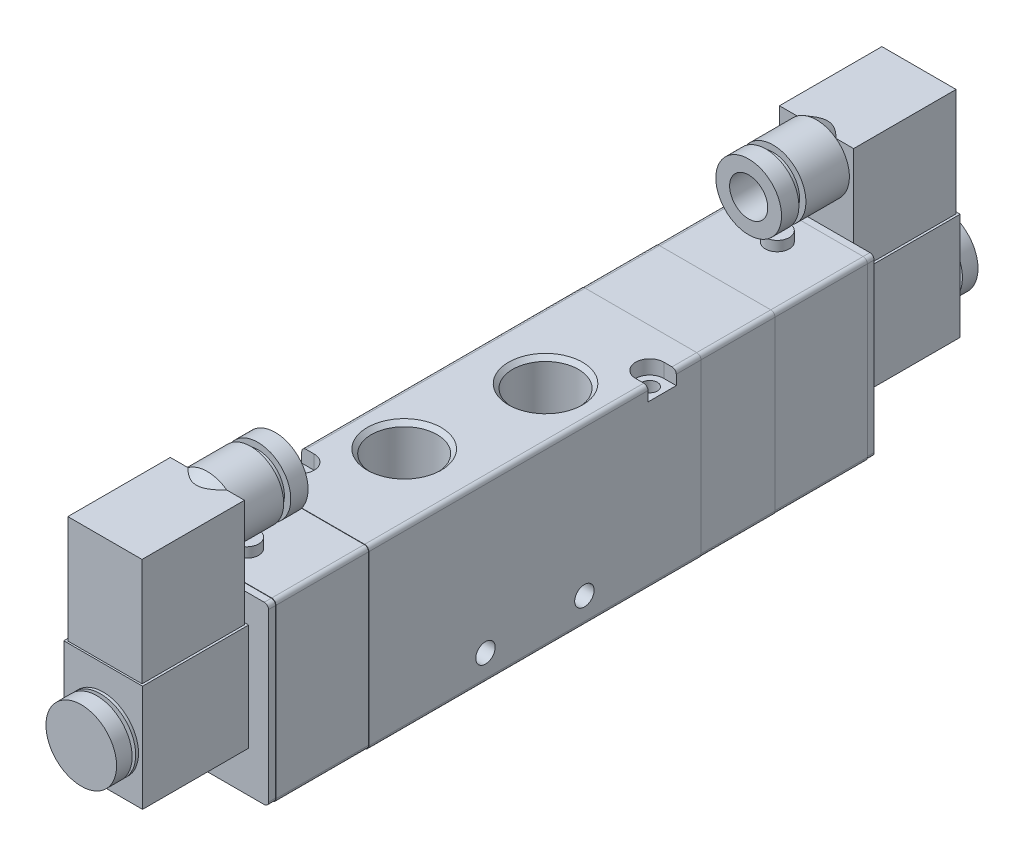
ISO-10303-21;
HEADER;
FILE_DESCRIPTION(('STEP AP214'),'2;1');
FILE_NAME('part.step','',(''),(''),'','','');
FILE_SCHEMA(('AUTOMOTIVE_DESIGN { 1 0 10303 214 1 1 1 1 }'));
ENDSEC;
DATA;
#1=APPLICATION_CONTEXT('core data for automotive mechanical design processes');
#2=APPLICATION_PROTOCOL_DEFINITION('international standard','automotive_design',2000,#1);
#3=PRODUCT_CONTEXT('',#1,'mechanical');
#4=PRODUCT('Part','Part','',(#3));
#5=PRODUCT_RELATED_PRODUCT_CATEGORY('part','',(#4));
#6=PRODUCT_DEFINITION_FORMATION('','',#4);
#7=PRODUCT_DEFINITION_CONTEXT('part definition',#1,'design');
#8=PRODUCT_DEFINITION('design','',#6,#7);
#9=PRODUCT_DEFINITION_SHAPE('','',#8);
#10=(LENGTH_UNIT() NAMED_UNIT(*) SI_UNIT(.MILLI.,.METRE.));
#11=(NAMED_UNIT(*) PLANE_ANGLE_UNIT() SI_UNIT($,.RADIAN.));
#12=(NAMED_UNIT(*) SI_UNIT($,.STERADIAN.) SOLID_ANGLE_UNIT());
#13=UNCERTAINTY_MEASURE_WITH_UNIT(LENGTH_MEASURE(1.E-05),#10,'distance_accuracy_value','');
#14=(GEOMETRIC_REPRESENTATION_CONTEXT(3) GLOBAL_UNCERTAINTY_ASSIGNED_CONTEXT((#13)) GLOBAL_UNIT_ASSIGNED_CONTEXT((#10,
#11,#12)) REPRESENTATION_CONTEXT('',''));
#15=CARTESIAN_POINT('',(0.,0.,0.));
#16=DIRECTION('',(0.,0.,1.));
#17=DIRECTION('',(1.,0.,0.));
#18=AXIS2_PLACEMENT_3D('',#15,#16,#17);
#19=CARTESIAN_POINT('',(0.,47.5,0.));
#20=DIRECTION('',(0.,1.,0.));
#21=DIRECTION('',(0.,0.,1.));
#22=AXIS2_PLACEMENT_3D('',#19,#20,#21);
#23=PLANE('',#22);
#24=DIRECTION('',(1.,0.,0.));
#25=VECTOR('',#24,1.);
#26=CARTESIAN_POINT('',(-10.5,47.5,-143.7));
#27=LINE('',#26,#25);
#28=CARTESIAN_POINT('',(-10.5,47.5,-143.7));
#29=VERTEX_POINT('',#28);
#30=CARTESIAN_POINT('',(-5.49909083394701,47.5,-143.7));
#31=VERTEX_POINT('',#30);
#32=EDGE_CURVE('E524',#29,#31,#27,.T.);
#33=ORIENTED_EDGE('',*,*,#32,.T.);
#34=CARTESIAN_POINT('',(-12.5563156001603,47.5,-134.47561932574));
#35=CARTESIAN_POINT('',(-12.2854300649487,47.5,-134.878349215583));
#36=CARTESIAN_POINT('',(-12.0130171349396,47.5,-135.280062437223));
#37=CARTESIAN_POINT('',(-11.4643400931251,47.5,-136.080938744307));
#38=CARTESIAN_POINT('',(-11.1880753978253,47.5,-136.480101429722));
#39=CARTESIAN_POINT('',(-10.6291432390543,47.5,-137.277859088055));
#40=CARTESIAN_POINT('',(-10.346445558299,47.5,-137.676432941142));
#41=CARTESIAN_POINT('',(-9.77538003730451,47.5,-138.469451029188));
#42=CARTESIAN_POINT('',(-9.48701267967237,47.5,-138.863895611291));
#43=CARTESIAN_POINT('',(-8.87729720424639,47.5,-139.682275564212));
#44=CARTESIAN_POINT('',(-8.55529204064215,47.5,-140.105724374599));
#45=CARTESIAN_POINT('',(-8.06402593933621,47.5,-140.73454951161));
#46=CARTESIAN_POINT('',(-7.89886739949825,47.5,-140.94313237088));
#47=CARTESIAN_POINT('',(-7.56538226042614,47.5,-141.357746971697));
#48=CARTESIAN_POINT('',(-7.39705573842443,47.5,-141.563778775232));
#49=CARTESIAN_POINT('',(-7.05722917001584,47.5,-141.972190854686));
#50=CARTESIAN_POINT('',(-6.88573989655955,47.5,-142.17458007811));
#51=CARTESIAN_POINT('',(-6.5385042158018,47.5,-142.575664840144));
#52=CARTESIAN_POINT('',(-6.36275803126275,47.5,-142.774360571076));
#53=CARTESIAN_POINT('',(-6.00633605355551,47.5,-143.167113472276));
#54=CARTESIAN_POINT('',(-5.82566273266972,47.5,-143.361172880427));
#55=CARTESIAN_POINT('',(-5.45839728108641,47.5,-143.743589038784));
#56=CARTESIAN_POINT('',(-5.27180601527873,47.5,-143.931946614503));
#57=CARTESIAN_POINT('',(-4.98033698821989,47.5,-144.215118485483));
#58=CARTESIAN_POINT('',(-4.87799114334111,47.5,-144.312540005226));
#59=CARTESIAN_POINT('',(-4.6710799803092,47.5,-144.504996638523));
#60=CARTESIAN_POINT('',(-4.56651462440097,47.5,-144.600031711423));
#61=CARTESIAN_POINT('',(-4.24903294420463,47.5,-144.881141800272));
#62=CARTESIAN_POINT('',(-4.03243258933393,47.5,-145.063121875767));
#63=CARTESIAN_POINT('',(-3.58974847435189,47.5,-145.410392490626));
#64=CARTESIAN_POINT('',(-3.36378522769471,47.5,-145.575835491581));
#65=CARTESIAN_POINT('',(-2.89832485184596,47.5,-145.886409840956));
#66=CARTESIAN_POINT('',(-2.65884314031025,47.5,-146.031563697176));
#67=CARTESIAN_POINT('',(-2.28848075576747,47.5,-146.227932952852));
#68=CARTESIAN_POINT('',(-2.16323404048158,47.5,-146.289804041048));
#69=CARTESIAN_POINT('',(-1.90892978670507,47.5,-146.405205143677));
#70=CARTESIAN_POINT('',(-1.7798725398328,47.5,-146.458735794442));
#71=CARTESIAN_POINT('',(-1.51822353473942,47.5,-146.556049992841));
#72=CARTESIAN_POINT('',(-1.38563471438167,47.5,-146.599841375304));
#73=CARTESIAN_POINT('',(-1.11730284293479,47.5,-146.676332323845));
#74=CARTESIAN_POINT('',(-0.981560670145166,47.5,-146.709034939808));
#75=CARTESIAN_POINT('',(-0.705986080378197,47.5,-146.762446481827));
#76=CARTESIAN_POINT('',(-0.566123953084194,47.5,-146.783003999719));
#77=CARTESIAN_POINT('',(-0.285066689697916,47.5,-146.810582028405));
#78=CARTESIAN_POINT('',(-0.143871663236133,47.5,-146.817603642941));
#79=CARTESIAN_POINT('',(0.138470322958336,47.5,-146.817777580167));
#80=CARTESIAN_POINT('',(0.279617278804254,47.5,-146.810935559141));
#81=CARTESIAN_POINT('',(0.560597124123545,47.5,-146.783720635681));
#82=CARTESIAN_POINT('',(0.700429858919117,47.5,-146.763346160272));
#83=CARTESIAN_POINT('',(0.990854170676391,47.5,-146.707420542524));
#84=CARTESIAN_POINT('',(1.14120133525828,47.5,-146.670608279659));
#85=CARTESIAN_POINT('',(1.43795611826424,47.5,-146.583515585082));
#86=CARTESIAN_POINT('',(1.5843620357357,47.5,-146.533229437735));
#87=CARTESIAN_POINT('',(1.8729789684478,47.5,-146.420964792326));
#88=CARTESIAN_POINT('',(2.01517907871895,47.5,-146.358958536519));
#89=CARTESIAN_POINT('',(2.2948663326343,47.5,-146.225178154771));
#90=CARTESIAN_POINT('',(2.43235339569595,47.5,-146.153403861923));
#91=CARTESIAN_POINT('',(2.72253274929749,47.5,-145.990619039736));
#92=CARTESIAN_POINT('',(2.87450445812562,47.5,-145.898330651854));
#93=CARTESIAN_POINT('',(3.17287040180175,47.5,-145.705098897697));
#94=CARTESIAN_POINT('',(3.31926260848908,47.5,-145.604152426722));
#95=CARTESIAN_POINT('',(3.60713919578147,47.5,-145.395124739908));
#96=CARTESIAN_POINT('',(3.74861658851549,47.5,-145.287033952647));
#97=CARTESIAN_POINT('',(4.02700910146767,47.5,-145.065121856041));
#98=CARTESIAN_POINT('',(4.16392366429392,47.5,-144.951299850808));
#99=CARTESIAN_POINT('',(4.43548048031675,47.5,-144.717403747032));
#100=CARTESIAN_POINT('',(4.5700682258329,47.5,-144.597266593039));
#101=CARTESIAN_POINT('',(4.83555082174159,47.5,-144.352985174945));
#102=CARTESIAN_POINT('',(4.96644557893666,47.5,-144.228840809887));
#103=CARTESIAN_POINT('',(5.22484154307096,47.5,-143.977321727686));
#104=CARTESIAN_POINT('',(5.35234588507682,47.5,-143.849950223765));
#105=CARTESIAN_POINT('',(5.60445038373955,47.5,-143.592383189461));
#106=CARTESIAN_POINT('',(5.72905066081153,47.5,-143.462187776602));
#107=CARTESIAN_POINT('',(6.13566200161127,47.5,-143.028953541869));
#108=CARTESIAN_POINT('',(6.41220633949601,47.5,-142.720777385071));
#109=CARTESIAN_POINT('',(6.95490719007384,47.5,-142.095379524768));
#110=CARTESIAN_POINT('',(7.22106139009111,47.5,-141.778155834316));
#111=CARTESIAN_POINT('',(7.74534184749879,47.5,-141.136767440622));
#112=CARTESIAN_POINT('',(8.00346197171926,47.5,-140.812597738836));
#113=CARTESIAN_POINT('',(8.51308347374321,47.5,-140.15915803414));
#114=CARTESIAN_POINT('',(8.76458539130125,47.5,-139.829888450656));
#115=CARTESIAN_POINT('',(9.26309460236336,47.5,-139.16616625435));
#116=CARTESIAN_POINT('',(9.51008305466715,47.5,-138.831699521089));
#117=CARTESIAN_POINT('',(9.9996083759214,47.5,-138.159521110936));
#118=CARTESIAN_POINT('',(10.2421451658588,47.5,-137.82180937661));
#119=CARTESIAN_POINT('',(10.7233981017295,47.5,-137.143893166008));
#120=CARTESIAN_POINT('',(10.9621158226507,47.5,-136.803689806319));
#121=CARTESIAN_POINT('',(11.4364144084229,47.5,-136.1211019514));
#122=CARTESIAN_POINT('',(11.6719952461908,47.5,-135.778717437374));
#123=CARTESIAN_POINT('',(12.3180915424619,47.5,-134.831861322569));
#124=CARTESIAN_POINT('',(12.7258225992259,47.5,-134.225489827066));
#125=CARTESIAN_POINT('',(13.5350009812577,47.5,-133.008477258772));
#126=CARTESIAN_POINT('',(13.9364475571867,47.5,-132.397835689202));
#127=CARTESIAN_POINT('',(14.731625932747,47.5,-131.177473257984));
#128=CARTESIAN_POINT('',(15.1253916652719,47.5,-130.567774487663));
#129=CARTESIAN_POINT('',(15.7130348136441,47.5,-129.651370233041));
#130=CARTESIAN_POINT('',(15.9083997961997,47.5,-129.345616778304));
#131=CARTESIAN_POINT('',(16.2982305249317,47.5,-128.733538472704));
#132=CARTESIAN_POINT('',(16.4926962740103,47.5,-128.427213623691));
#133=CARTESIAN_POINT('',(16.6867590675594,47.5,-128.120633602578));
#134=B_SPLINE_CURVE_WITH_KNOTS('',3,(#34,#35,#36,#37,#38,#39,#40,#41,#42,#43,#44,#45,#46,#47,
#48,#49,#50,#51,#52,#53,#54,#55,#56,#57,#58,#59,#60,#61,#62,#63,#64,#65,#66,#67,#68,#69,#70,#71,
#72,#73,#74,#75,#76,#77,#78,#79,#80,#81,#82,#83,#84,#85,#86,#87,#88,#89,#90,#91,#92,#93,#94,#95,
#96,#97,#98,#99,#100,#101,#102,#103,#104,#105,#106,#107,#108,#109,#110,#111,#112,#113,#114,#115,
#116,#117,#118,#119,#120,#121,#122,#123,#124,#125,#126,#127,#128,#129,#130,#131,#132,#133),
.UNSPECIFIED.,.F.,.F.,(4,2,2,2,2,2,2,2,2,2,2,2,2,2,2,2,2,2,2,2,2,2,2,2,2,2,2,2,2,2,2,2,2,2,2,2,
2,2,2,2,2,2,2,2,2,2,2,2,2,4),(0.,1.45607721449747,2.91237745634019,4.37828563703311,
5.84406957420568,7.43983326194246,8.23796766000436,9.03608262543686,9.83185346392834,
10.6275827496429,11.422919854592,12.2181412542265,12.6420061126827,13.065878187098,
13.9140491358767,14.7534927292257,15.5919975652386,16.0108400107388,16.4296504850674,
16.8481228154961,17.266479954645,17.6899481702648,18.1133818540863,18.5366428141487,
18.9599529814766,19.423598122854,19.8874402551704,20.3523950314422,20.8173577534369,
21.3503886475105,21.8836114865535,22.417563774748,22.9515810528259,23.4927068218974,
24.0338462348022,24.5744665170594,25.1150643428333,26.3568984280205,27.5990073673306,
28.8420423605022,30.0849756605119,31.3322650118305,32.5795764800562,33.8263595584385,
35.0731533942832,37.26521245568,39.4575309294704,41.6349072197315,42.7234251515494,
43.811939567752),.UNSPECIFIED.);
#135=CARTESIAN_POINT('',(5.49909083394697,47.5,-143.7));
#136=VERTEX_POINT('',#135);
#137=EDGE_CURVE('E45',#31,#136,#134,.T.);
#138=ORIENTED_EDGE('',*,*,#137,.T.);
#139=CARTESIAN_POINT('',(10.5,47.5,-143.7));
#140=VERTEX_POINT('',#139);
#141=EDGE_CURVE('E526',#136,#140,#27,.T.);
#142=ORIENTED_EDGE('',*,*,#141,.T.);
#143=DIRECTION('',(0.,0.,-1.));
#144=VECTOR('',#143,1.);
#145=CARTESIAN_POINT('',(10.5,47.5,-143.7));
#146=LINE('',#145,#144);
#147=CARTESIAN_POINT('',(10.5,47.5,-172.7));
#148=VERTEX_POINT('',#147);
#149=EDGE_CURVE('E530',#140,#148,#146,.T.);
#150=ORIENTED_EDGE('',*,*,#149,.T.);
#151=DIRECTION('',(-1.,0.,0.));
#152=VECTOR('',#151,1.);
#153=CARTESIAN_POINT('',(10.5,47.5,-172.7));
#154=LINE('',#153,#152);
#155=CARTESIAN_POINT('',(-10.5,47.5,-172.7));
#156=VERTEX_POINT('',#155);
#157=EDGE_CURVE('E1558',#148,#156,#154,.T.);
#158=ORIENTED_EDGE('',*,*,#157,.T.);
#159=DIRECTION('',(0.,0.,1.));
#160=VECTOR('',#159,1.);
#161=CARTESIAN_POINT('',(-10.5,47.5,-172.7));
#162=LINE('',#161,#160);
#163=EDGE_CURVE('E528',#156,#29,#162,.T.);
#164=ORIENTED_EDGE('',*,*,#163,.T.);
#165=EDGE_LOOP('',(#33,#138,#142,#150,#158,#164));
#166=FACE_BOUND('',#165,.T.);
#167=ADVANCED_FACE('F37',(#166),#23,.T.);
#168=CARTESIAN_POINT('',(11.15,17.,-173.2));
#169=DIRECTION('',(0.,-1.,0.));
#170=DIRECTION('',(0.,0.,-1.));
#171=AXIS2_PLACEMENT_3D('',#168,#169,#170);
#172=PLANE('',#171);
#173=DIRECTION('',(-1.,0.,0.));
#174=VECTOR('',#173,1.);
#175=CARTESIAN_POINT('',(11.15,17.,-173.2));
#176=LINE('',#175,#174);
#177=CARTESIAN_POINT('',(11.15,17.,-173.2));
#178=VERTEX_POINT('',#177);
#179=CARTESIAN_POINT('',(-11.15,17.,-173.2));
#180=VERTEX_POINT('',#179);
#181=EDGE_CURVE('E583',#178,#180,#176,.T.);
#182=ORIENTED_EDGE('',*,*,#181,.T.);
#183=DIRECTION('',(0.,0.,1.));
#184=VECTOR('',#183,1.);
#185=CARTESIAN_POINT('',(-11.15,17.,-173.2));
#186=LINE('',#185,#184);
#187=CARTESIAN_POINT('',(-11.15,17.,-143.2));
#188=VERTEX_POINT('',#187);
#189=EDGE_CURVE('E562',#180,#188,#186,.T.);
#190=ORIENTED_EDGE('',*,*,#189,.T.);
#191=DIRECTION('',(-1.,0.,0.));
#192=VECTOR('',#191,1.);
#193=CARTESIAN_POINT('',(11.15,17.,-143.2));
#194=LINE('',#193,#192);
#195=CARTESIAN_POINT('',(11.15,17.,-143.2));
#196=VERTEX_POINT('',#195);
#197=EDGE_CURVE('E590',#196,#188,#194,.T.);
#198=ORIENTED_EDGE('',*,*,#197,.F.);
#199=DIRECTION('',(0.,0.,1.));
#200=VECTOR('',#199,1.);
#201=CARTESIAN_POINT('',(11.15,17.,-173.2));
#202=LINE('',#201,#200);
#203=EDGE_CURVE('E573',#178,#196,#202,.T.);
#204=ORIENTED_EDGE('',*,*,#203,.F.);
#205=EDGE_LOOP('',(#182,#190,#198,#204));
#206=FACE_BOUND('',#205,.T.);
#207=DIRECTION('',(-1.,0.,0.));
#208=VECTOR('',#207,1.);
#209=CARTESIAN_POINT('',(11.15,17.,-172.7));
#210=LINE('',#209,#208);
#211=CARTESIAN_POINT('',(10.5,17.,-172.7));
#212=VERTEX_POINT('',#211);
#213=CARTESIAN_POINT('',(-10.5,17.,-172.7));
#214=VERTEX_POINT('',#213);
#215=EDGE_CURVE('E512',#212,#214,#210,.T.);
#216=ORIENTED_EDGE('',*,*,#215,.F.);
#217=DIRECTION('',(0.,0.,-1.));
#218=VECTOR('',#217,1.);
#219=CARTESIAN_POINT('',(10.5,17.,-173.2));
#220=LINE('',#219,#218);
#221=CARTESIAN_POINT('',(10.5,17.,-143.7));
#222=VERTEX_POINT('',#221);
#223=EDGE_CURVE('E1590',#222,#212,#220,.T.);
#224=ORIENTED_EDGE('',*,*,#223,.F.);
#225=DIRECTION('',(1.,0.,0.));
#226=VECTOR('',#225,1.);
#227=CARTESIAN_POINT('',(11.15,17.,-143.7));
#228=LINE('',#227,#226);
#229=CARTESIAN_POINT('',(-10.5,17.,-143.7));
#230=VERTEX_POINT('',#229);
#231=EDGE_CURVE('E1589',#230,#222,#228,.T.);
#232=ORIENTED_EDGE('',*,*,#231,.F.);
#233=DIRECTION('',(0.,0.,1.));
#234=VECTOR('',#233,1.);
#235=CARTESIAN_POINT('',(-10.5,17.,-173.2));
#236=LINE('',#235,#234);
#237=EDGE_CURVE('E59',#214,#230,#236,.T.);
#238=ORIENTED_EDGE('',*,*,#237,.F.);
#239=EDGE_LOOP('',(#216,#224,#232,#238));
#240=FACE_BOUND('',#239,.T.);
#241=ADVANCED_FACE('F1212',(#206,#240),#172,.F.);
#242=CARTESIAN_POINT('',(0.,47.5,0.));
#243=DIRECTION('',(0.,1.,0.));
#244=DIRECTION('',(0.,0.,1.));
#245=AXIS2_PLACEMENT_3D('',#242,#243,#244);
#246=PLANE('',#245);
#247=DIRECTION('',(-1.,0.,0.));
#248=VECTOR('',#247,1.);
#249=CARTESIAN_POINT('',(10.5,47.5,28.7));
#250=LINE('',#249,#248);
#251=CARTESIAN_POINT('',(10.5,47.5,28.7));
#252=VERTEX_POINT('',#251);
#253=CARTESIAN_POINT('',(5.499090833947,47.5,28.7));
#254=VERTEX_POINT('',#253);
#255=EDGE_CURVE('E780',#252,#254,#250,.T.);
#256=ORIENTED_EDGE('',*,*,#255,.T.);
#257=CARTESIAN_POINT('',(-12.5563156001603,47.5,19.4756193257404));
#258=CARTESIAN_POINT('',(-12.2854300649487,47.5,19.8783492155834));
#259=CARTESIAN_POINT('',(-12.0130171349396,47.5,20.2800624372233));
#260=CARTESIAN_POINT('',(-11.4643400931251,47.5,21.0809387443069));
#261=CARTESIAN_POINT('',(-11.1880753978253,47.5,21.4801014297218));
#262=CARTESIAN_POINT('',(-10.6291432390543,47.5,22.2778590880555));
#263=CARTESIAN_POINT('',(-10.346445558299,47.5,22.6764329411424));
#264=CARTESIAN_POINT('',(-9.77538003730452,47.5,23.4694510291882));
#265=CARTESIAN_POINT('',(-9.48701267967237,47.5,23.8638956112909));
#266=CARTESIAN_POINT('',(-8.87729720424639,47.5,24.6822755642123));
#267=CARTESIAN_POINT('',(-8.55529204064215,47.5,25.1057243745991));
#268=CARTESIAN_POINT('',(-8.06402593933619,47.5,25.7345495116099));
#269=CARTESIAN_POINT('',(-7.89886739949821,47.5,25.9431323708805));
#270=CARTESIAN_POINT('',(-7.5653822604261,47.5,26.3577469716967));
#271=CARTESIAN_POINT('',(-7.3970557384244,47.5,26.5637787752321));
#272=CARTESIAN_POINT('',(-7.05722917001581,47.5,26.9721908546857));
#273=CARTESIAN_POINT('',(-6.88573989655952,47.5,27.1745800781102));
#274=CARTESIAN_POINT('',(-6.53850421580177,47.5,27.5756648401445));
#275=CARTESIAN_POINT('',(-6.36275803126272,47.5,27.7743605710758));
#276=CARTESIAN_POINT('',(-6.00633605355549,47.5,28.167113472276));
#277=CARTESIAN_POINT('',(-5.82566273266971,47.5,28.3611728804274));
#278=CARTESIAN_POINT('',(-5.45839728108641,47.5,28.7435890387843));
#279=CARTESIAN_POINT('',(-5.27180601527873,47.5,28.931946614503));
#280=CARTESIAN_POINT('',(-4.98033698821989,47.5,29.2151184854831));
#281=CARTESIAN_POINT('',(-4.87799114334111,47.5,29.3125400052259));
#282=CARTESIAN_POINT('',(-4.67107998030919,47.5,29.5049966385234));
#283=CARTESIAN_POINT('',(-4.56651462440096,47.5,29.6000317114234));
#284=CARTESIAN_POINT('',(-4.24903294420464,47.5,29.8811418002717));
#285=CARTESIAN_POINT('',(-4.03243258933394,47.5,30.0631218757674));
#286=CARTESIAN_POINT('',(-3.5897484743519,47.5,30.4103924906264));
#287=CARTESIAN_POINT('',(-3.36378522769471,47.5,30.5758354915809));
#288=CARTESIAN_POINT('',(-2.89832485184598,47.5,30.8864098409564));
#289=CARTESIAN_POINT('',(-2.65884314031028,47.5,31.031563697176));
#290=CARTESIAN_POINT('',(-2.28848075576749,47.5,31.2279329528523));
#291=CARTESIAN_POINT('',(-2.1632340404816,47.5,31.2898040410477));
#292=CARTESIAN_POINT('',(-1.90892978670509,47.5,31.4052051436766));
#293=CARTESIAN_POINT('',(-1.77987253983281,47.5,31.4587357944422));
#294=CARTESIAN_POINT('',(-1.51822353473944,47.5,31.5560499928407));
#295=CARTESIAN_POINT('',(-1.38563471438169,47.5,31.5998413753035));
#296=CARTESIAN_POINT('',(-1.11730284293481,47.5,31.676332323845));
#297=CARTESIAN_POINT('',(-0.981560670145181,47.5,31.7090349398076));
#298=CARTESIAN_POINT('',(-0.705986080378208,47.5,31.7624464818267));
#299=CARTESIAN_POINT('',(-0.566123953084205,47.5,31.7830039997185));
#300=CARTESIAN_POINT('',(-0.285066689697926,47.5,31.8105820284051));
#301=CARTESIAN_POINT('',(-0.143871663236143,47.5,31.817603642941));
#302=CARTESIAN_POINT('',(0.138470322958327,47.5,31.8177775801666));
#303=CARTESIAN_POINT('',(0.279617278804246,47.5,31.8109355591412));
#304=CARTESIAN_POINT('',(0.560597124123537,47.5,31.7837206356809));
#305=CARTESIAN_POINT('',(0.70042985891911,47.5,31.7633461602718));
#306=CARTESIAN_POINT('',(0.99085417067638,47.5,31.7074205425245));
#307=CARTESIAN_POINT('',(1.14120133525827,47.5,31.6706082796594));
#308=CARTESIAN_POINT('',(1.43795611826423,47.5,31.5835155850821));
#309=CARTESIAN_POINT('',(1.58436203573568,47.5,31.5332294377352));
#310=CARTESIAN_POINT('',(1.87297896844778,47.5,31.4209647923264));
#311=CARTESIAN_POINT('',(2.01517907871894,47.5,31.3589585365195));
#312=CARTESIAN_POINT('',(2.29486633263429,47.5,31.2251781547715));
#313=CARTESIAN_POINT('',(2.43235339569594,47.5,31.1534038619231));
#314=CARTESIAN_POINT('',(2.72253274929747,47.5,30.9906190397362));
#315=CARTESIAN_POINT('',(2.87450445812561,47.5,30.8983306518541));
#316=CARTESIAN_POINT('',(3.17287040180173,47.5,30.7050988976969));
#317=CARTESIAN_POINT('',(3.31926260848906,47.5,30.6041524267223));
#318=CARTESIAN_POINT('',(3.60713919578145,47.5,30.3951247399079));
#319=CARTESIAN_POINT('',(3.74861658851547,47.5,30.2870339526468));
#320=CARTESIAN_POINT('',(4.02700910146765,47.5,30.065121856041));
#321=CARTESIAN_POINT('',(4.1639236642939,47.5,29.9512998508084));
#322=CARTESIAN_POINT('',(4.43548048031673,47.5,29.7174037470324));
#323=CARTESIAN_POINT('',(4.57006822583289,47.5,29.5972665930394));
#324=CARTESIAN_POINT('',(4.83555082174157,47.5,29.3529851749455));
#325=CARTESIAN_POINT('',(4.96644557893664,47.5,29.2288408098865));
#326=CARTESIAN_POINT('',(5.22484154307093,47.5,28.9773217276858));
#327=CARTESIAN_POINT('',(5.35234588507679,47.5,28.8499502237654));
#328=CARTESIAN_POINT('',(5.60445038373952,47.5,28.5923831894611));
#329=CARTESIAN_POINT('',(5.7290506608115,47.5,28.4621877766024));
#330=CARTESIAN_POINT('',(6.13566200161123,47.5,28.0289535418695));
#331=CARTESIAN_POINT('',(6.41220633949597,47.5,27.7207773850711));
#332=CARTESIAN_POINT('',(6.95490719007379,47.5,27.0953795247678));
#333=CARTESIAN_POINT('',(7.22106139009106,47.5,26.778155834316));
#334=CARTESIAN_POINT('',(7.74534184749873,47.5,26.1367674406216));
#335=CARTESIAN_POINT('',(8.00346197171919,47.5,25.8125977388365));
#336=CARTESIAN_POINT('',(8.51308347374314,47.5,25.1591580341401));
#337=CARTESIAN_POINT('',(8.76458539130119,47.5,24.829888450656));
#338=CARTESIAN_POINT('',(9.2630946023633,47.5,24.1661662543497));
#339=CARTESIAN_POINT('',(9.51008305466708,47.5,23.8316995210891));
#340=CARTESIAN_POINT('',(9.99960837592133,47.5,23.1595211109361));
#341=CARTESIAN_POINT('',(10.2421451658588,47.5,22.8218093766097));
#342=CARTESIAN_POINT('',(10.7233981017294,47.5,22.1438931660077));
#343=CARTESIAN_POINT('',(10.9621158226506,47.5,21.8036898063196));
#344=CARTESIAN_POINT('',(11.4364144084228,47.5,21.1211019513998));
#345=CARTESIAN_POINT('',(11.6719952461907,47.5,20.7787174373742));
#346=CARTESIAN_POINT('',(12.3180915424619,47.5,19.8318613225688));
#347=CARTESIAN_POINT('',(12.7258225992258,47.5,19.2254898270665));
#348=CARTESIAN_POINT('',(13.5350009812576,47.5,18.008477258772));
#349=CARTESIAN_POINT('',(13.9364475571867,47.5,17.3978356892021));
#350=CARTESIAN_POINT('',(14.7316259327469,47.5,16.1774732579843));
#351=CARTESIAN_POINT('',(15.1253916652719,47.5,15.5677744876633));
#352=CARTESIAN_POINT('',(15.713034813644,47.5,14.6513702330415));
#353=CARTESIAN_POINT('',(15.9083997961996,47.5,14.3456167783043));
#354=CARTESIAN_POINT('',(16.2982305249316,47.5,13.7335384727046));
#355=CARTESIAN_POINT('',(16.4926962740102,47.5,13.4272136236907));
#356=CARTESIAN_POINT('',(16.6867590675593,47.5,13.1206336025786));
#357=B_SPLINE_CURVE_WITH_KNOTS('',3,(#257,#258,#259,#260,#261,#262,#263,#264,#265,#266,#267,
#268,#269,#270,#271,#272,#273,#274,#275,#276,#277,#278,#279,#280,#281,#282,#283,#284,#285,#286,
#287,#288,#289,#290,#291,#292,#293,#294,#295,#296,#297,#298,#299,#300,#301,#302,#303,#304,#305,
#306,#307,#308,#309,#310,#311,#312,#313,#314,#315,#316,#317,#318,#319,#320,#321,#322,#323,#324,
#325,#326,#327,#328,#329,#330,#331,#332,#333,#334,#335,#336,#337,#338,#339,#340,#341,#342,#343,
#344,#345,#346,#347,#348,#349,#350,#351,#352,#353,#354,#355,#356),.UNSPECIFIED.,.F.,.F.,(4,2,2,
2,2,2,2,2,2,2,2,2,2,2,2,2,2,2,2,2,2,2,2,2,2,2,2,2,2,2,2,2,2,2,2,2,2,2,2,2,2,2,2,2,2,2,2,2,2,4),
(0.,1.45607721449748,2.9123774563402,4.37828563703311,5.84406957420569,7.43983326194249,
8.23796766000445,9.03608262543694,9.83185346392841,10.6275827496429,11.422919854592,
12.2181412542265,12.6420061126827,13.065878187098,13.9140491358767,14.7534927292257,
15.5919975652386,16.0108400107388,16.4296504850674,16.8481228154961,17.266479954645,
17.6899481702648,18.1133818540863,18.5366428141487,18.9599529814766,19.423598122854,
19.8874402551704,20.3523950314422,20.8173577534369,21.3503886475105,21.8836114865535,
22.417563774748,22.9515810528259,23.4927068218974,24.0338462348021,24.5744665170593,
25.1150643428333,26.3568984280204,27.5990073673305,28.8420423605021,30.0849756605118,
31.3322650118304,32.579576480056,33.8263595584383,35.0731533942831,37.2652124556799,
39.4575309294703,41.6349072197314,42.7234251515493,43.8119395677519),.UNSPECIFIED.);
#358=CARTESIAN_POINT('',(-5.49909083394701,47.5,28.7));
#359=VERTEX_POINT('',#358);
#360=EDGE_CURVE('E1192',#254,#359,#357,.F.);
#361=ORIENTED_EDGE('',*,*,#360,.T.);
#362=CARTESIAN_POINT('',(-10.5,47.5,28.7));
#363=VERTEX_POINT('',#362);
#364=EDGE_CURVE('E779',#359,#363,#250,.T.);
#365=ORIENTED_EDGE('',*,*,#364,.T.);
#366=DIRECTION('',(0.,0.,1.));
#367=VECTOR('',#366,1.);
#368=CARTESIAN_POINT('',(-10.5,47.5,28.7));
#369=LINE('',#368,#367);
#370=CARTESIAN_POINT('',(-10.5,47.5,57.7));
#371=VERTEX_POINT('',#370);
#372=EDGE_CURVE('E783',#363,#371,#369,.T.);
#373=ORIENTED_EDGE('',*,*,#372,.T.);
#374=DIRECTION('',(1.,0.,0.));
#375=VECTOR('',#374,1.);
#376=CARTESIAN_POINT('',(-10.5,47.5,57.7));
#377=LINE('',#376,#375);
#378=CARTESIAN_POINT('',(10.5,47.5,57.7));
#379=VERTEX_POINT('',#378);
#380=EDGE_CURVE('E785',#371,#379,#377,.T.);
#381=ORIENTED_EDGE('',*,*,#380,.T.);
#382=DIRECTION('',(0.,0.,-1.));
#383=VECTOR('',#382,1.);
#384=CARTESIAN_POINT('',(10.5,47.5,57.7));
#385=LINE('',#384,#383);
#386=EDGE_CURVE('E787',#379,#252,#385,.T.);
#387=ORIENTED_EDGE('',*,*,#386,.T.);
#388=EDGE_LOOP('',(#256,#361,#365,#373,#381,#387));
#389=FACE_BOUND('',#388,.T.);
#390=ADVANCED_FACE('F1206',(#389),#246,.T.);
#391=CARTESIAN_POINT('',(11.15,17.,28.2));
#392=DIRECTION('',(0.,-1.,0.));
#393=DIRECTION('',(0.,0.,-1.));
#394=AXIS2_PLACEMENT_3D('',#391,#392,#393);
#395=PLANE('',#394);
#396=DIRECTION('',(-1.,0.,0.));
#397=VECTOR('',#396,1.);
#398=CARTESIAN_POINT('',(11.15,17.,28.2));
#399=LINE('',#398,#397);
#400=CARTESIAN_POINT('',(11.15,17.,28.2));
#401=VERTEX_POINT('',#400);
#402=CARTESIAN_POINT('',(-11.15,17.,28.2));
#403=VERTEX_POINT('',#402);
#404=EDGE_CURVE('E836',#401,#403,#399,.T.);
#405=ORIENTED_EDGE('',*,*,#404,.T.);
#406=DIRECTION('',(0.,0.,1.));
#407=VECTOR('',#406,1.);
#408=CARTESIAN_POINT('',(-11.15,17.,28.2));
#409=LINE('',#408,#407);
#410=CARTESIAN_POINT('',(-11.15,17.,58.2));
#411=VERTEX_POINT('',#410);
#412=EDGE_CURVE('E816',#403,#411,#409,.T.);
#413=ORIENTED_EDGE('',*,*,#412,.T.);
#414=DIRECTION('',(-1.,0.,0.));
#415=VECTOR('',#414,1.);
#416=CARTESIAN_POINT('',(11.15,17.,58.2));
#417=LINE('',#416,#415);
#418=CARTESIAN_POINT('',(11.15,17.,58.2));
#419=VERTEX_POINT('',#418);
#420=EDGE_CURVE('E844',#419,#411,#417,.T.);
#421=ORIENTED_EDGE('',*,*,#420,.F.);
#422=DIRECTION('',(0.,0.,1.));
#423=VECTOR('',#422,1.);
#424=CARTESIAN_POINT('',(11.15,17.,28.2));
#425=LINE('',#424,#423);
#426=EDGE_CURVE('E827',#401,#419,#425,.T.);
#427=ORIENTED_EDGE('',*,*,#426,.F.);
#428=EDGE_LOOP('',(#405,#413,#421,#427));
#429=FACE_BOUND('',#428,.T.);
#430=DIRECTION('',(-1.,0.,0.));
#431=VECTOR('',#430,1.);
#432=CARTESIAN_POINT('',(11.15,17.,28.7));
#433=LINE('',#432,#431);
#434=CARTESIAN_POINT('',(10.5,17.,28.7));
#435=VERTEX_POINT('',#434);
#436=CARTESIAN_POINT('',(-10.5,17.,28.7));
#437=VERTEX_POINT('',#436);
#438=EDGE_CURVE('E1189',#435,#437,#433,.T.);
#439=ORIENTED_EDGE('',*,*,#438,.F.);
#440=DIRECTION('',(0.,0.,-1.));
#441=VECTOR('',#440,1.);
#442=CARTESIAN_POINT('',(10.5,17.,28.2));
#443=LINE('',#442,#441);
#444=CARTESIAN_POINT('',(10.5,17.,57.7));
#445=VERTEX_POINT('',#444);
#446=EDGE_CURVE('E1180',#445,#435,#443,.T.);
#447=ORIENTED_EDGE('',*,*,#446,.F.);
#448=DIRECTION('',(1.,0.,0.));
#449=VECTOR('',#448,1.);
#450=CARTESIAN_POINT('',(11.15,17.,57.7));
#451=LINE('',#450,#449);
#452=CARTESIAN_POINT('',(-10.5,17.,57.7));
#453=VERTEX_POINT('',#452);
#454=EDGE_CURVE('E1183',#453,#445,#451,.T.);
#455=ORIENTED_EDGE('',*,*,#454,.F.);
#456=DIRECTION('',(0.,0.,1.));
#457=VECTOR('',#456,1.);
#458=CARTESIAN_POINT('',(-10.5,17.,28.2));
#459=LINE('',#458,#457);
#460=EDGE_CURVE('E1186',#437,#453,#459,.T.);
#461=ORIENTED_EDGE('',*,*,#460,.F.);
#462=EDGE_LOOP('',(#439,#447,#455,#461));
#463=FACE_BOUND('',#462,.T.);
#464=ADVANCED_FACE('F1211',(#429,#463),#395,.F.);
#465=CARTESIAN_POINT('',(-15.7,23.7,26.2));
#466=DIRECTION('',(0.,0.,1.));
#467=DIRECTION('',(1.,0.,0.));
#468=AXIS2_PLACEMENT_3D('',#465,#466,#467);
#469=PLANE('',#468);
#470=CARTESIAN_POINT('',(-15.7,23.7,26.2));
#471=DIRECTION('',(0.,0.,1.));
#472=DIRECTION('',(1.,0.,0.));
#473=AXIS2_PLACEMENT_3D('',#470,#471,#472);
#474=CIRCLE('',#473,1.20000000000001);
#475=CARTESIAN_POINT('',(-15.7,24.9,26.2));
#476=VERTEX_POINT('',#475);
#477=CARTESIAN_POINT('',(-16.9,23.7,26.2));
#478=VERTEX_POINT('',#477);
#479=EDGE_CURVE('E890',#476,#478,#474,.T.);
#480=ORIENTED_EDGE('',*,*,#479,.T.);
#481=DIRECTION('',(0.,-1.,0.));
#482=VECTOR('',#481,1.);
#483=CARTESIAN_POINT('',(-16.9,23.7,26.2));
#484=LINE('',#483,#482);
#485=CARTESIAN_POINT('',(-16.9,-23.7,26.2));
#486=VERTEX_POINT('',#485);
#487=EDGE_CURVE('E893',#478,#486,#484,.T.);
#488=ORIENTED_EDGE('',*,*,#487,.T.);
#489=CARTESIAN_POINT('',(-15.7,-23.7,26.2));
#490=DIRECTION('',(0.,0.,1.));
#491=DIRECTION('',(1.,0.,0.));
#492=AXIS2_PLACEMENT_3D('',#489,#490,#491);
#493=CIRCLE('',#492,1.20000000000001);
#494=CARTESIAN_POINT('',(-15.7,-24.9,26.2));
#495=VERTEX_POINT('',#494);
#496=EDGE_CURVE('E896',#486,#495,#493,.T.);
#497=ORIENTED_EDGE('',*,*,#496,.T.);
#498=DIRECTION('',(1.,0.,0.));
#499=VECTOR('',#498,1.);
#500=CARTESIAN_POINT('',(-15.7,-24.9,26.2));
#501=LINE('',#500,#499);
#502=CARTESIAN_POINT('',(15.7,-24.9,26.2));
#503=VERTEX_POINT('',#502);
#504=EDGE_CURVE('E898',#495,#503,#501,.T.);
#505=ORIENTED_EDGE('',*,*,#504,.T.);
#506=CARTESIAN_POINT('',(15.7,-23.7,26.2));
#507=DIRECTION('',(0.,0.,1.));
#508=DIRECTION('',(1.,0.,0.));
#509=AXIS2_PLACEMENT_3D('',#506,#507,#508);
#510=CIRCLE('',#509,1.2);
#511=CARTESIAN_POINT('',(16.9,-23.7,26.2));
#512=VERTEX_POINT('',#511);
#513=EDGE_CURVE('E900',#503,#512,#510,.T.);
#514=ORIENTED_EDGE('',*,*,#513,.T.);
#515=DIRECTION('',(0.,1.,0.));
#516=VECTOR('',#515,1.);
#517=CARTESIAN_POINT('',(16.9,-23.7,26.2));
#518=LINE('',#517,#516);
#519=CARTESIAN_POINT('',(16.9,23.7,26.2));
#520=VERTEX_POINT('',#519);
#521=EDGE_CURVE('E902',#512,#520,#518,.T.);
#522=ORIENTED_EDGE('',*,*,#521,.T.);
#523=CARTESIAN_POINT('',(15.7,23.7,26.2));
#524=DIRECTION('',(0.,0.,1.));
#525=DIRECTION('',(1.,0.,0.));
#526=AXIS2_PLACEMENT_3D('',#523,#524,#525);
#527=CIRCLE('',#526,1.2);
#528=CARTESIAN_POINT('',(15.7,24.9,26.2));
#529=VERTEX_POINT('',#528);
#530=EDGE_CURVE('E904',#520,#529,#527,.T.);
#531=ORIENTED_EDGE('',*,*,#530,.T.);
#532=DIRECTION('',(-1.,0.,0.));
#533=VECTOR('',#532,1.);
#534=CARTESIAN_POINT('',(15.7,24.9,26.2));
#535=LINE('',#534,#533);
#536=EDGE_CURVE('E906',#529,#476,#535,.T.);
#537=ORIENTED_EDGE('',*,*,#536,.T.);
#538=EDGE_LOOP('',(#480,#488,#497,#505,#514,#522,#531,#537));
#539=FACE_BOUND('',#538,.T.);
#540=DIRECTION('',(0.,1.,0.));
#541=VECTOR('',#540,1.);
#542=CARTESIAN_POINT('',(-16.8,23.7,26.2));
#543=LINE('',#542,#541);
#544=CARTESIAN_POINT('',(-16.8,-23.6,26.2));
#545=VERTEX_POINT('',#544);
#546=CARTESIAN_POINT('',(-16.8,23.6,26.2));
#547=VERTEX_POINT('',#546);
#548=EDGE_CURVE('E1171',#545,#547,#543,.T.);
#549=ORIENTED_EDGE('',*,*,#548,.T.);
#550=CARTESIAN_POINT('',(-15.6,23.6,26.2));
#551=DIRECTION('',(0.,0.,1.));
#552=DIRECTION('',(1.,0.,0.));
#553=AXIS2_PLACEMENT_3D('',#550,#551,#552);
#554=CIRCLE('',#553,1.2);
#555=CARTESIAN_POINT('',(-15.6,24.8,26.2));
#556=VERTEX_POINT('',#555);
#557=EDGE_CURVE('E1174',#547,#556,#554,.F.);
#558=ORIENTED_EDGE('',*,*,#557,.T.);
#559=DIRECTION('',(1.,0.,0.));
#560=VECTOR('',#559,1.);
#561=CARTESIAN_POINT('',(-15.7,24.8,26.2));
#562=LINE('',#561,#560);
#563=CARTESIAN_POINT('',(15.6,24.8,26.2));
#564=VERTEX_POINT('',#563);
#565=EDGE_CURVE('E1153',#556,#564,#562,.T.);
#566=ORIENTED_EDGE('',*,*,#565,.T.);
#567=CARTESIAN_POINT('',(15.6,23.6,26.2));
#568=DIRECTION('',(0.,0.,1.));
#569=DIRECTION('',(1.,0.,0.));
#570=AXIS2_PLACEMENT_3D('',#567,#568,#569);
#571=CIRCLE('',#570,1.2);
#572=CARTESIAN_POINT('',(16.8,23.6,26.2));
#573=VERTEX_POINT('',#572);
#574=EDGE_CURVE('E1156',#564,#573,#571,.F.);
#575=ORIENTED_EDGE('',*,*,#574,.T.);
#576=DIRECTION('',(0.,-1.,0.));
#577=VECTOR('',#576,1.);
#578=CARTESIAN_POINT('',(16.8,23.7,26.2));
#579=LINE('',#578,#577);
#580=CARTESIAN_POINT('',(16.8,-23.6,26.2));
#581=VERTEX_POINT('',#580);
#582=EDGE_CURVE('E1159',#573,#581,#579,.T.);
#583=ORIENTED_EDGE('',*,*,#582,.T.);
#584=CARTESIAN_POINT('',(15.6,-23.6,26.2));
#585=DIRECTION('',(0.,0.,1.));
#586=DIRECTION('',(1.,0.,0.));
#587=AXIS2_PLACEMENT_3D('',#584,#585,#586);
#588=CIRCLE('',#587,1.2);
#589=CARTESIAN_POINT('',(15.6,-24.8,26.2));
#590=VERTEX_POINT('',#589);
#591=EDGE_CURVE('E1162',#581,#590,#588,.F.);
#592=ORIENTED_EDGE('',*,*,#591,.T.);
#593=DIRECTION('',(-1.,0.,0.));
#594=VECTOR('',#593,1.);
#595=CARTESIAN_POINT('',(-15.7,-24.8,26.2));
#596=LINE('',#595,#594);
#597=CARTESIAN_POINT('',(-15.6,-24.8,26.2));
#598=VERTEX_POINT('',#597);
#599=EDGE_CURVE('E1165',#590,#598,#596,.T.);
#600=ORIENTED_EDGE('',*,*,#599,.T.);
#601=CARTESIAN_POINT('',(-15.6,-23.6,26.2));
#602=DIRECTION('',(0.,0.,1.));
#603=DIRECTION('',(1.,0.,0.));
#604=AXIS2_PLACEMENT_3D('',#601,#602,#603);
#605=CIRCLE('',#604,1.20000000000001);
#606=EDGE_CURVE('E1168',#598,#545,#605,.F.);
#607=ORIENTED_EDGE('',*,*,#606,.T.);
#608=EDGE_LOOP('',(#549,#558,#566,#575,#583,#592,#600,#607));
#609=FACE_BOUND('',#608,.T.);
#610=ADVANCED_FACE('F1276',(#539,#609),#469,.T.);
#611=CARTESIAN_POINT('',(-15.8,23.8,0.));
#612=DIRECTION('',(0.,0.,1.));
#613=DIRECTION('',(1.,0.,0.));
#614=AXIS2_PLACEMENT_3D('',#611,#612,#613);
#615=PLANE('',#614);
#616=CARTESIAN_POINT('',(-15.8,23.8,0.));
#617=DIRECTION('',(0.,0.,1.));
#618=DIRECTION('',(1.,0.,0.));
#619=AXIS2_PLACEMENT_3D('',#616,#617,#618);
#620=CIRCLE('',#619,1.20000000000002);
#621=CARTESIAN_POINT('',(-15.8,25.,0.));
#622=VERTEX_POINT('',#621);
#623=CARTESIAN_POINT('',(-17.,23.8,0.));
#624=VERTEX_POINT('',#623);
#625=EDGE_CURVE('E1074',#622,#624,#620,.T.);
#626=ORIENTED_EDGE('',*,*,#625,.T.);
#627=DIRECTION('',(0.,-1.,0.));
#628=VECTOR('',#627,1.);
#629=CARTESIAN_POINT('',(-17.,23.8,0.));
#630=LINE('',#629,#628);
#631=CARTESIAN_POINT('',(-17.,-23.8,0.));
#632=VERTEX_POINT('',#631);
#633=EDGE_CURVE('E1103',#624,#632,#630,.T.);
#634=ORIENTED_EDGE('',*,*,#633,.T.);
#635=CARTESIAN_POINT('',(-15.8,-23.8,0.));
#636=DIRECTION('',(0.,0.,1.));
#637=DIRECTION('',(1.,0.,0.));
#638=AXIS2_PLACEMENT_3D('',#635,#636,#637);
#639=CIRCLE('',#638,1.20000000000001);
#640=CARTESIAN_POINT('',(-15.8,-25.,0.));
#641=VERTEX_POINT('',#640);
#642=EDGE_CURVE('E1106',#632,#641,#639,.T.);
#643=ORIENTED_EDGE('',*,*,#642,.T.);
#644=DIRECTION('',(1.,0.,0.));
#645=VECTOR('',#644,1.);
#646=CARTESIAN_POINT('',(-15.8,-25.,0.));
#647=LINE('',#646,#645);
#648=CARTESIAN_POINT('',(15.8,-25.,0.));
#649=VERTEX_POINT('',#648);
#650=EDGE_CURVE('E1109',#641,#649,#647,.T.);
#651=ORIENTED_EDGE('',*,*,#650,.T.);
#652=CARTESIAN_POINT('',(15.8,-23.8,0.));
#653=DIRECTION('',(0.,0.,1.));
#654=DIRECTION('',(1.,0.,0.));
#655=AXIS2_PLACEMENT_3D('',#652,#653,#654);
#656=CIRCLE('',#655,1.20000000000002);
#657=CARTESIAN_POINT('',(17.,-23.8,0.));
#658=VERTEX_POINT('',#657);
#659=EDGE_CURVE('E1112',#649,#658,#656,.T.);
#660=ORIENTED_EDGE('',*,*,#659,.T.);
#661=DIRECTION('',(0.,1.,0.));
#662=VECTOR('',#661,1.);
#663=CARTESIAN_POINT('',(17.,-23.8,0.));
#664=LINE('',#663,#662);
#665=CARTESIAN_POINT('',(17.,23.8,0.));
#666=VERTEX_POINT('',#665);
#667=EDGE_CURVE('E1115',#658,#666,#664,.T.);
#668=ORIENTED_EDGE('',*,*,#667,.T.);
#669=CARTESIAN_POINT('',(15.8,23.8,0.));
#670=DIRECTION('',(0.,0.,1.));
#671=DIRECTION('',(1.,0.,0.));
#672=AXIS2_PLACEMENT_3D('',#669,#670,#671);
#673=CIRCLE('',#672,1.20000000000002);
#674=CARTESIAN_POINT('',(15.8,25.,0.));
#675=VERTEX_POINT('',#674);
#676=EDGE_CURVE('E1118',#666,#675,#673,.T.);
#677=ORIENTED_EDGE('',*,*,#676,.T.);
#678=DIRECTION('',(-1.,0.,0.));
#679=VECTOR('',#678,1.);
#680=CARTESIAN_POINT('',(15.8,25.,0.));
#681=LINE('',#680,#679);
#682=EDGE_CURVE('E1079',#675,#622,#681,.T.);
#683=ORIENTED_EDGE('',*,*,#682,.T.);
#684=EDGE_LOOP('',(#626,#634,#643,#651,#660,#668,#677,#683));
#685=FACE_BOUND('',#684,.T.);
#686=DIRECTION('',(0.,-1.,0.));
#687=VECTOR('',#686,1.);
#688=CARTESIAN_POINT('',(-16.9,23.7,0.));
#689=LINE('',#688,#687);
#690=CARTESIAN_POINT('',(-16.9,23.7,0.));
#691=VERTEX_POINT('',#690);
#692=CARTESIAN_POINT('',(-16.9,-23.7,0.));
#693=VERTEX_POINT('',#692);
#694=EDGE_CURVE('E911',#691,#693,#689,.T.);
#695=ORIENTED_EDGE('',*,*,#694,.F.);
#696=CARTESIAN_POINT('',(-15.7,23.7,0.));
#697=DIRECTION('',(0.,0.,1.));
#698=DIRECTION('',(1.,0.,0.));
#699=AXIS2_PLACEMENT_3D('',#696,#697,#698);
#700=CIRCLE('',#699,1.20000000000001);
#701=CARTESIAN_POINT('',(-15.7,24.9,0.));
#702=VERTEX_POINT('',#701);
#703=EDGE_CURVE('E889',#702,#691,#700,.T.);
#704=ORIENTED_EDGE('',*,*,#703,.F.);
#705=DIRECTION('',(-1.,0.,0.));
#706=VECTOR('',#705,1.);
#707=CARTESIAN_POINT('',(15.7,24.9,0.));
#708=LINE('',#707,#706);
#709=CARTESIAN_POINT('',(15.7,24.9,0.));
#710=VERTEX_POINT('',#709);
#711=EDGE_CURVE('E894',#710,#702,#708,.T.);
#712=ORIENTED_EDGE('',*,*,#711,.F.);
#713=CARTESIAN_POINT('',(15.7,23.7,0.));
#714=DIRECTION('',(0.,0.,1.));
#715=DIRECTION('',(1.,0.,0.));
#716=AXIS2_PLACEMENT_3D('',#713,#714,#715);
#717=CIRCLE('',#716,1.2);
#718=CARTESIAN_POINT('',(16.9,23.7,0.));
#719=VERTEX_POINT('',#718);
#720=EDGE_CURVE('E921',#719,#710,#717,.T.);
#721=ORIENTED_EDGE('',*,*,#720,.F.);
#722=DIRECTION('',(0.,1.,0.));
#723=VECTOR('',#722,1.);
#724=CARTESIAN_POINT('',(16.9,-23.7,0.));
#725=LINE('',#724,#723);
#726=CARTESIAN_POINT('',(16.9,-23.7,0.));
#727=VERTEX_POINT('',#726);
#728=EDGE_CURVE('E919',#727,#719,#725,.T.);
#729=ORIENTED_EDGE('',*,*,#728,.F.);
#730=CARTESIAN_POINT('',(15.7,-23.7,0.));
#731=DIRECTION('',(0.,0.,1.));
#732=DIRECTION('',(1.,0.,0.));
#733=AXIS2_PLACEMENT_3D('',#730,#731,#732);
#734=CIRCLE('',#733,1.2);
#735=CARTESIAN_POINT('',(15.7,-24.9,0.));
#736=VERTEX_POINT('',#735);
#737=EDGE_CURVE('E917',#736,#727,#734,.T.);
#738=ORIENTED_EDGE('',*,*,#737,.F.);
#739=DIRECTION('',(1.,0.,0.));
#740=VECTOR('',#739,1.);
#741=CARTESIAN_POINT('',(-15.7,-24.9,0.));
#742=LINE('',#741,#740);
#743=CARTESIAN_POINT('',(-15.7,-24.9,0.));
#744=VERTEX_POINT('',#743);
#745=EDGE_CURVE('E915',#744,#736,#742,.T.);
#746=ORIENTED_EDGE('',*,*,#745,.F.);
#747=CARTESIAN_POINT('',(-15.7,-23.7,0.));
#748=DIRECTION('',(0.,0.,1.));
#749=DIRECTION('',(1.,0.,0.));
#750=AXIS2_PLACEMENT_3D('',#747,#748,#749);
#751=CIRCLE('',#750,1.20000000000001);
#752=EDGE_CURVE('E913',#693,#744,#751,.T.);
#753=ORIENTED_EDGE('',*,*,#752,.F.);
#754=EDGE_LOOP('',(#695,#704,#712,#721,#729,#738,#746,#753));
#755=FACE_BOUND('',#754,.T.);
#756=ADVANCED_FACE('F1324',(#685,#755),#615,.T.);
#757=CARTESIAN_POINT('',(15.8,23.8,-94.));
#758=DIRECTION('',(0.,0.,1.));
#759=DIRECTION('',(1.,0.,0.));
#760=AXIS2_PLACEMENT_3D('',#757,#758,#759);
#761=CYLINDRICAL_SURFACE('',#760,1.20000000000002);
#762=CARTESIAN_POINT('',(15.8,23.8,-87.));
#763=DIRECTION('',(0.,0.,-1.));
#764=DIRECTION('',(-1.,0.,0.));
#765=AXIS2_PLACEMENT_3D('',#762,#763,#764);
#766=CIRCLE('',#765,1.20000000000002);
#767=CARTESIAN_POINT('',(17.,23.8,-87.));
#768=VERTEX_POINT('',#767);
#769=CARTESIAN_POINT('',(15.8,25.,-87.));
#770=VERTEX_POINT('',#769);
#771=EDGE_CURVE('E1033',#768,#770,#766,.F.);
#772=ORIENTED_EDGE('',*,*,#771,.F.);
#773=DIRECTION('',(0.,0.,1.));
#774=VECTOR('',#773,1.);
#775=CARTESIAN_POINT('',(17.,23.8,-94.));
#776=LINE('',#775,#774);
#777=CARTESIAN_POINT('',(17.,23.8,-94.));
#778=VERTEX_POINT('',#777);
#779=EDGE_CURVE('E1132',#778,#768,#776,.T.);
#780=ORIENTED_EDGE('',*,*,#779,.F.);
#781=CARTESIAN_POINT('',(15.8,23.8,-94.));
#782=DIRECTION('',(0.,0.,1.));
#783=DIRECTION('',(1.,0.,0.));
#784=AXIS2_PLACEMENT_3D('',#781,#782,#783);
#785=CIRCLE('',#784,1.20000000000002);
#786=CARTESIAN_POINT('',(15.8,25.,-94.));
#787=VERTEX_POINT('',#786);
#788=EDGE_CURVE('E1094',#778,#787,#785,.T.);
#789=ORIENTED_EDGE('',*,*,#788,.T.);
#790=DIRECTION('',(0.,0.,1.));
#791=VECTOR('',#790,1.);
#792=CARTESIAN_POINT('',(15.8,25.,-94.));
#793=LINE('',#792,#791);
#794=EDGE_CURVE('E1128',#787,#770,#793,.T.);
#795=ORIENTED_EDGE('',*,*,#794,.T.);
#796=EDGE_LOOP('',(#772,#780,#789,#795));
#797=FACE_BOUND('',#796,.T.);
#798=ADVANCED_FACE('F1462',(#797),#761,.T.);
#799=CARTESIAN_POINT('',(13.5,-25.,-83.));
#800=DIRECTION('',(0.,1.,0.));
#801=DIRECTION('',(0.,0.,1.));
#802=AXIS2_PLACEMENT_3D('',#799,#800,#801);
#803=CYLINDRICAL_SURFACE('',#802,2.15);
#804=CARTESIAN_POINT('',(13.5,-25.,-83.));
#805=DIRECTION('',(0.,1.,0.));
#806=DIRECTION('',(0.,0.,1.));
#807=AXIS2_PLACEMENT_3D('',#804,#805,#806);
#808=CIRCLE('',#807,2.15);
#809=CARTESIAN_POINT('',(13.5,-25.,-80.85));
#810=VERTEX_POINT('',#809);
#811=EDGE_CURVE('E1068',#810,#810,#808,.T.);
#812=ORIENTED_EDGE('',*,*,#811,.F.);
#813=EDGE_LOOP('',(#812));
#814=FACE_BOUND('',#813,.T.);
#815=CARTESIAN_POINT('',(13.5,21.,-83.));
#816=DIRECTION('',(0.,1.,0.));
#817=DIRECTION('',(0.,0.,1.));
#818=AXIS2_PLACEMENT_3D('',#815,#816,#817);
#819=CIRCLE('',#818,2.15);
#820=CARTESIAN_POINT('',(13.5,21.,-80.85));
#821=VERTEX_POINT('',#820);
#822=EDGE_CURVE('E1024',#821,#821,#819,.F.);
#823=ORIENTED_EDGE('',*,*,#822,.F.);
#824=EDGE_LOOP('',(#823));
#825=FACE_BOUND('',#824,.T.);
#826=ADVANCED_FACE('F1458',(#814,#825),#803,.F.);
#827=CARTESIAN_POINT('',(-15.8,23.8,-94.));
#828=DIRECTION('',(0.,0.,1.));
#829=DIRECTION('',(1.,0.,0.));
#830=AXIS2_PLACEMENT_3D('',#827,#828,#829);
#831=CYLINDRICAL_SURFACE('',#830,1.20000000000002);
#832=CARTESIAN_POINT('',(-15.8,23.8,-15.));
#833=DIRECTION('',(0.,0.,-1.));
#834=DIRECTION('',(-1.,0.,0.));
#835=AXIS2_PLACEMENT_3D('',#832,#833,#834);
#836=CIRCLE('',#835,1.20000000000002);
#837=CARTESIAN_POINT('',(-15.8,25.,-15.));
#838=VERTEX_POINT('',#837);
#839=CARTESIAN_POINT('',(-17.,23.8,-15.));
#840=VERTEX_POINT('',#839);
#841=EDGE_CURVE('E1066',#838,#840,#836,.F.);
#842=ORIENTED_EDGE('',*,*,#841,.F.);
#843=DIRECTION('',(0.,0.,1.));
#844=VECTOR('',#843,1.);
#845=CARTESIAN_POINT('',(-15.8,25.,-94.));
#846=LINE('',#845,#844);
#847=CARTESIAN_POINT('',(-15.8,25.,-94.));
#848=VERTEX_POINT('',#847);
#849=EDGE_CURVE('E1123',#848,#838,#846,.T.);
#850=ORIENTED_EDGE('',*,*,#849,.F.);
#851=CARTESIAN_POINT('',(-15.8,23.8,-94.));
#852=DIRECTION('',(0.,0.,1.));
#853=DIRECTION('',(1.,0.,0.));
#854=AXIS2_PLACEMENT_3D('',#851,#852,#853);
#855=CIRCLE('',#854,1.20000000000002);
#856=CARTESIAN_POINT('',(-17.,23.8,-94.));
#857=VERTEX_POINT('',#856);
#858=EDGE_CURVE('E1075',#848,#857,#855,.T.);
#859=ORIENTED_EDGE('',*,*,#858,.T.);
#860=DIRECTION('',(0.,0.,1.));
#861=VECTOR('',#860,1.);
#862=CARTESIAN_POINT('',(-17.,23.8,-94.));
#863=LINE('',#862,#861);
#864=EDGE_CURVE('E1144',#857,#840,#863,.T.);
#865=ORIENTED_EDGE('',*,*,#864,.T.);
#866=EDGE_LOOP('',(#842,#850,#859,#865));
#867=FACE_BOUND('',#866,.T.);
#868=ADVANCED_FACE('F1461',(#867),#831,.T.);
#869=CARTESIAN_POINT('',(-13.5,-25.,-11.));
#870=DIRECTION('',(0.,1.,0.));
#871=DIRECTION('',(0.,0.,1.));
#872=AXIS2_PLACEMENT_3D('',#869,#870,#871);
#873=CYLINDRICAL_SURFACE('',#872,2.15);
#874=CARTESIAN_POINT('',(-13.5,-25.,-11.));
#875=DIRECTION('',(0.,1.,0.));
#876=DIRECTION('',(0.,0.,1.));
#877=AXIS2_PLACEMENT_3D('',#874,#875,#876);
#878=CIRCLE('',#877,2.15);
#879=CARTESIAN_POINT('',(-13.5,-25.,-8.85));
#880=VERTEX_POINT('',#879);
#881=EDGE_CURVE('E1071',#880,#880,#878,.T.);
#882=ORIENTED_EDGE('',*,*,#881,.F.);
#883=EDGE_LOOP('',(#882));
#884=FACE_BOUND('',#883,.T.);
#885=CARTESIAN_POINT('',(-13.5,21.,-11.));
#886=DIRECTION('',(0.,1.,0.));
#887=DIRECTION('',(0.,0.,1.));
#888=AXIS2_PLACEMENT_3D('',#885,#886,#887);
#889=CIRCLE('',#888,2.15);
#890=CARTESIAN_POINT('',(-13.5,21.,-8.85));
#891=VERTEX_POINT('',#890);
#892=EDGE_CURVE('E1056',#891,#891,#889,.F.);
#893=ORIENTED_EDGE('',*,*,#892,.F.);
#894=EDGE_LOOP('',(#893));
#895=FACE_BOUND('',#894,.T.);
#896=ADVANCED_FACE('F1464',(#884,#895),#873,.F.);
#897=CARTESIAN_POINT('',(-15.8,23.8,-6.99999999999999));
#898=DIRECTION('',(0.,0.,1.));
#899=DIRECTION('',(1.,0.,0.));
#900=AXIS2_PLACEMENT_3D('',#897,#898,#899);
#901=CIRCLE('',#900,1.20000000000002);
#902=CARTESIAN_POINT('',(-17.,23.8,-6.99999999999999));
#903=VERTEX_POINT('',#902);
#904=CARTESIAN_POINT('',(-15.8,25.,-6.99999999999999));
#905=VERTEX_POINT('',#904);
#906=EDGE_CURVE('E1064',#903,#905,#901,.F.);
#907=ORIENTED_EDGE('',*,*,#906,.F.);
#908=EDGE_CURVE('E1100',#903,#624,#863,.T.);
#909=ORIENTED_EDGE('',*,*,#908,.T.);
#910=ORIENTED_EDGE('',*,*,#625,.F.);
#911=EDGE_CURVE('E1127',#905,#622,#846,.T.);
#912=ORIENTED_EDGE('',*,*,#911,.F.);
#913=EDGE_LOOP('',(#907,#909,#910,#912));
#914=FACE_BOUND('',#913,.T.);
#915=ADVANCED_FACE('F39',(#914),#831,.T.);
#916=CARTESIAN_POINT('',(15.8,25.,-94.));
#917=DIRECTION('',(0.,1.,0.));
#918=DIRECTION('',(0.,0.,1.));
#919=AXIS2_PLACEMENT_3D('',#916,#917,#918);
#920=PLANE('',#919);
#921=CARTESIAN_POINT('',(2.,25.,-65.));
#922=DIRECTION('',(0.,1.,0.));
#923=DIRECTION('',(0.,0.,1.));
#924=AXIS2_PLACEMENT_3D('',#921,#922,#923);
#925=CIRCLE('',#924,10.4775);
#926=CARTESIAN_POINT('',(2.,25.,-54.5225));
#927=VERTEX_POINT('',#926);
#928=EDGE_CURVE('E991',#927,#927,#925,.T.);
#929=ORIENTED_EDGE('',*,*,#928,.F.);
#930=EDGE_LOOP('',(#929));
#931=FACE_BOUND('',#930,.T.);
#932=CARTESIAN_POINT('',(-2.,25.,-29.));
#933=DIRECTION('',(0.,-1.,0.));
#934=DIRECTION('',(0.,0.,-1.));
#935=AXIS2_PLACEMENT_3D('',#932,#933,#934);
#936=CIRCLE('',#935,10.4775);
#937=CARTESIAN_POINT('',(-2.,25.,-39.4775));
#938=VERTEX_POINT('',#937);
#939=EDGE_CURVE('E994',#938,#938,#936,.T.);
#940=ORIENTED_EDGE('',*,*,#939,.T.);
#941=EDGE_LOOP('',(#940));
#942=FACE_BOUND('',#941,.T.);
#943=DIRECTION('',(-1.,0.,0.));
#944=VECTOR('',#943,1.);
#945=CARTESIAN_POINT('',(17.,25.,-87.));
#946=LINE('',#945,#944);
#947=CARTESIAN_POINT('',(13.5,25.,-87.));
#948=VERTEX_POINT('',#947);
#949=EDGE_CURVE('E1008',#770,#948,#946,.T.);
#950=ORIENTED_EDGE('',*,*,#949,.F.);
#951=ORIENTED_EDGE('',*,*,#794,.F.);
#952=DIRECTION('',(-1.,0.,0.));
#953=VECTOR('',#952,1.);
#954=CARTESIAN_POINT('',(15.8,25.,-94.));
#955=LINE('',#954,#953);
#956=EDGE_CURVE('E1097',#787,#848,#955,.T.);
#957=ORIENTED_EDGE('',*,*,#956,.T.);
#958=ORIENTED_EDGE('',*,*,#849,.T.);
#959=DIRECTION('',(-1.,0.,0.));
#960=VECTOR('',#959,1.);
#961=CARTESIAN_POINT('',(-13.5,25.,-15.));
#962=LINE('',#961,#960);
#963=CARTESIAN_POINT('',(-13.5,25.,-15.));
#964=VERTEX_POINT('',#963);
#965=EDGE_CURVE('E1035',#964,#838,#962,.T.);
#966=ORIENTED_EDGE('',*,*,#965,.F.);
#967=CARTESIAN_POINT('',(-13.5,25.,-11.));
#968=DIRECTION('',(0.,1.,0.));
#969=DIRECTION('',(0.,0.,1.));
#970=AXIS2_PLACEMENT_3D('',#967,#968,#969);
#971=CIRCLE('',#970,4.);
#972=CARTESIAN_POINT('',(-13.5,25.,-6.99999999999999));
#973=VERTEX_POINT('',#972);
#974=EDGE_CURVE('E1039',#973,#964,#971,.T.);
#975=ORIENTED_EDGE('',*,*,#974,.F.);
#976=DIRECTION('',(1.,0.,0.));
#977=VECTOR('',#976,1.);
#978=CARTESIAN_POINT('',(-17.,25.,-6.99999999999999));
#979=LINE('',#978,#977);
#980=EDGE_CURVE('E1050',#905,#973,#979,.T.);
#981=ORIENTED_EDGE('',*,*,#980,.F.);
#982=ORIENTED_EDGE('',*,*,#911,.T.);
#983=ORIENTED_EDGE('',*,*,#682,.F.);
#984=CARTESIAN_POINT('',(15.8,25.,-79.));
#985=VERTEX_POINT('',#984);
#986=EDGE_CURVE('E1131',#985,#675,#793,.T.);
#987=ORIENTED_EDGE('',*,*,#986,.F.);
#988=DIRECTION('',(1.,0.,0.));
#989=VECTOR('',#988,1.);
#990=CARTESIAN_POINT('',(13.5,25.,-79.));
#991=LINE('',#990,#989);
#992=CARTESIAN_POINT('',(13.5,25.,-79.));
#993=VERTEX_POINT('',#992);
#994=EDGE_CURVE('E1018',#993,#985,#991,.T.);
#995=ORIENTED_EDGE('',*,*,#994,.F.);
#996=CARTESIAN_POINT('',(13.5,25.,-83.));
#997=DIRECTION('',(0.,1.,0.));
#998=DIRECTION('',(0.,0.,1.));
#999=AXIS2_PLACEMENT_3D('',#996,#997,#998);
#1000=CIRCLE('',#999,4.);
#1001=EDGE_CURVE('E1003',#948,#993,#1000,.T.);
#1002=ORIENTED_EDGE('',*,*,#1001,.F.);
#1003=EDGE_LOOP('',(#950,#951,#957,#958,#966,#975,#981,#982,#983,#987,#995,#1002));
#1004=FACE_BOUND('',#1003,.T.);
#1005=ADVANCED_FACE('F1475',(#931,#942,#1004),#920,.T.);
#1006=CARTESIAN_POINT('',(15.8,23.8,-79.));
#1007=DIRECTION('',(0.,0.,1.));
#1008=DIRECTION('',(1.,0.,0.));
#1009=AXIS2_PLACEMENT_3D('',#1006,#1007,#1008);
#1010=CIRCLE('',#1009,1.20000000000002);
#1011=CARTESIAN_POINT('',(17.,23.8,-79.));
#1012=VERTEX_POINT('',#1011);
#1013=EDGE_CURVE('E1031',#985,#1012,#1010,.F.);
#1014=ORIENTED_EDGE('',*,*,#1013,.F.);
#1015=ORIENTED_EDGE('',*,*,#986,.T.);
#1016=ORIENTED_EDGE('',*,*,#676,.F.);
#1017=EDGE_CURVE('E1135',#1012,#666,#776,.T.);
#1018=ORIENTED_EDGE('',*,*,#1017,.F.);
#1019=EDGE_LOOP('',(#1014,#1015,#1016,#1018));
#1020=FACE_BOUND('',#1019,.T.);
#1021=ADVANCED_FACE('F1478',(#1020),#761,.T.);
#1022=CARTESIAN_POINT('',(17.,-23.8,-94.));
#1023=DIRECTION('',(1.,0.,0.));
#1024=DIRECTION('',(0.,0.,-1.));
#1025=AXIS2_PLACEMENT_3D('',#1022,#1023,#1024);
#1026=PLANE('',#1025);
#1027=CARTESIAN_POINT('',(17.,-17.5,-61.));
#1028=DIRECTION('',(1.,0.,0.));
#1029=DIRECTION('',(0.,0.,-1.));
#1030=AXIS2_PLACEMENT_3D('',#1027,#1028,#1029);
#1031=CIRCLE('',#1030,2.75);
#1032=CARTESIAN_POINT('',(17.,-17.5,-63.75));
#1033=VERTEX_POINT('',#1032);
#1034=EDGE_CURVE('E973',#1033,#1033,#1031,.T.);
#1035=ORIENTED_EDGE('',*,*,#1034,.F.);
#1036=EDGE_LOOP('',(#1035));
#1037=FACE_BOUND('',#1036,.T.);
#1038=CARTESIAN_POINT('',(17.,-17.5,-33.));
#1039=DIRECTION('',(1.,0.,0.));
#1040=DIRECTION('',(0.,0.,-1.));
#1041=AXIS2_PLACEMENT_3D('',#1038,#1039,#1040);
#1042=CIRCLE('',#1041,2.75);
#1043=CARTESIAN_POINT('',(17.,-17.5,-35.75));
#1044=VERTEX_POINT('',#1043);
#1045=EDGE_CURVE('E979',#1044,#1044,#1042,.T.);
#1046=ORIENTED_EDGE('',*,*,#1045,.F.);
#1047=EDGE_LOOP('',(#1046));
#1048=FACE_BOUND('',#1047,.T.);
#1049=DIRECTION('',(0.,1.,0.));
#1050=VECTOR('',#1049,1.);
#1051=CARTESIAN_POINT('',(17.,21.,-87.));
#1052=LINE('',#1051,#1050);
#1053=CARTESIAN_POINT('',(17.,21.,-87.));
#1054=VERTEX_POINT('',#1053);
#1055=EDGE_CURVE('E1025',#1054,#768,#1052,.T.);
#1056=ORIENTED_EDGE('',*,*,#1055,.F.);
#1057=DIRECTION('',(0.,0.,-1.));
#1058=VECTOR('',#1057,1.);
#1059=CARTESIAN_POINT('',(17.,21.,-79.));
#1060=LINE('',#1059,#1058);
#1061=CARTESIAN_POINT('',(17.,21.,-79.));
#1062=VERTEX_POINT('',#1061);
#1063=EDGE_CURVE('E1010',#1062,#1054,#1060,.T.);
#1064=ORIENTED_EDGE('',*,*,#1063,.F.);
#1065=DIRECTION('',(0.,1.,0.));
#1066=VECTOR('',#1065,1.);
#1067=CARTESIAN_POINT('',(17.,21.,-79.));
#1068=LINE('',#1067,#1066);
#1069=EDGE_CURVE('E1027',#1062,#1012,#1068,.T.);
#1070=ORIENTED_EDGE('',*,*,#1069,.T.);
#1071=ORIENTED_EDGE('',*,*,#1017,.T.);
#1072=ORIENTED_EDGE('',*,*,#667,.F.);
#1073=DIRECTION('',(0.,0.,1.));
#1074=VECTOR('',#1073,1.);
#1075=CARTESIAN_POINT('',(17.,-23.8,-94.));
#1076=LINE('',#1075,#1074);
#1077=CARTESIAN_POINT('',(17.,-23.8,-94.));
#1078=VERTEX_POINT('',#1077);
#1079=EDGE_CURVE('E1136',#1078,#658,#1076,.T.);
#1080=ORIENTED_EDGE('',*,*,#1079,.F.);
#1081=DIRECTION('',(0.,1.,0.));
#1082=VECTOR('',#1081,1.);
#1083=CARTESIAN_POINT('',(17.,-23.8,-94.));
#1084=LINE('',#1083,#1082);
#1085=EDGE_CURVE('E1091',#1078,#778,#1084,.T.);
#1086=ORIENTED_EDGE('',*,*,#1085,.T.);
#1087=ORIENTED_EDGE('',*,*,#779,.T.);
#1088=EDGE_LOOP('',(#1056,#1064,#1070,#1071,#1072,#1080,#1086,#1087));
#1089=FACE_BOUND('',#1088,.T.);
#1090=ADVANCED_FACE('F1482',(#1037,#1048,#1089),#1026,.T.);
#1091=CARTESIAN_POINT('',(15.8,-23.8,-94.));
#1092=DIRECTION('',(0.,0.,1.));
#1093=DIRECTION('',(1.,0.,0.));
#1094=AXIS2_PLACEMENT_3D('',#1091,#1092,#1093);
#1095=CYLINDRICAL_SURFACE('',#1094,1.20000000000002);
#1096=ORIENTED_EDGE('',*,*,#659,.F.);
#1097=DIRECTION('',(0.,0.,1.));
#1098=VECTOR('',#1097,1.);
#1099=CARTESIAN_POINT('',(15.8,-25.,-94.));
#1100=LINE('',#1099,#1098);
#1101=CARTESIAN_POINT('',(15.8,-25.,-94.));
#1102=VERTEX_POINT('',#1101);
#1103=EDGE_CURVE('E1138',#1102,#649,#1100,.T.);
#1104=ORIENTED_EDGE('',*,*,#1103,.F.);
#1105=CARTESIAN_POINT('',(15.8,-23.8,-94.));
#1106=DIRECTION('',(0.,0.,1.));
#1107=DIRECTION('',(1.,0.,0.));
#1108=AXIS2_PLACEMENT_3D('',#1105,#1106,#1107);
#1109=CIRCLE('',#1108,1.20000000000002);
#1110=EDGE_CURVE('E1088',#1102,#1078,#1109,.T.);
#1111=ORIENTED_EDGE('',*,*,#1110,.T.);
#1112=ORIENTED_EDGE('',*,*,#1079,.T.);
#1113=EDGE_LOOP('',(#1096,#1104,#1111,#1112));
#1114=FACE_BOUND('',#1113,.T.);
#1115=ADVANCED_FACE('F1486',(#1114),#1095,.T.);
#1116=CARTESIAN_POINT('',(-15.8,-25.,-94.));
#1117=DIRECTION('',(0.,-1.,0.));
#1118=DIRECTION('',(0.,0.,-1.));
#1119=AXIS2_PLACEMENT_3D('',#1116,#1117,#1118);
#1120=PLANE('',#1119);
#1121=CARTESIAN_POINT('',(0.,-25.,-78.5));
#1122=DIRECTION('',(0.,-1.,0.));
#1123=DIRECTION('',(0.,0.,-1.));
#1124=AXIS2_PLACEMENT_3D('',#1121,#1122,#1123);
#1125=CIRCLE('',#1124,10.4775);
#1126=CARTESIAN_POINT('',(0.,-25.,-88.9775));
#1127=VERTEX_POINT('',#1126);
#1128=EDGE_CURVE('E952',#1127,#1127,#1125,.T.);
#1129=ORIENTED_EDGE('',*,*,#1128,.F.);
#1130=EDGE_LOOP('',(#1129));
#1131=FACE_BOUND('',#1130,.T.);
#1132=CARTESIAN_POINT('',(0.,-25.,-47.));
#1133=DIRECTION('',(0.,-1.,0.));
#1134=DIRECTION('',(0.,0.,-1.));
#1135=AXIS2_PLACEMENT_3D('',#1132,#1133,#1134);
#1136=CIRCLE('',#1135,10.4775);
#1137=CARTESIAN_POINT('',(0.,-25.,-57.4775));
#1138=VERTEX_POINT('',#1137);
#1139=EDGE_CURVE('E961',#1138,#1138,#1136,.T.);
#1140=ORIENTED_EDGE('',*,*,#1139,.F.);
#1141=EDGE_LOOP('',(#1140));
#1142=FACE_BOUND('',#1141,.T.);
#1143=CARTESIAN_POINT('',(0.,-25.,-15.5));
#1144=DIRECTION('',(0.,1.,0.));
#1145=DIRECTION('',(0.,0.,1.));
#1146=AXIS2_PLACEMENT_3D('',#1143,#1144,#1145);
#1147=CIRCLE('',#1146,10.4775);
#1148=CARTESIAN_POINT('',(0.,-25.,-5.0225));
#1149=VERTEX_POINT('',#1148);
#1150=EDGE_CURVE('E964',#1149,#1149,#1147,.T.);
#1151=ORIENTED_EDGE('',*,*,#1150,.T.);
#1152=EDGE_LOOP('',(#1151));
#1153=FACE_BOUND('',#1152,.T.);
#1154=ORIENTED_EDGE('',*,*,#811,.T.);
#1155=EDGE_LOOP('',(#1154));
#1156=FACE_BOUND('',#1155,.T.);
#1157=ORIENTED_EDGE('',*,*,#881,.T.);
#1158=EDGE_LOOP('',(#1157));
#1159=FACE_BOUND('',#1158,.T.);
#1160=ORIENTED_EDGE('',*,*,#650,.F.);
#1161=DIRECTION('',(0.,0.,1.));
#1162=VECTOR('',#1161,1.);
#1163=CARTESIAN_POINT('',(-15.8,-25.,-94.));
#1164=LINE('',#1163,#1162);
#1165=CARTESIAN_POINT('',(-15.8,-25.,-94.));
#1166=VERTEX_POINT('',#1165);
#1167=EDGE_CURVE('E1140',#1166,#641,#1164,.T.);
#1168=ORIENTED_EDGE('',*,*,#1167,.F.);
#1169=DIRECTION('',(1.,0.,0.));
#1170=VECTOR('',#1169,1.);
#1171=CARTESIAN_POINT('',(-15.8,-25.,-94.));
#1172=LINE('',#1171,#1170);
#1173=EDGE_CURVE('E1085',#1166,#1102,#1172,.T.);
#1174=ORIENTED_EDGE('',*,*,#1173,.T.);
#1175=ORIENTED_EDGE('',*,*,#1103,.T.);
#1176=EDGE_LOOP('',(#1160,#1168,#1174,#1175));
#1177=FACE_BOUND('',#1176,.T.);
#1178=ADVANCED_FACE('F1490',(#1131,#1142,#1153,#1156,#1159,#1177),#1120,.T.);
#1179=CARTESIAN_POINT('',(-15.8,-23.8,-94.));
#1180=DIRECTION('',(0.,0.,1.));
#1181=DIRECTION('',(1.,0.,0.));
#1182=AXIS2_PLACEMENT_3D('',#1179,#1180,#1181);
#1183=CYLINDRICAL_SURFACE('',#1182,1.20000000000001);
#1184=ORIENTED_EDGE('',*,*,#642,.F.);
#1185=DIRECTION('',(0.,0.,1.));
#1186=VECTOR('',#1185,1.);
#1187=CARTESIAN_POINT('',(-17.,-23.8,-94.));
#1188=LINE('',#1187,#1186);
#1189=CARTESIAN_POINT('',(-17.,-23.8,-94.));
#1190=VERTEX_POINT('',#1189);
#1191=EDGE_CURVE('E1142',#1190,#632,#1188,.T.);
#1192=ORIENTED_EDGE('',*,*,#1191,.F.);
#1193=CARTESIAN_POINT('',(-15.8,-23.8,-94.));
#1194=DIRECTION('',(0.,0.,1.));
#1195=DIRECTION('',(1.,0.,0.));
#1196=AXIS2_PLACEMENT_3D('',#1193,#1194,#1195);
#1197=CIRCLE('',#1196,1.20000000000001);
#1198=EDGE_CURVE('E1082',#1190,#1166,#1197,.T.);
#1199=ORIENTED_EDGE('',*,*,#1198,.T.);
#1200=ORIENTED_EDGE('',*,*,#1167,.T.);
#1201=EDGE_LOOP('',(#1184,#1192,#1199,#1200));
#1202=FACE_BOUND('',#1201,.T.);
#1203=ADVANCED_FACE('F1494',(#1202),#1183,.T.);
#1204=CARTESIAN_POINT('',(-17.,23.8,-94.));
#1205=DIRECTION('',(-1.,0.,0.));
#1206=DIRECTION('',(0.,0.,1.));
#1207=AXIS2_PLACEMENT_3D('',#1204,#1205,#1206);
#1208=PLANE('',#1207);
#1209=CARTESIAN_POINT('',(-17.,-17.5,-61.));
#1210=DIRECTION('',(1.,0.,0.));
#1211=DIRECTION('',(0.,0.,-1.));
#1212=AXIS2_PLACEMENT_3D('',#1209,#1210,#1211);
#1213=CIRCLE('',#1212,2.75);
#1214=CARTESIAN_POINT('',(-17.,-17.5,-63.75));
#1215=VERTEX_POINT('',#1214);
#1216=EDGE_CURVE('E976',#1215,#1215,#1213,.T.);
#1217=ORIENTED_EDGE('',*,*,#1216,.T.);
#1218=EDGE_LOOP('',(#1217));
#1219=FACE_BOUND('',#1218,.T.);
#1220=CARTESIAN_POINT('',(-17.,-17.5,-33.));
#1221=DIRECTION('',(1.,0.,0.));
#1222=DIRECTION('',(0.,0.,-1.));
#1223=AXIS2_PLACEMENT_3D('',#1220,#1221,#1222);
#1224=CIRCLE('',#1223,2.75);
#1225=CARTESIAN_POINT('',(-17.,-17.5,-35.75));
#1226=VERTEX_POINT('',#1225);
#1227=EDGE_CURVE('E982',#1226,#1226,#1224,.T.);
#1228=ORIENTED_EDGE('',*,*,#1227,.T.);
#1229=EDGE_LOOP('',(#1228));
#1230=FACE_BOUND('',#1229,.T.);
#1231=DIRECTION('',(0.,1.,0.));
#1232=VECTOR('',#1231,1.);
#1233=CARTESIAN_POINT('',(-17.,21.,-15.));
#1234=LINE('',#1233,#1232);
#1235=CARTESIAN_POINT('',(-17.,21.,-15.));
#1236=VERTEX_POINT('',#1235);
#1237=EDGE_CURVE('E1048',#1236,#840,#1234,.T.);
#1238=ORIENTED_EDGE('',*,*,#1237,.T.);
#1239=ORIENTED_EDGE('',*,*,#864,.F.);
#1240=DIRECTION('',(0.,-1.,0.));
#1241=VECTOR('',#1240,1.);
#1242=CARTESIAN_POINT('',(-17.,23.8,-94.));
#1243=LINE('',#1242,#1241);
#1244=EDGE_CURVE('E1078',#857,#1190,#1243,.T.);
#1245=ORIENTED_EDGE('',*,*,#1244,.T.);
#1246=ORIENTED_EDGE('',*,*,#1191,.T.);
#1247=ORIENTED_EDGE('',*,*,#633,.F.);
#1248=ORIENTED_EDGE('',*,*,#908,.F.);
#1249=DIRECTION('',(0.,1.,0.));
#1250=VECTOR('',#1249,1.);
#1251=CARTESIAN_POINT('',(-17.,21.,-6.99999999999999));
#1252=LINE('',#1251,#1250);
#1253=CARTESIAN_POINT('',(-17.,21.,-6.99999999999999));
#1254=VERTEX_POINT('',#1253);
#1255=EDGE_CURVE('E1060',#1254,#903,#1252,.T.);
#1256=ORIENTED_EDGE('',*,*,#1255,.F.);
#1257=DIRECTION('',(0.,0.,1.));
#1258=VECTOR('',#1257,1.);
#1259=CARTESIAN_POINT('',(-17.,21.,-15.));
#1260=LINE('',#1259,#1258);
#1261=EDGE_CURVE('E1038',#1236,#1254,#1260,.T.);
#1262=ORIENTED_EDGE('',*,*,#1261,.F.);
#1263=EDGE_LOOP('',(#1238,#1239,#1245,#1246,#1247,#1248,#1256,#1262));
#1264=FACE_BOUND('',#1263,.T.);
#1265=ADVANCED_FACE('F1470',(#1219,#1230,#1264),#1208,.T.);
#1266=CARTESIAN_POINT('',(-15.8,23.8,-94.));
#1267=DIRECTION('',(0.,0.,1.));
#1268=DIRECTION('',(1.,0.,0.));
#1269=AXIS2_PLACEMENT_3D('',#1266,#1267,#1268);
#1270=PLANE('',#1269);
#1271=DIRECTION('',(-1.,0.,0.));
#1272=VECTOR('',#1271,1.);
#1273=CARTESIAN_POINT('',(15.75,24.95,-94.));
#1274=LINE('',#1273,#1272);
#1275=CARTESIAN_POINT('',(15.75,24.95,-94.));
#1276=VERTEX_POINT('',#1275);
#1277=CARTESIAN_POINT('',(-15.75,24.95,-94.));
#1278=VERTEX_POINT('',#1277);
#1279=EDGE_CURVE('E697',#1276,#1278,#1274,.T.);
#1280=ORIENTED_EDGE('',*,*,#1279,.T.);
#1281=CARTESIAN_POINT('',(-15.75,23.75,-94.));
#1282=DIRECTION('',(0.,0.,1.));
#1283=DIRECTION('',(1.,0.,0.));
#1284=AXIS2_PLACEMENT_3D('',#1281,#1282,#1283);
#1285=CIRCLE('',#1284,1.2);
#1286=CARTESIAN_POINT('',(-16.95,23.75,-94.));
#1287=VERTEX_POINT('',#1286);
#1288=EDGE_CURVE('E673',#1278,#1287,#1285,.T.);
#1289=ORIENTED_EDGE('',*,*,#1288,.T.);
#1290=DIRECTION('',(0.,-1.,0.));
#1291=VECTOR('',#1290,1.);
#1292=CARTESIAN_POINT('',(-16.95,23.75,-94.));
#1293=LINE('',#1292,#1291);
#1294=CARTESIAN_POINT('',(-16.95,-23.75,-94.));
#1295=VERTEX_POINT('',#1294);
#1296=EDGE_CURVE('E721',#1287,#1295,#1293,.T.);
#1297=ORIENTED_EDGE('',*,*,#1296,.T.);
#1298=CARTESIAN_POINT('',(-15.75,-23.75,-94.));
#1299=DIRECTION('',(0.,0.,1.));
#1300=DIRECTION('',(1.,0.,0.));
#1301=AXIS2_PLACEMENT_3D('',#1298,#1299,#1300);
#1302=CIRCLE('',#1301,1.20000000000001);
#1303=CARTESIAN_POINT('',(-15.75,-24.95,-94.));
#1304=VERTEX_POINT('',#1303);
#1305=EDGE_CURVE('E724',#1295,#1304,#1302,.T.);
#1306=ORIENTED_EDGE('',*,*,#1305,.T.);
#1307=DIRECTION('',(1.,0.,0.));
#1308=VECTOR('',#1307,1.);
#1309=CARTESIAN_POINT('',(-15.75,-24.95,-94.));
#1310=LINE('',#1309,#1308);
#1311=CARTESIAN_POINT('',(15.75,-24.95,-94.));
#1312=VERTEX_POINT('',#1311);
#1313=EDGE_CURVE('E727',#1304,#1312,#1310,.T.);
#1314=ORIENTED_EDGE('',*,*,#1313,.T.);
#1315=CARTESIAN_POINT('',(15.75,-23.75,-94.));
#1316=DIRECTION('',(0.,0.,1.));
#1317=DIRECTION('',(1.,0.,0.));
#1318=AXIS2_PLACEMENT_3D('',#1315,#1316,#1317);
#1319=CIRCLE('',#1318,1.2);
#1320=CARTESIAN_POINT('',(16.95,-23.75,-94.));
#1321=VERTEX_POINT('',#1320);
#1322=EDGE_CURVE('E730',#1312,#1321,#1319,.T.);
#1323=ORIENTED_EDGE('',*,*,#1322,.T.);
#1324=DIRECTION('',(0.,1.,0.));
#1325=VECTOR('',#1324,1.);
#1326=CARTESIAN_POINT('',(16.95,-23.75,-94.));
#1327=LINE('',#1326,#1325);
#1328=CARTESIAN_POINT('',(16.95,23.75,-94.));
#1329=VERTEX_POINT('',#1328);
#1330=EDGE_CURVE('E733',#1321,#1329,#1327,.T.);
#1331=ORIENTED_EDGE('',*,*,#1330,.T.);
#1332=CARTESIAN_POINT('',(15.75,23.75,-94.));
#1333=DIRECTION('',(0.,0.,1.));
#1334=DIRECTION('',(1.,0.,0.));
#1335=AXIS2_PLACEMENT_3D('',#1332,#1333,#1334);
#1336=CIRCLE('',#1335,1.2);
#1337=EDGE_CURVE('E736',#1329,#1276,#1336,.T.);
#1338=ORIENTED_EDGE('',*,*,#1337,.T.);
#1339=EDGE_LOOP('',(#1280,#1289,#1297,#1306,#1314,#1323,#1331,#1338));
#1340=FACE_BOUND('',#1339,.T.);
#1341=ORIENTED_EDGE('',*,*,#858,.F.);
#1342=ORIENTED_EDGE('',*,*,#956,.F.);
#1343=ORIENTED_EDGE('',*,*,#788,.F.);
#1344=ORIENTED_EDGE('',*,*,#1085,.F.);
#1345=ORIENTED_EDGE('',*,*,#1110,.F.);
#1346=ORIENTED_EDGE('',*,*,#1173,.F.);
#1347=ORIENTED_EDGE('',*,*,#1198,.F.);
#1348=ORIENTED_EDGE('',*,*,#1244,.F.);
#1349=EDGE_LOOP('',(#1341,#1342,#1343,#1344,#1345,#1346,#1347,#1348));
#1350=FACE_BOUND('',#1349,.T.);
#1351=ADVANCED_FACE('F1446',(#1340,#1350),#1270,.F.);
#1352=CARTESIAN_POINT('',(-13.5,21.,-11.));
#1353=DIRECTION('',(0.,1.,0.));
#1354=DIRECTION('',(0.,0.,1.));
#1355=AXIS2_PLACEMENT_3D('',#1352,#1353,#1354);
#1356=PLANE('',#1355);
#1357=DIRECTION('',(-1.,0.,0.));
#1358=VECTOR('',#1357,1.);
#1359=CARTESIAN_POINT('',(-13.5,21.,-15.));
#1360=LINE('',#1359,#1358);
#1361=CARTESIAN_POINT('',(-13.5,21.,-15.));
#1362=VERTEX_POINT('',#1361);
#1363=EDGE_CURVE('E1036',#1362,#1236,#1360,.T.);
#1364=ORIENTED_EDGE('',*,*,#1363,.T.);
#1365=ORIENTED_EDGE('',*,*,#1261,.T.);
#1366=DIRECTION('',(1.,0.,0.));
#1367=VECTOR('',#1366,1.);
#1368=CARTESIAN_POINT('',(-17.,21.,-6.99999999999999));
#1369=LINE('',#1368,#1367);
#1370=CARTESIAN_POINT('',(-13.5,21.,-6.99999999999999));
#1371=VERTEX_POINT('',#1370);
#1372=EDGE_CURVE('E1042',#1254,#1371,#1369,.T.);
#1373=ORIENTED_EDGE('',*,*,#1372,.T.);
#1374=CARTESIAN_POINT('',(-13.5,21.,-11.));
#1375=DIRECTION('',(0.,1.,0.));
#1376=DIRECTION('',(0.,0.,1.));
#1377=AXIS2_PLACEMENT_3D('',#1374,#1375,#1376);
#1378=CIRCLE('',#1377,4.);
#1379=EDGE_CURVE('E1045',#1371,#1362,#1378,.T.);
#1380=ORIENTED_EDGE('',*,*,#1379,.T.);
#1381=EDGE_LOOP('',(#1364,#1365,#1373,#1380));
#1382=FACE_BOUND('',#1381,.T.);
#1383=ORIENTED_EDGE('',*,*,#892,.T.);
#1384=EDGE_LOOP('',(#1383));
#1385=FACE_BOUND('',#1384,.T.);
#1386=ADVANCED_FACE('F1442',(#1382,#1385),#1356,.T.);
#1387=CARTESIAN_POINT('',(-13.5,21.,-15.));
#1388=DIRECTION('',(0.,0.,-1.));
#1389=DIRECTION('',(-1.,0.,0.));
#1390=AXIS2_PLACEMENT_3D('',#1387,#1388,#1389);
#1391=PLANE('',#1390);
#1392=ORIENTED_EDGE('',*,*,#841,.T.);
#1393=ORIENTED_EDGE('',*,*,#1237,.F.);
#1394=ORIENTED_EDGE('',*,*,#1363,.F.);
#1395=DIRECTION('',(0.,1.,0.));
#1396=VECTOR('',#1395,1.);
#1397=CARTESIAN_POINT('',(-13.5,21.,-15.));
#1398=LINE('',#1397,#1396);
#1399=EDGE_CURVE('E1054',#1362,#964,#1398,.T.);
#1400=ORIENTED_EDGE('',*,*,#1399,.T.);
#1401=ORIENTED_EDGE('',*,*,#965,.T.);
#1402=EDGE_LOOP('',(#1392,#1393,#1394,#1400,#1401));
#1403=FACE_BOUND('',#1402,.T.);
#1404=ADVANCED_FACE('F1445',(#1403),#1391,.F.);
#1405=CARTESIAN_POINT('',(-13.5,21.,-11.));
#1406=DIRECTION('',(0.,1.,0.));
#1407=DIRECTION('',(0.,0.,1.));
#1408=AXIS2_PLACEMENT_3D('',#1405,#1406,#1407);
#1409=CYLINDRICAL_SURFACE('',#1408,4.);
#1410=ORIENTED_EDGE('',*,*,#974,.T.);
#1411=ORIENTED_EDGE('',*,*,#1399,.F.);
#1412=ORIENTED_EDGE('',*,*,#1379,.F.);
#1413=DIRECTION('',(0.,1.,0.));
#1414=VECTOR('',#1413,1.);
#1415=CARTESIAN_POINT('',(-13.5,21.,-6.99999999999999));
#1416=LINE('',#1415,#1414);
#1417=EDGE_CURVE('E1057',#1371,#973,#1416,.T.);
#1418=ORIENTED_EDGE('',*,*,#1417,.T.);
#1419=EDGE_LOOP('',(#1410,#1411,#1412,#1418));
#1420=FACE_BOUND('',#1419,.T.);
#1421=ADVANCED_FACE('F1448',(#1420),#1409,.F.);
#1422=CARTESIAN_POINT('',(-17.,21.,-6.99999999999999));
#1423=DIRECTION('',(0.,0.,1.));
#1424=DIRECTION('',(1.,0.,0.));
#1425=AXIS2_PLACEMENT_3D('',#1422,#1423,#1424);
#1426=PLANE('',#1425);
#1427=ORIENTED_EDGE('',*,*,#906,.T.);
#1428=ORIENTED_EDGE('',*,*,#980,.T.);
#1429=ORIENTED_EDGE('',*,*,#1417,.F.);
#1430=ORIENTED_EDGE('',*,*,#1372,.F.);
#1431=ORIENTED_EDGE('',*,*,#1255,.T.);
#1432=EDGE_LOOP('',(#1427,#1428,#1429,#1430,#1431));
#1433=FACE_BOUND('',#1432,.T.);
#1434=ADVANCED_FACE('F1430',(#1433),#1426,.F.);
#1435=CARTESIAN_POINT('',(13.5,21.,-83.));
#1436=DIRECTION('',(0.,1.,0.));
#1437=DIRECTION('',(0.,0.,1.));
#1438=AXIS2_PLACEMENT_3D('',#1435,#1436,#1437);
#1439=PLANE('',#1438);
#1440=CARTESIAN_POINT('',(13.5,21.,-83.));
#1441=DIRECTION('',(0.,1.,0.));
#1442=DIRECTION('',(0.,0.,1.));
#1443=AXIS2_PLACEMENT_3D('',#1440,#1441,#1442);
#1444=CIRCLE('',#1443,4.);
#1445=CARTESIAN_POINT('',(13.5,21.,-87.));
#1446=VERTEX_POINT('',#1445);
#1447=CARTESIAN_POINT('',(13.5,21.,-79.));
#1448=VERTEX_POINT('',#1447);
#1449=EDGE_CURVE('E1004',#1446,#1448,#1444,.T.);
#1450=ORIENTED_EDGE('',*,*,#1449,.T.);
#1451=DIRECTION('',(1.,0.,0.));
#1452=VECTOR('',#1451,1.);
#1453=CARTESIAN_POINT('',(13.5,21.,-79.));
#1454=LINE('',#1453,#1452);
#1455=EDGE_CURVE('E1007',#1448,#1062,#1454,.T.);
#1456=ORIENTED_EDGE('',*,*,#1455,.T.);
#1457=ORIENTED_EDGE('',*,*,#1063,.T.);
#1458=DIRECTION('',(-1.,0.,0.));
#1459=VECTOR('',#1458,1.);
#1460=CARTESIAN_POINT('',(17.,21.,-87.));
#1461=LINE('',#1460,#1459);
#1462=EDGE_CURVE('E1012',#1054,#1446,#1461,.T.);
#1463=ORIENTED_EDGE('',*,*,#1462,.T.);
#1464=EDGE_LOOP('',(#1450,#1456,#1457,#1463));
#1465=FACE_BOUND('',#1464,.T.);
#1466=ORIENTED_EDGE('',*,*,#822,.T.);
#1467=EDGE_LOOP('',(#1466));
#1468=FACE_BOUND('',#1467,.T.);
#1469=ADVANCED_FACE('F1426',(#1465,#1468),#1439,.T.);
#1470=CARTESIAN_POINT('',(13.5,21.,-83.));
#1471=DIRECTION('',(0.,1.,0.));
#1472=DIRECTION('',(0.,0.,1.));
#1473=AXIS2_PLACEMENT_3D('',#1470,#1471,#1472);
#1474=CYLINDRICAL_SURFACE('',#1473,4.);
#1475=ORIENTED_EDGE('',*,*,#1001,.T.);
#1476=DIRECTION('',(0.,1.,0.));
#1477=VECTOR('',#1476,1.);
#1478=CARTESIAN_POINT('',(13.5,21.,-79.));
#1479=LINE('',#1478,#1477);
#1480=EDGE_CURVE('E1015',#1448,#993,#1479,.T.);
#1481=ORIENTED_EDGE('',*,*,#1480,.F.);
#1482=ORIENTED_EDGE('',*,*,#1449,.F.);
#1483=DIRECTION('',(0.,1.,0.));
#1484=VECTOR('',#1483,1.);
#1485=CARTESIAN_POINT('',(13.5,21.,-87.));
#1486=LINE('',#1485,#1484);
#1487=EDGE_CURVE('E1021',#1446,#948,#1486,.T.);
#1488=ORIENTED_EDGE('',*,*,#1487,.T.);
#1489=EDGE_LOOP('',(#1475,#1481,#1482,#1488));
#1490=FACE_BOUND('',#1489,.T.);
#1491=ADVANCED_FACE('F1429',(#1490),#1474,.F.);
#1492=CARTESIAN_POINT('',(17.,21.,-87.));
#1493=DIRECTION('',(0.,0.,-1.));
#1494=DIRECTION('',(-1.,0.,0.));
#1495=AXIS2_PLACEMENT_3D('',#1492,#1493,#1494);
#1496=PLANE('',#1495);
#1497=ORIENTED_EDGE('',*,*,#771,.T.);
#1498=ORIENTED_EDGE('',*,*,#949,.T.);
#1499=ORIENTED_EDGE('',*,*,#1487,.F.);
#1500=ORIENTED_EDGE('',*,*,#1462,.F.);
#1501=ORIENTED_EDGE('',*,*,#1055,.T.);
#1502=EDGE_LOOP('',(#1497,#1498,#1499,#1500,#1501));
#1503=FACE_BOUND('',#1502,.T.);
#1504=ADVANCED_FACE('F1432',(#1503),#1496,.F.);
#1505=CARTESIAN_POINT('',(13.5,21.,-79.));
#1506=DIRECTION('',(0.,0.,1.));
#1507=DIRECTION('',(1.,0.,0.));
#1508=AXIS2_PLACEMENT_3D('',#1505,#1506,#1507);
#1509=PLANE('',#1508);
#1510=ORIENTED_EDGE('',*,*,#1013,.T.);
#1511=ORIENTED_EDGE('',*,*,#1069,.F.);
#1512=ORIENTED_EDGE('',*,*,#1455,.F.);
#1513=ORIENTED_EDGE('',*,*,#1480,.T.);
#1514=ORIENTED_EDGE('',*,*,#994,.T.);
#1515=EDGE_LOOP('',(#1510,#1511,#1512,#1513,#1514));
#1516=FACE_BOUND('',#1515,.T.);
#1517=ADVANCED_FACE('F1424',(#1516),#1509,.F.);
#1518=CARTESIAN_POINT('',(-2.,8.33333333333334,-29.));
#1519=DIRECTION('',(0.,1.,0.));
#1520=DIRECTION('',(0.,0.,1.));
#1521=AXIS2_PLACEMENT_3D('',#1518,#1519,#1520);
#1522=PLANE('',#1521);
#1523=CARTESIAN_POINT('',(-2.,8.33333333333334,-29.));
#1524=DIRECTION('',(0.,-1.,0.));
#1525=DIRECTION('',(0.,0.,-1.));
#1526=AXIS2_PLACEMENT_3D('',#1523,#1524,#1525);
#1527=CIRCLE('',#1526,9.3155);
#1528=CARTESIAN_POINT('',(-2.,8.33333333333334,-38.3155));
#1529=VERTEX_POINT('',#1528);
#1530=EDGE_CURVE('E1000',#1529,#1529,#1527,.T.);
#1531=ORIENTED_EDGE('',*,*,#1530,.F.);
#1532=EDGE_LOOP('',(#1531));
#1533=FACE_BOUND('',#1532,.T.);
#1534=ADVANCED_FACE('F1420',(#1533),#1522,.T.);
#1535=CARTESIAN_POINT('',(-2.,25.,-29.));
#1536=DIRECTION('',(0.,-1.,0.));
#1537=DIRECTION('',(0.,0.,-1.));
#1538=AXIS2_PLACEMENT_3D('',#1535,#1536,#1537);
#1539=CYLINDRICAL_SURFACE('',#1538,9.3155);
#1540=ORIENTED_EDGE('',*,*,#1530,.T.);
#1541=EDGE_LOOP('',(#1540));
#1542=FACE_BOUND('',#1541,.T.);
#1543=CARTESIAN_POINT('',(-2.,23.838,-29.));
#1544=DIRECTION('',(0.,-1.,0.));
#1545=DIRECTION('',(0.,0.,-1.));
#1546=AXIS2_PLACEMENT_3D('',#1543,#1544,#1545);
#1547=CIRCLE('',#1546,9.3155);
#1548=CARTESIAN_POINT('',(-2.,23.838,-38.3155));
#1549=VERTEX_POINT('',#1548);
#1550=EDGE_CURVE('E997',#1549,#1549,#1547,.T.);
#1551=ORIENTED_EDGE('',*,*,#1550,.F.);
#1552=EDGE_LOOP('',(#1551));
#1553=FACE_BOUND('',#1552,.T.);
#1554=ADVANCED_FACE('F1416',(#1542,#1553),#1539,.F.);
#1555=CARTESIAN_POINT('',(-2.,25.,-29.));
#1556=DIRECTION('',(0.,1.,0.));
#1557=DIRECTION('',(0.,0.,1.));
#1558=AXIS2_PLACEMENT_3D('',#1555,#1556,#1557);
#1559=CONICAL_SURFACE('',#1558,10.4775,0.785398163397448);
#1560=ORIENTED_EDGE('',*,*,#1550,.T.);
#1561=EDGE_LOOP('',(#1560));
#1562=FACE_BOUND('',#1561,.T.);
#1563=ORIENTED_EDGE('',*,*,#939,.F.);
#1564=EDGE_LOOP('',(#1563));
#1565=FACE_BOUND('',#1564,.T.);
#1566=ADVANCED_FACE('F1412',(#1562,#1565),#1559,.F.);
#1567=CARTESIAN_POINT('',(2.,23.838,-65.));
#1568=DIRECTION('',(0.,1.,0.));
#1569=DIRECTION('',(0.,0.,1.));
#1570=AXIS2_PLACEMENT_3D('',#1567,#1568,#1569);
#1571=CONICAL_SURFACE('',#1570,9.3155,0.785398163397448);
#1572=ORIENTED_EDGE('',*,*,#928,.T.);
#1573=EDGE_LOOP('',(#1572));
#1574=FACE_BOUND('',#1573,.T.);
#1575=CARTESIAN_POINT('',(2.,23.838,-65.));
#1576=DIRECTION('',(0.,1.,0.));
#1577=DIRECTION('',(0.,0.,1.));
#1578=AXIS2_PLACEMENT_3D('',#1575,#1576,#1577);
#1579=CIRCLE('',#1578,9.3155);
#1580=CARTESIAN_POINT('',(2.,23.838,-55.6845));
#1581=VERTEX_POINT('',#1580);
#1582=EDGE_CURVE('E988',#1581,#1581,#1579,.T.);
#1583=ORIENTED_EDGE('',*,*,#1582,.F.);
#1584=EDGE_LOOP('',(#1583));
#1585=FACE_BOUND('',#1584,.T.);
#1586=ADVANCED_FACE('F1408',(#1574,#1585),#1571,.F.);
#1587=CARTESIAN_POINT('',(2.,8.33333333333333,-65.));
#1588=DIRECTION('',(0.,1.,0.));
#1589=DIRECTION('',(0.,0.,1.));
#1590=AXIS2_PLACEMENT_3D('',#1587,#1588,#1589);
#1591=CYLINDRICAL_SURFACE('',#1590,9.3155);
#1592=ORIENTED_EDGE('',*,*,#1582,.T.);
#1593=EDGE_LOOP('',(#1592));
#1594=FACE_BOUND('',#1593,.T.);
#1595=CARTESIAN_POINT('',(2.,8.33333333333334,-65.));
#1596=DIRECTION('',(0.,1.,0.));
#1597=DIRECTION('',(0.,0.,1.));
#1598=AXIS2_PLACEMENT_3D('',#1595,#1596,#1597);
#1599=CIRCLE('',#1598,9.3155);
#1600=CARTESIAN_POINT('',(2.,8.33333333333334,-55.6845));
#1601=VERTEX_POINT('',#1600);
#1602=EDGE_CURVE('E985',#1601,#1601,#1599,.T.);
#1603=ORIENTED_EDGE('',*,*,#1602,.F.);
#1604=EDGE_LOOP('',(#1603));
#1605=FACE_BOUND('',#1604,.T.);
#1606=ADVANCED_FACE('F1404',(#1594,#1605),#1591,.F.);
#1607=CARTESIAN_POINT('',(11.3155,8.33333333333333,-65.));
#1608=DIRECTION('',(0.,1.,0.));
#1609=DIRECTION('',(0.,0.,1.));
#1610=AXIS2_PLACEMENT_3D('',#1607,#1608,#1609);
#1611=PLANE('',#1610);
#1612=ORIENTED_EDGE('',*,*,#1602,.T.);
#1613=EDGE_LOOP('',(#1612));
#1614=FACE_BOUND('',#1613,.T.);
#1615=ADVANCED_FACE('F1400',(#1614),#1611,.T.);
#1616=CARTESIAN_POINT('',(-17.,-17.5,-33.));
#1617=DIRECTION('',(1.,0.,0.));
#1618=DIRECTION('',(0.,0.,-1.));
#1619=AXIS2_PLACEMENT_3D('',#1616,#1617,#1618);
#1620=CYLINDRICAL_SURFACE('',#1619,2.75);
#1621=ORIENTED_EDGE('',*,*,#1227,.F.);
#1622=EDGE_LOOP('',(#1621));
#1623=FACE_BOUND('',#1622,.T.);
#1624=ORIENTED_EDGE('',*,*,#1045,.T.);
#1625=EDGE_LOOP('',(#1624));
#1626=FACE_BOUND('',#1625,.T.);
#1627=ADVANCED_FACE('F1396',(#1623,#1626),#1620,.F.);
#1628=CARTESIAN_POINT('',(-17.,-17.5,-61.));
#1629=DIRECTION('',(1.,0.,0.));
#1630=DIRECTION('',(0.,0.,-1.));
#1631=AXIS2_PLACEMENT_3D('',#1628,#1629,#1630);
#1632=CYLINDRICAL_SURFACE('',#1631,2.75);
#1633=ORIENTED_EDGE('',*,*,#1216,.F.);
#1634=EDGE_LOOP('',(#1633));
#1635=FACE_BOUND('',#1634,.T.);
#1636=ORIENTED_EDGE('',*,*,#1034,.T.);
#1637=EDGE_LOOP('',(#1636));
#1638=FACE_BOUND('',#1637,.T.);
#1639=ADVANCED_FACE('F1392',(#1635,#1638),#1632,.F.);
#1640=CARTESIAN_POINT('',(0.,-8.33333333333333,-15.5));
#1641=DIRECTION('',(0.,-1.,0.));
#1642=DIRECTION('',(0.,0.,-1.));
#1643=AXIS2_PLACEMENT_3D('',#1640,#1641,#1642);
#1644=PLANE('',#1643);
#1645=CARTESIAN_POINT('',(0.,-8.33333333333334,-15.5));
#1646=DIRECTION('',(0.,1.,0.));
#1647=DIRECTION('',(0.,0.,1.));
#1648=AXIS2_PLACEMENT_3D('',#1645,#1646,#1647);
#1649=CIRCLE('',#1648,9.3155);
#1650=CARTESIAN_POINT('',(0.,-8.33333333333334,-6.1845));
#1651=VERTEX_POINT('',#1650);
#1652=EDGE_CURVE('E970',#1651,#1651,#1649,.T.);
#1653=ORIENTED_EDGE('',*,*,#1652,.F.);
#1654=EDGE_LOOP('',(#1653));
#1655=FACE_BOUND('',#1654,.T.);
#1656=ADVANCED_FACE('F1388',(#1655),#1644,.T.);
#1657=CARTESIAN_POINT('',(0.,-25.,-15.5));
#1658=DIRECTION('',(0.,1.,0.));
#1659=DIRECTION('',(0.,0.,1.));
#1660=AXIS2_PLACEMENT_3D('',#1657,#1658,#1659);
#1661=CYLINDRICAL_SURFACE('',#1660,9.3155);
#1662=ORIENTED_EDGE('',*,*,#1652,.T.);
#1663=EDGE_LOOP('',(#1662));
#1664=FACE_BOUND('',#1663,.T.);
#1665=CARTESIAN_POINT('',(0.,-23.838,-15.5));
#1666=DIRECTION('',(0.,1.,0.));
#1667=DIRECTION('',(0.,0.,1.));
#1668=AXIS2_PLACEMENT_3D('',#1665,#1666,#1667);
#1669=CIRCLE('',#1668,9.3155);
#1670=CARTESIAN_POINT('',(0.,-23.838,-6.1845));
#1671=VERTEX_POINT('',#1670);
#1672=EDGE_CURVE('E967',#1671,#1671,#1669,.T.);
#1673=ORIENTED_EDGE('',*,*,#1672,.F.);
#1674=EDGE_LOOP('',(#1673));
#1675=FACE_BOUND('',#1674,.T.);
#1676=ADVANCED_FACE('F1384',(#1664,#1675),#1661,.F.);
#1677=CARTESIAN_POINT('',(0.,-25.,-15.5));
#1678=DIRECTION('',(0.,-1.,0.));
#1679=DIRECTION('',(0.,0.,-1.));
#1680=AXIS2_PLACEMENT_3D('',#1677,#1678,#1679);
#1681=CONICAL_SURFACE('',#1680,10.4775,0.785398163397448);
#1682=ORIENTED_EDGE('',*,*,#1672,.T.);
#1683=EDGE_LOOP('',(#1682));
#1684=FACE_BOUND('',#1683,.T.);
#1685=ORIENTED_EDGE('',*,*,#1150,.F.);
#1686=EDGE_LOOP('',(#1685));
#1687=FACE_BOUND('',#1686,.T.);
#1688=ADVANCED_FACE('F1380',(#1684,#1687),#1681,.F.);
#1689=CARTESIAN_POINT('',(0.,-23.838,-47.));
#1690=DIRECTION('',(0.,-1.,0.));
#1691=DIRECTION('',(0.,0.,-1.));
#1692=AXIS2_PLACEMENT_3D('',#1689,#1690,#1691);
#1693=CONICAL_SURFACE('',#1692,9.3155,0.78539816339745);
#1694=ORIENTED_EDGE('',*,*,#1139,.T.);
#1695=EDGE_LOOP('',(#1694));
#1696=FACE_BOUND('',#1695,.T.);
#1697=CARTESIAN_POINT('',(0.,-23.838,-47.));
#1698=DIRECTION('',(0.,-1.,0.));
#1699=DIRECTION('',(0.,0.,-1.));
#1700=AXIS2_PLACEMENT_3D('',#1697,#1698,#1699);
#1701=CIRCLE('',#1700,9.3155);
#1702=CARTESIAN_POINT('',(0.,-23.838,-56.3155));
#1703=VERTEX_POINT('',#1702);
#1704=EDGE_CURVE('E958',#1703,#1703,#1701,.T.);
#1705=ORIENTED_EDGE('',*,*,#1704,.F.);
#1706=EDGE_LOOP('',(#1705));
#1707=FACE_BOUND('',#1706,.T.);
#1708=ADVANCED_FACE('F1376',(#1696,#1707),#1693,.F.);
#1709=CARTESIAN_POINT('',(0.,-8.33333333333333,-47.));
#1710=DIRECTION('',(0.,-1.,0.));
#1711=DIRECTION('',(0.,0.,-1.));
#1712=AXIS2_PLACEMENT_3D('',#1709,#1710,#1711);
#1713=CYLINDRICAL_SURFACE('',#1712,9.3155);
#1714=ORIENTED_EDGE('',*,*,#1704,.T.);
#1715=EDGE_LOOP('',(#1714));
#1716=FACE_BOUND('',#1715,.T.);
#1717=CARTESIAN_POINT('',(0.,-8.33333333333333,-47.));
#1718=DIRECTION('',(0.,-1.,0.));
#1719=DIRECTION('',(0.,0.,-1.));
#1720=AXIS2_PLACEMENT_3D('',#1717,#1718,#1719);
#1721=CIRCLE('',#1720,9.3155);
#1722=CARTESIAN_POINT('',(0.,-8.33333333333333,-56.3155));
#1723=VERTEX_POINT('',#1722);
#1724=EDGE_CURVE('E955',#1723,#1723,#1721,.T.);
#1725=ORIENTED_EDGE('',*,*,#1724,.F.);
#1726=EDGE_LOOP('',(#1725));
#1727=FACE_BOUND('',#1726,.T.);
#1728=ADVANCED_FACE('F1372',(#1716,#1727),#1713,.F.);
#1729=CARTESIAN_POINT('',(0.,-8.33333333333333,-37.6845));
#1730=DIRECTION('',(0.,-1.,0.));
#1731=DIRECTION('',(0.,0.,-1.));
#1732=AXIS2_PLACEMENT_3D('',#1729,#1730,#1731);
#1733=PLANE('',#1732);
#1734=ORIENTED_EDGE('',*,*,#1724,.T.);
#1735=EDGE_LOOP('',(#1734));
#1736=FACE_BOUND('',#1735,.T.);
#1737=ADVANCED_FACE('F1368',(#1736),#1733,.T.);
#1738=CARTESIAN_POINT('',(0.,-23.838,-78.5));
#1739=DIRECTION('',(0.,-1.,0.));
#1740=DIRECTION('',(0.,0.,-1.));
#1741=AXIS2_PLACEMENT_3D('',#1738,#1739,#1740);
#1742=CONICAL_SURFACE('',#1741,9.3155,0.785398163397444);
#1743=ORIENTED_EDGE('',*,*,#1128,.T.);
#1744=EDGE_LOOP('',(#1743));
#1745=FACE_BOUND('',#1744,.T.);
#1746=CARTESIAN_POINT('',(0.,-23.838,-78.5));
#1747=DIRECTION('',(0.,-1.,0.));
#1748=DIRECTION('',(0.,0.,-1.));
#1749=AXIS2_PLACEMENT_3D('',#1746,#1747,#1748);
#1750=CIRCLE('',#1749,9.3155);
#1751=CARTESIAN_POINT('',(0.,-23.838,-87.8155));
#1752=VERTEX_POINT('',#1751);
#1753=EDGE_CURVE('E949',#1752,#1752,#1750,.T.);
#1754=ORIENTED_EDGE('',*,*,#1753,.F.);
#1755=EDGE_LOOP('',(#1754));
#1756=FACE_BOUND('',#1755,.T.);
#1757=ADVANCED_FACE('F1364',(#1745,#1756),#1742,.F.);
#1758=CARTESIAN_POINT('',(0.,-8.33333333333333,-78.5));
#1759=DIRECTION('',(0.,-1.,0.));
#1760=DIRECTION('',(0.,0.,-1.));
#1761=AXIS2_PLACEMENT_3D('',#1758,#1759,#1760);
#1762=CYLINDRICAL_SURFACE('',#1761,9.3155);
#1763=ORIENTED_EDGE('',*,*,#1753,.T.);
#1764=EDGE_LOOP('',(#1763));
#1765=FACE_BOUND('',#1764,.T.);
#1766=CARTESIAN_POINT('',(0.,-8.33333333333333,-78.5));
#1767=DIRECTION('',(0.,-1.,0.));
#1768=DIRECTION('',(0.,0.,-1.));
#1769=AXIS2_PLACEMENT_3D('',#1766,#1767,#1768);
#1770=CIRCLE('',#1769,9.3155);
#1771=CARTESIAN_POINT('',(0.,-8.33333333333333,-87.8155));
#1772=VERTEX_POINT('',#1771);
#1773=EDGE_CURVE('E946',#1772,#1772,#1770,.T.);
#1774=ORIENTED_EDGE('',*,*,#1773,.F.);
#1775=EDGE_LOOP('',(#1774));
#1776=FACE_BOUND('',#1775,.T.);
#1777=ADVANCED_FACE('F1360',(#1765,#1776),#1762,.F.);
#1778=CARTESIAN_POINT('',(0.,-8.33333333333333,-69.1845));
#1779=DIRECTION('',(0.,-1.,0.));
#1780=DIRECTION('',(0.,0.,-1.));
#1781=AXIS2_PLACEMENT_3D('',#1778,#1779,#1780);
#1782=PLANE('',#1781);
#1783=ORIENTED_EDGE('',*,*,#1773,.T.);
#1784=EDGE_LOOP('',(#1783));
#1785=FACE_BOUND('',#1784,.T.);
#1786=ADVANCED_FACE('F1356',(#1785),#1782,.T.);
#1787=CARTESIAN_POINT('',(-15.7,23.7,26.2));
#1788=DIRECTION('',(0.,0.,-1.));
#1789=DIRECTION('',(-1.,0.,0.));
#1790=AXIS2_PLACEMENT_3D('',#1787,#1788,#1789);
#1791=CYLINDRICAL_SURFACE('',#1790,1.20000000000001);
#1792=ORIENTED_EDGE('',*,*,#703,.T.);
#1793=DIRECTION('',(0.,0.,-1.));
#1794=VECTOR('',#1793,1.);
#1795=CARTESIAN_POINT('',(-16.9,23.7,26.2));
#1796=LINE('',#1795,#1794);
#1797=EDGE_CURVE('E944',#478,#691,#1796,.T.);
#1798=ORIENTED_EDGE('',*,*,#1797,.F.);
#1799=ORIENTED_EDGE('',*,*,#479,.F.);
#1800=DIRECTION('',(0.,0.,-1.));
#1801=VECTOR('',#1800,1.);
#1802=CARTESIAN_POINT('',(-15.7,24.9,26.2));
#1803=LINE('',#1802,#1801);
#1804=EDGE_CURVE('E908',#476,#702,#1803,.T.);
#1805=ORIENTED_EDGE('',*,*,#1804,.T.);
#1806=EDGE_LOOP('',(#1792,#1798,#1799,#1805));
#1807=FACE_BOUND('',#1806,.T.);
#1808=ADVANCED_FACE('F1352',(#1807),#1791,.T.);
#1809=CARTESIAN_POINT('',(-16.9,23.7,26.2));
#1810=DIRECTION('',(1.,0.,0.));
#1811=DIRECTION('',(0.,0.,-1.));
#1812=AXIS2_PLACEMENT_3D('',#1809,#1810,#1811);
#1813=PLANE('',#1812);
#1814=ORIENTED_EDGE('',*,*,#694,.T.);
#1815=DIRECTION('',(0.,0.,-1.));
#1816=VECTOR('',#1815,1.);
#1817=CARTESIAN_POINT('',(-16.9,-23.7,26.2));
#1818=LINE('',#1817,#1816);
#1819=EDGE_CURVE('E941',#486,#693,#1818,.T.);
#1820=ORIENTED_EDGE('',*,*,#1819,.F.);
#1821=ORIENTED_EDGE('',*,*,#487,.F.);
#1822=ORIENTED_EDGE('',*,*,#1797,.T.);
#1823=EDGE_LOOP('',(#1814,#1820,#1821,#1822));
#1824=FACE_BOUND('',#1823,.T.);
#1825=ADVANCED_FACE('F1348',(#1824),#1813,.F.);
#1826=CARTESIAN_POINT('',(-15.7,-23.7,26.2));
#1827=DIRECTION('',(0.,0.,-1.));
#1828=DIRECTION('',(-1.,0.,0.));
#1829=AXIS2_PLACEMENT_3D('',#1826,#1827,#1828);
#1830=CYLINDRICAL_SURFACE('',#1829,1.20000000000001);
#1831=ORIENTED_EDGE('',*,*,#752,.T.);
#1832=DIRECTION('',(0.,0.,-1.));
#1833=VECTOR('',#1832,1.);
#1834=CARTESIAN_POINT('',(-15.7,-24.9,26.2));
#1835=LINE('',#1834,#1833);
#1836=EDGE_CURVE('E938',#495,#744,#1835,.T.);
#1837=ORIENTED_EDGE('',*,*,#1836,.F.);
#1838=ORIENTED_EDGE('',*,*,#496,.F.);
#1839=ORIENTED_EDGE('',*,*,#1819,.T.);
#1840=EDGE_LOOP('',(#1831,#1837,#1838,#1839));
#1841=FACE_BOUND('',#1840,.T.);
#1842=ADVANCED_FACE('F1344',(#1841),#1830,.T.);
#1843=CARTESIAN_POINT('',(-15.7,-24.9,26.2));
#1844=DIRECTION('',(0.,1.,0.));
#1845=DIRECTION('',(-1.,0.,0.));
#1846=AXIS2_PLACEMENT_3D('',#1843,#1844,#1845);
#1847=PLANE('',#1846);
#1848=ORIENTED_EDGE('',*,*,#745,.T.);
#1849=DIRECTION('',(0.,0.,-1.));
#1850=VECTOR('',#1849,1.);
#1851=CARTESIAN_POINT('',(15.7,-24.9,26.2));
#1852=LINE('',#1851,#1850);
#1853=EDGE_CURVE('E935',#503,#736,#1852,.T.);
#1854=ORIENTED_EDGE('',*,*,#1853,.F.);
#1855=ORIENTED_EDGE('',*,*,#504,.F.);
#1856=ORIENTED_EDGE('',*,*,#1836,.T.);
#1857=EDGE_LOOP('',(#1848,#1854,#1855,#1856));
#1858=FACE_BOUND('',#1857,.T.);
#1859=ADVANCED_FACE('F1340',(#1858),#1847,.F.);
#1860=CARTESIAN_POINT('',(15.7,-23.7,26.2));
#1861=DIRECTION('',(0.,0.,-1.));
#1862=DIRECTION('',(-1.,0.,0.));
#1863=AXIS2_PLACEMENT_3D('',#1860,#1861,#1862);
#1864=CYLINDRICAL_SURFACE('',#1863,1.2);
#1865=ORIENTED_EDGE('',*,*,#737,.T.);
#1866=DIRECTION('',(0.,0.,-1.));
#1867=VECTOR('',#1866,1.);
#1868=CARTESIAN_POINT('',(16.9,-23.7,26.2));
#1869=LINE('',#1868,#1867);
#1870=EDGE_CURVE('E932',#512,#727,#1869,.T.);
#1871=ORIENTED_EDGE('',*,*,#1870,.F.);
#1872=ORIENTED_EDGE('',*,*,#513,.F.);
#1873=ORIENTED_EDGE('',*,*,#1853,.T.);
#1874=EDGE_LOOP('',(#1865,#1871,#1872,#1873));
#1875=FACE_BOUND('',#1874,.T.);
#1876=ADVANCED_FACE('F1336',(#1875),#1864,.T.);
#1877=CARTESIAN_POINT('',(16.9,-23.7,26.2));
#1878=DIRECTION('',(-1.,0.,0.));
#1879=DIRECTION('',(0.,0.,1.));
#1880=AXIS2_PLACEMENT_3D('',#1877,#1878,#1879);
#1881=PLANE('',#1880);
#1882=ORIENTED_EDGE('',*,*,#728,.T.);
#1883=DIRECTION('',(0.,0.,-1.));
#1884=VECTOR('',#1883,1.);
#1885=CARTESIAN_POINT('',(16.9,23.7,26.2));
#1886=LINE('',#1885,#1884);
#1887=EDGE_CURVE('E929',#520,#719,#1886,.T.);
#1888=ORIENTED_EDGE('',*,*,#1887,.F.);
#1889=ORIENTED_EDGE('',*,*,#521,.F.);
#1890=ORIENTED_EDGE('',*,*,#1870,.T.);
#1891=EDGE_LOOP('',(#1882,#1888,#1889,#1890));
#1892=FACE_BOUND('',#1891,.T.);
#1893=ADVANCED_FACE('F1332',(#1892),#1881,.F.);
#1894=CARTESIAN_POINT('',(15.7,23.7,26.2));
#1895=DIRECTION('',(0.,0.,-1.));
#1896=DIRECTION('',(-1.,0.,0.));
#1897=AXIS2_PLACEMENT_3D('',#1894,#1895,#1896);
#1898=CYLINDRICAL_SURFACE('',#1897,1.2);
#1899=ORIENTED_EDGE('',*,*,#720,.T.);
#1900=DIRECTION('',(0.,0.,-1.));
#1901=VECTOR('',#1900,1.);
#1902=CARTESIAN_POINT('',(15.7,24.9,26.2));
#1903=LINE('',#1902,#1901);
#1904=EDGE_CURVE('E927',#529,#710,#1903,.T.);
#1905=ORIENTED_EDGE('',*,*,#1904,.F.);
#1906=ORIENTED_EDGE('',*,*,#530,.F.);
#1907=ORIENTED_EDGE('',*,*,#1887,.T.);
#1908=EDGE_LOOP('',(#1899,#1905,#1906,#1907));
#1909=FACE_BOUND('',#1908,.T.);
#1910=ADVANCED_FACE('F1328',(#1909),#1898,.T.);
#1911=CARTESIAN_POINT('',(15.7,24.9,26.2));
#1912=DIRECTION('',(0.,-1.,0.));
#1913=DIRECTION('',(1.,0.,0.));
#1914=AXIS2_PLACEMENT_3D('',#1911,#1912,#1913);
#1915=PLANE('',#1914);
#1916=CARTESIAN_POINT('',(0.,24.9,17.6));
#1917=DIRECTION('',(0.,-1.,0.));
#1918=DIRECTION('',(1.,0.,0.));
#1919=AXIS2_PLACEMENT_3D('',#1916,#1917,#1918);
#1920=CIRCLE('',#1919,3.40000000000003);
#1921=CARTESIAN_POINT('',(3.40000000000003,24.9,17.6));
#1922=VERTEX_POINT('',#1921);
#1923=EDGE_CURVE('E1126',#1922,#1922,#1920,.F.);
#1924=ORIENTED_EDGE('',*,*,#1923,.F.);
#1925=EDGE_LOOP('',(#1924));
#1926=FACE_BOUND('',#1925,.T.);
#1927=ORIENTED_EDGE('',*,*,#711,.T.);
#1928=ORIENTED_EDGE('',*,*,#1804,.F.);
#1929=ORIENTED_EDGE('',*,*,#536,.F.);
#1930=ORIENTED_EDGE('',*,*,#1904,.T.);
#1931=EDGE_LOOP('',(#1927,#1928,#1929,#1930));
#1932=FACE_BOUND('',#1931,.T.);
#1933=ADVANCED_FACE('F1320',(#1926,#1932),#1915,.F.);
#1934=CARTESIAN_POINT('',(0.,27.7,17.6));
#1935=DIRECTION('',(0.,-1.,0.));
#1936=DIRECTION('',(0.,0.,-1.));
#1937=AXIS2_PLACEMENT_3D('',#1934,#1935,#1936);
#1938=PLANE('',#1937);
#1939=CARTESIAN_POINT('',(0.,27.7,17.6));
#1940=DIRECTION('',(0.,1.,0.));
#1941=DIRECTION('',(0.,0.,1.));
#1942=AXIS2_PLACEMENT_3D('',#1939,#1940,#1941);
#1943=CIRCLE('',#1942,3.40000000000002);
#1944=CARTESIAN_POINT('',(0.,27.7,21.));
#1945=VERTEX_POINT('',#1944);
#1946=EDGE_CURVE('E886',#1945,#1945,#1943,.T.);
#1947=ORIENTED_EDGE('',*,*,#1946,.T.);
#1948=EDGE_LOOP('',(#1947));
#1949=FACE_BOUND('',#1948,.T.);
#1950=ADVANCED_FACE('F1316',(#1949),#1938,.F.);
#1951=CARTESIAN_POINT('',(0.,24.9,17.6));
#1952=DIRECTION('',(0.,1.,0.));
#1953=DIRECTION('',(0.,0.,1.));
#1954=AXIS2_PLACEMENT_3D('',#1951,#1952,#1953);
#1955=CYLINDRICAL_SURFACE('',#1954,3.40000000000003);
#1956=ORIENTED_EDGE('',*,*,#1946,.F.);
#1957=EDGE_LOOP('',(#1956));
#1958=FACE_BOUND('',#1957,.T.);
#1959=ORIENTED_EDGE('',*,*,#1923,.T.);
#1960=EDGE_LOOP('',(#1959));
#1961=FACE_BOUND('',#1960,.T.);
#1962=ADVANCED_FACE('F1312',(#1958,#1961),#1955,.T.);
#1963=CARTESIAN_POINT('',(-15.6,23.6,28.2));
#1964=DIRECTION('',(0.,0.,-1.));
#1965=DIRECTION('',(-1.,0.,0.));
#1966=AXIS2_PLACEMENT_3D('',#1963,#1964,#1965);
#1967=CYLINDRICAL_SURFACE('',#1966,1.2);
#1968=ORIENTED_EDGE('',*,*,#557,.F.);
#1969=DIRECTION('',(0.,0.,-1.));
#1970=VECTOR('',#1969,1.);
#1971=CARTESIAN_POINT('',(-16.8,23.6,28.2));
#1972=LINE('',#1971,#1970);
#1973=CARTESIAN_POINT('',(-16.8,23.6,28.2));
#1974=VERTEX_POINT('',#1973);
#1975=EDGE_CURVE('E883',#1974,#547,#1972,.T.);
#1976=ORIENTED_EDGE('',*,*,#1975,.F.);
#1977=CARTESIAN_POINT('',(-15.6,23.6,28.2));
#1978=DIRECTION('',(0.,0.,1.));
#1979=DIRECTION('',(1.,0.,0.));
#1980=AXIS2_PLACEMENT_3D('',#1977,#1978,#1979);
#1981=CIRCLE('',#1980,1.2);
#1982=CARTESIAN_POINT('',(-15.6,24.8,28.2));
#1983=VERTEX_POINT('',#1982);
#1984=EDGE_CURVE('E846',#1983,#1974,#1981,.T.);
#1985=ORIENTED_EDGE('',*,*,#1984,.F.);
#1986=DIRECTION('',(0.,0.,-1.));
#1987=VECTOR('',#1986,1.);
#1988=CARTESIAN_POINT('',(-15.6,24.8,28.2));
#1989=LINE('',#1988,#1987);
#1990=EDGE_CURVE('E863',#1983,#556,#1989,.T.);
#1991=ORIENTED_EDGE('',*,*,#1990,.T.);
#1992=EDGE_LOOP('',(#1968,#1976,#1985,#1991));
#1993=FACE_BOUND('',#1992,.T.);
#1994=ADVANCED_FACE('F1308',(#1993),#1967,.T.);
#1995=CARTESIAN_POINT('',(-16.8,23.6,28.2));
#1996=DIRECTION('',(1.,0.,0.));
#1997=DIRECTION('',(0.,0.,-1.));
#1998=AXIS2_PLACEMENT_3D('',#1995,#1996,#1997);
#1999=PLANE('',#1998);
#2000=ORIENTED_EDGE('',*,*,#548,.F.);
#2001=DIRECTION('',(0.,0.,-1.));
#2002=VECTOR('',#2001,1.);
#2003=CARTESIAN_POINT('',(-16.8,-23.6,28.2));
#2004=LINE('',#2003,#2002);
#2005=CARTESIAN_POINT('',(-16.8,-23.6,28.2));
#2006=VERTEX_POINT('',#2005);
#2007=EDGE_CURVE('E880',#2006,#545,#2004,.T.);
#2008=ORIENTED_EDGE('',*,*,#2007,.F.);
#2009=DIRECTION('',(0.,-1.,0.));
#2010=VECTOR('',#2009,1.);
#2011=CARTESIAN_POINT('',(-16.8,23.6,28.2));
#2012=LINE('',#2011,#2010);
#2013=EDGE_CURVE('E849',#1974,#2006,#2012,.T.);
#2014=ORIENTED_EDGE('',*,*,#2013,.F.);
#2015=ORIENTED_EDGE('',*,*,#1975,.T.);
#2016=EDGE_LOOP('',(#2000,#2008,#2014,#2015));
#2017=FACE_BOUND('',#2016,.T.);
#2018=ADVANCED_FACE('F1304',(#2017),#1999,.F.);
#2019=CARTESIAN_POINT('',(-15.6,-23.6,28.2));
#2020=DIRECTION('',(0.,0.,-1.));
#2021=DIRECTION('',(-1.,0.,0.));
#2022=AXIS2_PLACEMENT_3D('',#2019,#2020,#2021);
#2023=CYLINDRICAL_SURFACE('',#2022,1.20000000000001);
#2024=ORIENTED_EDGE('',*,*,#606,.F.);
#2025=DIRECTION('',(0.,0.,-1.));
#2026=VECTOR('',#2025,1.);
#2027=CARTESIAN_POINT('',(-15.6,-24.8,28.2));
#2028=LINE('',#2027,#2026);
#2029=CARTESIAN_POINT('',(-15.6,-24.8,28.2));
#2030=VERTEX_POINT('',#2029);
#2031=EDGE_CURVE('E877',#2030,#598,#2028,.T.);
#2032=ORIENTED_EDGE('',*,*,#2031,.F.);
#2033=CARTESIAN_POINT('',(-15.6,-23.6,28.2));
#2034=DIRECTION('',(0.,0.,1.));
#2035=DIRECTION('',(1.,0.,0.));
#2036=AXIS2_PLACEMENT_3D('',#2033,#2034,#2035);
#2037=CIRCLE('',#2036,1.20000000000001);
#2038=EDGE_CURVE('E851',#2006,#2030,#2037,.T.);
#2039=ORIENTED_EDGE('',*,*,#2038,.F.);
#2040=ORIENTED_EDGE('',*,*,#2007,.T.);
#2041=EDGE_LOOP('',(#2024,#2032,#2039,#2040));
#2042=FACE_BOUND('',#2041,.T.);
#2043=ADVANCED_FACE('F1300',(#2042),#2023,.T.);
#2044=CARTESIAN_POINT('',(-15.6,-24.8,28.2));
#2045=DIRECTION('',(0.,1.,0.));
#2046=DIRECTION('',(-1.,0.,0.));
#2047=AXIS2_PLACEMENT_3D('',#2044,#2045,#2046);
#2048=PLANE('',#2047);
#2049=ORIENTED_EDGE('',*,*,#599,.F.);
#2050=DIRECTION('',(0.,0.,-1.));
#2051=VECTOR('',#2050,1.);
#2052=CARTESIAN_POINT('',(15.6,-24.8,28.2));
#2053=LINE('',#2052,#2051);
#2054=CARTESIAN_POINT('',(15.6,-24.8,28.2));
#2055=VERTEX_POINT('',#2054);
#2056=EDGE_CURVE('E874',#2055,#590,#2053,.T.);
#2057=ORIENTED_EDGE('',*,*,#2056,.F.);
#2058=DIRECTION('',(1.,0.,0.));
#2059=VECTOR('',#2058,1.);
#2060=CARTESIAN_POINT('',(-15.6,-24.8,28.2));
#2061=LINE('',#2060,#2059);
#2062=EDGE_CURVE('E853',#2030,#2055,#2061,.T.);
#2063=ORIENTED_EDGE('',*,*,#2062,.F.);
#2064=ORIENTED_EDGE('',*,*,#2031,.T.);
#2065=EDGE_LOOP('',(#2049,#2057,#2063,#2064));
#2066=FACE_BOUND('',#2065,.T.);
#2067=ADVANCED_FACE('F1296',(#2066),#2048,.F.);
#2068=CARTESIAN_POINT('',(15.6,-23.6,28.2));
#2069=DIRECTION('',(0.,0.,-1.));
#2070=DIRECTION('',(-1.,0.,0.));
#2071=AXIS2_PLACEMENT_3D('',#2068,#2069,#2070);
#2072=CYLINDRICAL_SURFACE('',#2071,1.2);
#2073=ORIENTED_EDGE('',*,*,#591,.F.);
#2074=DIRECTION('',(0.,0.,-1.));
#2075=VECTOR('',#2074,1.);
#2076=CARTESIAN_POINT('',(16.8,-23.6,28.2));
#2077=LINE('',#2076,#2075);
#2078=CARTESIAN_POINT('',(16.8,-23.6,28.2));
#2079=VERTEX_POINT('',#2078);
#2080=EDGE_CURVE('E871',#2079,#581,#2077,.T.);
#2081=ORIENTED_EDGE('',*,*,#2080,.F.);
#2082=CARTESIAN_POINT('',(15.6,-23.6,28.2));
#2083=DIRECTION('',(0.,0.,1.));
#2084=DIRECTION('',(1.,0.,0.));
#2085=AXIS2_PLACEMENT_3D('',#2082,#2083,#2084);
#2086=CIRCLE('',#2085,1.2);
#2087=EDGE_CURVE('E855',#2055,#2079,#2086,.T.);
#2088=ORIENTED_EDGE('',*,*,#2087,.F.);
#2089=ORIENTED_EDGE('',*,*,#2056,.T.);
#2090=EDGE_LOOP('',(#2073,#2081,#2088,#2089));
#2091=FACE_BOUND('',#2090,.T.);
#2092=ADVANCED_FACE('F1292',(#2091),#2072,.T.);
#2093=CARTESIAN_POINT('',(16.8,-23.6,28.2));
#2094=DIRECTION('',(-1.,0.,0.));
#2095=DIRECTION('',(0.,0.,1.));
#2096=AXIS2_PLACEMENT_3D('',#2093,#2094,#2095);
#2097=PLANE('',#2096);
#2098=ORIENTED_EDGE('',*,*,#582,.F.);
#2099=DIRECTION('',(0.,0.,-1.));
#2100=VECTOR('',#2099,1.);
#2101=CARTESIAN_POINT('',(16.8,23.6,28.2));
#2102=LINE('',#2101,#2100);
#2103=CARTESIAN_POINT('',(16.8,23.6,28.2));
#2104=VERTEX_POINT('',#2103);
#2105=EDGE_CURVE('E868',#2104,#573,#2102,.T.);
#2106=ORIENTED_EDGE('',*,*,#2105,.F.);
#2107=DIRECTION('',(0.,1.,0.));
#2108=VECTOR('',#2107,1.);
#2109=CARTESIAN_POINT('',(16.8,-23.6,28.2));
#2110=LINE('',#2109,#2108);
#2111=EDGE_CURVE('E857',#2079,#2104,#2110,.T.);
#2112=ORIENTED_EDGE('',*,*,#2111,.F.);
#2113=ORIENTED_EDGE('',*,*,#2080,.T.);
#2114=EDGE_LOOP('',(#2098,#2106,#2112,#2113));
#2115=FACE_BOUND('',#2114,.T.);
#2116=ADVANCED_FACE('F1288',(#2115),#2097,.F.);
#2117=CARTESIAN_POINT('',(15.6,23.6,28.2));
#2118=DIRECTION('',(0.,0.,-1.));
#2119=DIRECTION('',(-1.,0.,0.));
#2120=AXIS2_PLACEMENT_3D('',#2117,#2118,#2119);
#2121=CYLINDRICAL_SURFACE('',#2120,1.2);
#2122=ORIENTED_EDGE('',*,*,#574,.F.);
#2123=DIRECTION('',(0.,0.,-1.));
#2124=VECTOR('',#2123,1.);
#2125=CARTESIAN_POINT('',(15.6,24.8,28.2));
#2126=LINE('',#2125,#2124);
#2127=CARTESIAN_POINT('',(15.6,24.8,28.2));
#2128=VERTEX_POINT('',#2127);
#2129=EDGE_CURVE('E866',#2128,#564,#2126,.T.);
#2130=ORIENTED_EDGE('',*,*,#2129,.F.);
#2131=CARTESIAN_POINT('',(15.6,23.6,28.2));
#2132=DIRECTION('',(0.,0.,1.));
#2133=DIRECTION('',(1.,0.,0.));
#2134=AXIS2_PLACEMENT_3D('',#2131,#2132,#2133);
#2135=CIRCLE('',#2134,1.2);
#2136=EDGE_CURVE('E859',#2104,#2128,#2135,.T.);
#2137=ORIENTED_EDGE('',*,*,#2136,.F.);
#2138=ORIENTED_EDGE('',*,*,#2105,.T.);
#2139=EDGE_LOOP('',(#2122,#2130,#2137,#2138));
#2140=FACE_BOUND('',#2139,.T.);
#2141=ADVANCED_FACE('F1284',(#2140),#2121,.T.);
#2142=CARTESIAN_POINT('',(15.6,24.8,28.2));
#2143=DIRECTION('',(0.,-1.,0.));
#2144=DIRECTION('',(0.,0.,-1.));
#2145=AXIS2_PLACEMENT_3D('',#2142,#2143,#2144);
#2146=PLANE('',#2145);
#2147=ORIENTED_EDGE('',*,*,#565,.F.);
#2148=ORIENTED_EDGE('',*,*,#1990,.F.);
#2149=DIRECTION('',(-1.,0.,0.));
#2150=VECTOR('',#2149,1.);
#2151=CARTESIAN_POINT('',(15.6,24.8,28.2));
#2152=LINE('',#2151,#2150);
#2153=EDGE_CURVE('E861',#2128,#1983,#2152,.T.);
#2154=ORIENTED_EDGE('',*,*,#2153,.F.);
#2155=ORIENTED_EDGE('',*,*,#2129,.T.);
#2156=EDGE_LOOP('',(#2147,#2148,#2154,#2155));
#2157=FACE_BOUND('',#2156,.T.);
#2158=ADVANCED_FACE('F1280',(#2157),#2146,.F.);
#2159=CARTESIAN_POINT('',(-15.6,23.6,28.2));
#2160=DIRECTION('',(0.,0.,1.));
#2161=DIRECTION('',(1.,0.,0.));
#2162=AXIS2_PLACEMENT_3D('',#2159,#2160,#2161);
#2163=PLANE('',#2162);
#2164=DIRECTION('',(0.,1.,0.));
#2165=VECTOR('',#2164,1.);
#2166=CARTESIAN_POINT('',(11.15,-13.2,28.2));
#2167=LINE('',#2166,#2165);
#2168=CARTESIAN_POINT('',(11.15,-13.2,28.2));
#2169=VERTEX_POINT('',#2168);
#2170=EDGE_CURVE('E834',#2169,#401,#2167,.T.);
#2171=ORIENTED_EDGE('',*,*,#2170,.F.);
#2172=DIRECTION('',(-1.,0.,0.));
#2173=VECTOR('',#2172,1.);
#2174=CARTESIAN_POINT('',(11.15,-13.2,28.2));
#2175=LINE('',#2174,#2173);
#2176=CARTESIAN_POINT('',(-11.15,-13.2,28.2));
#2177=VERTEX_POINT('',#2176);
#2178=EDGE_CURVE('E839',#2169,#2177,#2175,.T.);
#2179=ORIENTED_EDGE('',*,*,#2178,.T.);
#2180=DIRECTION('',(0.,1.,0.));
#2181=VECTOR('',#2180,1.);
#2182=CARTESIAN_POINT('',(-11.15,-13.2,28.2));
#2183=LINE('',#2182,#2181);
#2184=EDGE_CURVE('E824',#2177,#403,#2183,.T.);
#2185=ORIENTED_EDGE('',*,*,#2184,.T.);
#2186=ORIENTED_EDGE('',*,*,#404,.F.);
#2187=EDGE_LOOP('',(#2171,#2179,#2185,#2186));
#2188=FACE_BOUND('',#2187,.T.);
#2189=ORIENTED_EDGE('',*,*,#1984,.T.);
#2190=ORIENTED_EDGE('',*,*,#2013,.T.);
#2191=ORIENTED_EDGE('',*,*,#2038,.T.);
#2192=ORIENTED_EDGE('',*,*,#2062,.T.);
#2193=ORIENTED_EDGE('',*,*,#2087,.T.);
#2194=ORIENTED_EDGE('',*,*,#2111,.T.);
#2195=ORIENTED_EDGE('',*,*,#2136,.T.);
#2196=ORIENTED_EDGE('',*,*,#2153,.T.);
#2197=EDGE_LOOP('',(#2189,#2190,#2191,#2192,#2193,#2194,#2195,#2196));
#2198=FACE_BOUND('',#2197,.T.);
#2199=ADVANCED_FACE('F1272',(#2188,#2198),#2163,.T.);
#2200=CARTESIAN_POINT('',(11.15,17.,58.2));
#2201=DIRECTION('',(0.,0.,-1.));
#2202=DIRECTION('',(-1.,0.,0.));
#2203=AXIS2_PLACEMENT_3D('',#2200,#2201,#2202);
#2204=PLANE('',#2203);
#2205=CARTESIAN_POINT('',(0.,0.,58.2));
#2206=DIRECTION('',(0.,0.,-1.));
#2207=DIRECTION('',(-1.,0.,0.));
#2208=AXIS2_PLACEMENT_3D('',#2205,#2206,#2207);
#2209=CIRCLE('',#2208,10.);
#2210=CARTESIAN_POINT('',(-10.,0.,58.2));
#2211=VERTEX_POINT('',#2210);
#2212=EDGE_CURVE('E1177',#2211,#2211,#2209,.F.);
#2213=ORIENTED_EDGE('',*,*,#2212,.F.);
#2214=EDGE_LOOP('',(#2213));
#2215=FACE_BOUND('',#2214,.T.);
#2216=ORIENTED_EDGE('',*,*,#420,.T.);
#2217=DIRECTION('',(0.,-1.,0.));
#2218=VECTOR('',#2217,1.);
#2219=CARTESIAN_POINT('',(-11.15,17.,58.2));
#2220=LINE('',#2219,#2218);
#2221=CARTESIAN_POINT('',(-11.15,-13.2,58.2));
#2222=VERTEX_POINT('',#2221);
#2223=EDGE_CURVE('E819',#411,#2222,#2220,.T.);
#2224=ORIENTED_EDGE('',*,*,#2223,.T.);
#2225=DIRECTION('',(-1.,0.,0.));
#2226=VECTOR('',#2225,1.);
#2227=CARTESIAN_POINT('',(11.15,-13.2,58.2));
#2228=LINE('',#2227,#2226);
#2229=CARTESIAN_POINT('',(11.15,-13.2,58.2));
#2230=VERTEX_POINT('',#2229);
#2231=EDGE_CURVE('E842',#2230,#2222,#2228,.T.);
#2232=ORIENTED_EDGE('',*,*,#2231,.F.);
#2233=DIRECTION('',(0.,-1.,0.));
#2234=VECTOR('',#2233,1.);
#2235=CARTESIAN_POINT('',(11.15,17.,58.2));
#2236=LINE('',#2235,#2234);
#2237=EDGE_CURVE('E830',#419,#2230,#2236,.T.);
#2238=ORIENTED_EDGE('',*,*,#2237,.F.);
#2239=EDGE_LOOP('',(#2216,#2224,#2232,#2238));
#2240=FACE_BOUND('',#2239,.T.);
#2241=ADVANCED_FACE('F1268',(#2215,#2240),#2204,.F.);
#2242=CARTESIAN_POINT('',(11.15,-13.2,58.2));
#2243=DIRECTION('',(0.,1.,0.));
#2244=DIRECTION('',(0.,0.,1.));
#2245=AXIS2_PLACEMENT_3D('',#2242,#2243,#2244);
#2246=PLANE('',#2245);
#2247=ORIENTED_EDGE('',*,*,#2231,.T.);
#2248=DIRECTION('',(0.,0.,-1.));
#2249=VECTOR('',#2248,1.);
#2250=CARTESIAN_POINT('',(-11.15,-13.2,58.2));
#2251=LINE('',#2250,#2249);
#2252=EDGE_CURVE('E822',#2222,#2177,#2251,.T.);
#2253=ORIENTED_EDGE('',*,*,#2252,.T.);
#2254=ORIENTED_EDGE('',*,*,#2178,.F.);
#2255=DIRECTION('',(0.,0.,-1.));
#2256=VECTOR('',#2255,1.);
#2257=CARTESIAN_POINT('',(11.15,-13.2,58.2));
#2258=LINE('',#2257,#2256);
#2259=EDGE_CURVE('E832',#2230,#2169,#2258,.T.);
#2260=ORIENTED_EDGE('',*,*,#2259,.F.);
#2261=EDGE_LOOP('',(#2247,#2253,#2254,#2260));
#2262=FACE_BOUND('',#2261,.T.);
#2263=ADVANCED_FACE('F1264',(#2262),#2246,.F.);
#2264=CARTESIAN_POINT('',(11.15,0.,0.));
#2265=DIRECTION('',(1.,0.,0.));
#2266=DIRECTION('',(0.,0.,-1.));
#2267=AXIS2_PLACEMENT_3D('',#2264,#2265,#2266);
#2268=PLANE('',#2267);
#2269=ORIENTED_EDGE('',*,*,#426,.T.);
#2270=ORIENTED_EDGE('',*,*,#2237,.T.);
#2271=ORIENTED_EDGE('',*,*,#2259,.T.);
#2272=ORIENTED_EDGE('',*,*,#2170,.T.);
#2273=EDGE_LOOP('',(#2269,#2270,#2271,#2272));
#2274=FACE_BOUND('',#2273,.T.);
#2275=ADVANCED_FACE('F1260',(#2274),#2268,.T.);
#2276=CARTESIAN_POINT('',(-11.15,0.,0.));
#2277=DIRECTION('',(1.,0.,0.));
#2278=DIRECTION('',(0.,0.,-1.));
#2279=AXIS2_PLACEMENT_3D('',#2276,#2277,#2278);
#2280=PLANE('',#2279);
#2281=ORIENTED_EDGE('',*,*,#412,.F.);
#2282=ORIENTED_EDGE('',*,*,#2184,.F.);
#2283=ORIENTED_EDGE('',*,*,#2252,.F.);
#2284=ORIENTED_EDGE('',*,*,#2223,.F.);
#2285=EDGE_LOOP('',(#2281,#2282,#2283,#2284));
#2286=FACE_BOUND('',#2285,.T.);
#2287=ADVANCED_FACE('F1256',(#2286),#2280,.F.);
#2288=CARTESIAN_POINT('',(0.,0.,64.4));
#2289=DIRECTION('',(0.,0.,-1.));
#2290=DIRECTION('',(-1.,0.,0.));
#2291=AXIS2_PLACEMENT_3D('',#2288,#2289,#2290);
#2292=PLANE('',#2291);
#2293=CARTESIAN_POINT('',(0.,0.,64.4));
#2294=DIRECTION('',(0.,0.,1.));
#2295=DIRECTION('',(1.,0.,0.));
#2296=AXIS2_PLACEMENT_3D('',#2293,#2294,#2295);
#2297=CIRCLE('',#2296,10.);
#2298=CARTESIAN_POINT('',(10.,0.,64.4));
#2299=VERTEX_POINT('',#2298);
#2300=EDGE_CURVE('E813',#2299,#2299,#2297,.T.);
#2301=ORIENTED_EDGE('',*,*,#2300,.T.);
#2302=EDGE_LOOP('',(#2301));
#2303=FACE_BOUND('',#2302,.T.);
#2304=ADVANCED_FACE('F1252',(#2303),#2292,.F.);
#2305=CARTESIAN_POINT('',(0.,0.,58.2));
#2306=DIRECTION('',(0.,0.,1.));
#2307=DIRECTION('',(1.,0.,0.));
#2308=AXIS2_PLACEMENT_3D('',#2305,#2306,#2307);
#2309=CYLINDRICAL_SURFACE('',#2308,10.);
#2310=ORIENTED_EDGE('',*,*,#2300,.F.);
#2311=EDGE_LOOP('',(#2310));
#2312=FACE_BOUND('',#2311,.T.);
#2313=CARTESIAN_POINT('',(0.,0.,60.));
#2314=DIRECTION('',(0.,0.,1.));
#2315=DIRECTION('',(1.,0.,0.));
#2316=AXIS2_PLACEMENT_3D('',#2313,#2314,#2315);
#2317=CIRCLE('',#2316,10.);
#2318=CARTESIAN_POINT('',(10.,0.,60.));
#2319=VERTEX_POINT('',#2318);
#2320=EDGE_CURVE('E810',#2319,#2319,#2317,.T.);
#2321=ORIENTED_EDGE('',*,*,#2320,.T.);
#2322=EDGE_LOOP('',(#2321));
#2323=FACE_BOUND('',#2322,.T.);
#2324=ADVANCED_FACE('F1248',(#2312,#2323),#2309,.T.);
#2325=CARTESIAN_POINT('',(0.,10.,60.));
#2326=DIRECTION('',(0.,0.,1.));
#2327=DIRECTION('',(1.,0.,0.));
#2328=AXIS2_PLACEMENT_3D('',#2325,#2326,#2327);
#2329=PLANE('',#2328);
#2330=ORIENTED_EDGE('',*,*,#2320,.F.);
#2331=EDGE_LOOP('',(#2330));
#2332=FACE_BOUND('',#2331,.T.);
#2333=CARTESIAN_POINT('',(0.,0.,60.));
#2334=DIRECTION('',(0.,0.,1.));
#2335=DIRECTION('',(1.,0.,0.));
#2336=AXIS2_PLACEMENT_3D('',#2333,#2334,#2335);
#2337=CIRCLE('',#2336,7.5);
#2338=CARTESIAN_POINT('',(7.5,0.,60.));
#2339=VERTEX_POINT('',#2338);
#2340=EDGE_CURVE('E807',#2339,#2339,#2337,.T.);
#2341=ORIENTED_EDGE('',*,*,#2340,.T.);
#2342=EDGE_LOOP('',(#2341));
#2343=FACE_BOUND('',#2342,.T.);
#2344=ADVANCED_FACE('F1244',(#2332,#2343),#2329,.F.);
#2345=CARTESIAN_POINT('',(0.,0.,58.2));
#2346=DIRECTION('',(0.,0.,1.));
#2347=DIRECTION('',(1.,0.,0.));
#2348=AXIS2_PLACEMENT_3D('',#2345,#2346,#2347);
#2349=CYLINDRICAL_SURFACE('',#2348,7.5);
#2350=ORIENTED_EDGE('',*,*,#2340,.F.);
#2351=EDGE_LOOP('',(#2350));
#2352=FACE_BOUND('',#2351,.T.);
#2353=CARTESIAN_POINT('',(0.,0.,59.));
#2354=DIRECTION('',(0.,0.,1.));
#2355=DIRECTION('',(1.,0.,0.));
#2356=AXIS2_PLACEMENT_3D('',#2353,#2354,#2355);
#2357=CIRCLE('',#2356,7.5);
#2358=CARTESIAN_POINT('',(7.5,0.,59.));
#2359=VERTEX_POINT('',#2358);
#2360=EDGE_CURVE('E804',#2359,#2359,#2357,.T.);
#2361=ORIENTED_EDGE('',*,*,#2360,.T.);
#2362=EDGE_LOOP('',(#2361));
#2363=FACE_BOUND('',#2362,.T.);
#2364=ADVANCED_FACE('F1240',(#2352,#2363),#2349,.T.);
#2365=CARTESIAN_POINT('',(0.,7.5,59.));
#2366=DIRECTION('',(0.,0.,-1.));
#2367=DIRECTION('',(-1.,0.,0.));
#2368=AXIS2_PLACEMENT_3D('',#2365,#2366,#2367);
#2369=PLANE('',#2368);
#2370=ORIENTED_EDGE('',*,*,#2360,.F.);
#2371=EDGE_LOOP('',(#2370));
#2372=FACE_BOUND('',#2371,.T.);
#2373=CARTESIAN_POINT('',(0.,0.,59.));
#2374=DIRECTION('',(0.,0.,1.));
#2375=DIRECTION('',(1.,0.,0.));
#2376=AXIS2_PLACEMENT_3D('',#2373,#2374,#2375);
#2377=CIRCLE('',#2376,10.);
#2378=CARTESIAN_POINT('',(10.,0.,59.));
#2379=VERTEX_POINT('',#2378);
#2380=EDGE_CURVE('E801',#2379,#2379,#2377,.T.);
#2381=ORIENTED_EDGE('',*,*,#2380,.T.);
#2382=EDGE_LOOP('',(#2381));
#2383=FACE_BOUND('',#2382,.T.);
#2384=ADVANCED_FACE('F1236',(#2372,#2383),#2369,.F.);
#2385=CARTESIAN_POINT('',(0.,0.,58.2));
#2386=DIRECTION('',(0.,0.,1.));
#2387=DIRECTION('',(1.,0.,0.));
#2388=AXIS2_PLACEMENT_3D('',#2385,#2386,#2387);
#2389=CYLINDRICAL_SURFACE('',#2388,10.);
#2390=ORIENTED_EDGE('',*,*,#2380,.F.);
#2391=EDGE_LOOP('',(#2390));
#2392=FACE_BOUND('',#2391,.T.);
#2393=ORIENTED_EDGE('',*,*,#2212,.T.);
#2394=EDGE_LOOP('',(#2393));
#2395=FACE_BOUND('',#2394,.T.);
#2396=ADVANCED_FACE('F1231',(#2392,#2395),#2389,.T.);
#2397=CARTESIAN_POINT('',(10.5,47.5,28.7));
#2398=DIRECTION('',(0.,0.,1.));
#2399=DIRECTION('',(1.,0.,0.));
#2400=AXIS2_PLACEMENT_3D('',#2397,#2398,#2399);
#2401=PLANE('',#2400);
#2402=CARTESIAN_POINT('',(0.,40.,28.7));
#2403=DIRECTION('',(0.,0.,-1.));
#2404=DIRECTION('',(-1.,0.,0.));
#2405=AXIS2_PLACEMENT_3D('',#2402,#2403,#2404);
#2406=CIRCLE('',#2405,9.29999999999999);
#2407=EDGE_CURVE('E743',#254,#359,#2406,.T.);
#2408=ORIENTED_EDGE('',*,*,#2407,.F.);
#2409=ORIENTED_EDGE('',*,*,#255,.F.);
#2410=DIRECTION('',(0.,-1.,0.));
#2411=VECTOR('',#2410,1.);
#2412=CARTESIAN_POINT('',(10.5,47.5,28.7));
#2413=LINE('',#2412,#2411);
#2414=EDGE_CURVE('E789',#252,#435,#2413,.T.);
#2415=ORIENTED_EDGE('',*,*,#2414,.T.);
#2416=ORIENTED_EDGE('',*,*,#438,.T.);
#2417=DIRECTION('',(0.,-1.,0.));
#2418=VECTOR('',#2417,1.);
#2419=CARTESIAN_POINT('',(-10.5,47.5,28.7));
#2420=LINE('',#2419,#2418);
#2421=EDGE_CURVE('E798',#363,#437,#2420,.T.);
#2422=ORIENTED_EDGE('',*,*,#2421,.F.);
#2423=ORIENTED_EDGE('',*,*,#364,.F.);
#2424=EDGE_LOOP('',(#2408,#2409,#2415,#2416,#2422,#2423));
#2425=FACE_BOUND('',#2424,.T.);
#2426=ADVANCED_FACE('F1227',(#2425),#2401,.F.);
#2427=CARTESIAN_POINT('',(-10.5,47.5,28.7));
#2428=DIRECTION('',(1.,0.,0.));
#2429=DIRECTION('',(0.,0.,-1.));
#2430=AXIS2_PLACEMENT_3D('',#2427,#2428,#2429);
#2431=PLANE('',#2430);
#2432=ORIENTED_EDGE('',*,*,#2421,.T.);
#2433=ORIENTED_EDGE('',*,*,#460,.T.);
#2434=DIRECTION('',(0.,-1.,0.));
#2435=VECTOR('',#2434,1.);
#2436=CARTESIAN_POINT('',(-10.5,47.5,57.7));
#2437=LINE('',#2436,#2435);
#2438=EDGE_CURVE('E795',#371,#453,#2437,.T.);
#2439=ORIENTED_EDGE('',*,*,#2438,.F.);
#2440=ORIENTED_EDGE('',*,*,#372,.F.);
#2441=EDGE_LOOP('',(#2432,#2433,#2439,#2440));
#2442=FACE_BOUND('',#2441,.T.);
#2443=ADVANCED_FACE('F1223',(#2442),#2431,.F.);
#2444=CARTESIAN_POINT('',(-10.5,47.5,57.7));
#2445=DIRECTION('',(0.,0.,-1.));
#2446=DIRECTION('',(-1.,0.,0.));
#2447=AXIS2_PLACEMENT_3D('',#2444,#2445,#2446);
#2448=PLANE('',#2447);
#2449=ORIENTED_EDGE('',*,*,#2438,.T.);
#2450=ORIENTED_EDGE('',*,*,#454,.T.);
#2451=DIRECTION('',(0.,-1.,0.));
#2452=VECTOR('',#2451,1.);
#2453=CARTESIAN_POINT('',(10.5,47.5,57.7));
#2454=LINE('',#2453,#2452);
#2455=EDGE_CURVE('E792',#379,#445,#2454,.T.);
#2456=ORIENTED_EDGE('',*,*,#2455,.F.);
#2457=ORIENTED_EDGE('',*,*,#380,.F.);
#2458=EDGE_LOOP('',(#2449,#2450,#2456,#2457));
#2459=FACE_BOUND('',#2458,.T.);
#2460=ADVANCED_FACE('F1219',(#2459),#2448,.F.);
#2461=CARTESIAN_POINT('',(10.5,47.5,57.7));
#2462=DIRECTION('',(-1.,0.,0.));
#2463=DIRECTION('',(0.,0.,1.));
#2464=AXIS2_PLACEMENT_3D('',#2461,#2462,#2463);
#2465=PLANE('',#2464);
#2466=ORIENTED_EDGE('',*,*,#2455,.T.);
#2467=ORIENTED_EDGE('',*,*,#446,.T.);
#2468=ORIENTED_EDGE('',*,*,#2414,.F.);
#2469=ORIENTED_EDGE('',*,*,#386,.F.);
#2470=EDGE_LOOP('',(#2466,#2467,#2468,#2469));
#2471=FACE_BOUND('',#2470,.T.);
#2472=ADVANCED_FACE('F1216',(#2471),#2465,.F.);
#2473=CARTESIAN_POINT('',(0.,40.,44.8080725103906));
#2474=DIRECTION('',(0.,0.,-1.));
#2475=DIRECTION('',(-1.,0.,0.));
#2476=AXIS2_PLACEMENT_3D('',#2473,#2474,#2475);
#2477=CYLINDRICAL_SURFACE('',#2476,5.40000000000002);
#2478=CARTESIAN_POINT('',(0.,40.,28.7));
#2479=DIRECTION('',(0.,0.,1.));
#2480=DIRECTION('',(1.,0.,0.));
#2481=AXIS2_PLACEMENT_3D('',#2478,#2479,#2480);
#2482=CIRCLE('',#2481,5.40000000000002);
#2483=CARTESIAN_POINT('',(5.40000000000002,40.,28.7));
#2484=VERTEX_POINT('',#2483);
#2485=EDGE_CURVE('E1200',#2484,#2484,#2482,.T.);
#2486=ORIENTED_EDGE('',*,*,#2485,.T.);
#2487=EDGE_LOOP('',(#2486));
#2488=FACE_BOUND('',#2487,.T.);
#2489=CARTESIAN_POINT('',(0.,40.,9.5));
#2490=DIRECTION('',(0.,0.,-1.));
#2491=DIRECTION('',(-1.,0.,0.));
#2492=AXIS2_PLACEMENT_3D('',#2489,#2490,#2491);
#2493=CIRCLE('',#2492,5.40000000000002);
#2494=CARTESIAN_POINT('',(-5.40000000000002,40.,9.5));
#2495=VERTEX_POINT('',#2494);
#2496=EDGE_CURVE('E776',#2495,#2495,#2493,.T.);
#2497=ORIENTED_EDGE('',*,*,#2496,.T.);
#2498=EDGE_LOOP('',(#2497));
#2499=FACE_BOUND('',#2498,.T.);
#2500=ADVANCED_FACE('F1214',(#2488,#2499),#2477,.F.);
#2501=CARTESIAN_POINT('',(0.,34.6,9.50000000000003));
#2502=DIRECTION('',(0.,0.,1.));
#2503=DIRECTION('',(1.,0.,0.));
#2504=AXIS2_PLACEMENT_3D('',#2501,#2502,#2503);
#2505=PLANE('',#2504);
#2506=ORIENTED_EDGE('',*,*,#2496,.F.);
#2507=EDGE_LOOP('',(#2506));
#2508=FACE_BOUND('',#2507,.T.);
#2509=CARTESIAN_POINT('',(0.,40.,9.50000000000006));
#2510=DIRECTION('',(0.,0.,-1.));
#2511=DIRECTION('',(-1.,0.,0.));
#2512=AXIS2_PLACEMENT_3D('',#2509,#2510,#2511);
#2513=CIRCLE('',#2512,9.29999999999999);
#2514=CARTESIAN_POINT('',(-9.29999999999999,40.,9.50000000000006));
#2515=VERTEX_POINT('',#2514);
#2516=EDGE_CURVE('E773',#2515,#2515,#2513,.T.);
#2517=ORIENTED_EDGE('',*,*,#2516,.T.);
#2518=EDGE_LOOP('',(#2517));
#2519=FACE_BOUND('',#2518,.T.);
#2520=ADVANCED_FACE('F1696',(#2508,#2519),#2505,.F.);
#2521=CARTESIAN_POINT('',(0.,40.,44.8080725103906));
#2522=DIRECTION('',(0.,0.,-1.));
#2523=DIRECTION('',(-1.,0.,0.));
#2524=AXIS2_PLACEMENT_3D('',#2521,#2522,#2523);
#2525=CYLINDRICAL_SURFACE('',#2524,9.29999999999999);
#2526=ORIENTED_EDGE('',*,*,#2516,.F.);
#2527=EDGE_LOOP('',(#2526));
#2528=FACE_BOUND('',#2527,.T.);
#2529=CARTESIAN_POINT('',(0.,40.,14.4));
#2530=DIRECTION('',(0.,0.,-1.));
#2531=DIRECTION('',(-1.,0.,0.));
#2532=AXIS2_PLACEMENT_3D('',#2529,#2530,#2531);
#2533=CIRCLE('',#2532,9.29999999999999);
#2534=CARTESIAN_POINT('',(-9.29999999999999,40.,14.4));
#2535=VERTEX_POINT('',#2534);
#2536=EDGE_CURVE('E770',#2535,#2535,#2533,.T.);
#2537=ORIENTED_EDGE('',*,*,#2536,.T.);
#2538=EDGE_LOOP('',(#2537));
#2539=FACE_BOUND('',#2538,.T.);
#2540=ADVANCED_FACE('F1693',(#2528,#2539),#2525,.T.);
#2541=CARTESIAN_POINT('',(0.,30.7,14.4));
#2542=DIRECTION('',(0.,0.,-1.));
#2543=DIRECTION('',(-1.,0.,0.));
#2544=AXIS2_PLACEMENT_3D('',#2541,#2542,#2543);
#2545=PLANE('',#2544);
#2546=ORIENTED_EDGE('',*,*,#2536,.F.);
#2547=EDGE_LOOP('',(#2546));
#2548=FACE_BOUND('',#2547,.T.);
#2549=CARTESIAN_POINT('',(0.,40.,14.4));
#2550=DIRECTION('',(0.,0.,-1.));
#2551=DIRECTION('',(-1.,0.,0.));
#2552=AXIS2_PLACEMENT_3D('',#2549,#2550,#2551);
#2553=CIRCLE('',#2552,7.5);
#2554=CARTESIAN_POINT('',(-7.5,40.,14.4));
#2555=VERTEX_POINT('',#2554);
#2556=EDGE_CURVE('E767',#2555,#2555,#2553,.T.);
#2557=ORIENTED_EDGE('',*,*,#2556,.T.);
#2558=EDGE_LOOP('',(#2557));
#2559=FACE_BOUND('',#2558,.T.);
#2560=ADVANCED_FACE('F1689',(#2548,#2559),#2545,.F.);
#2561=CARTESIAN_POINT('',(0.,40.,44.8080725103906));
#2562=DIRECTION('',(0.,0.,-1.));
#2563=DIRECTION('',(-1.,0.,0.));
#2564=AXIS2_PLACEMENT_3D('',#2561,#2562,#2563);
#2565=CYLINDRICAL_SURFACE('',#2564,7.5);
#2566=ORIENTED_EDGE('',*,*,#2556,.F.);
#2567=EDGE_LOOP('',(#2566));
#2568=FACE_BOUND('',#2567,.T.);
#2569=CARTESIAN_POINT('',(0.,40.,16.4));
#2570=DIRECTION('',(0.,0.,-1.));
#2571=DIRECTION('',(-1.,0.,0.));
#2572=AXIS2_PLACEMENT_3D('',#2569,#2570,#2571);
#2573=CIRCLE('',#2572,7.5);
#2574=CARTESIAN_POINT('',(-7.5,40.,16.4));
#2575=VERTEX_POINT('',#2574);
#2576=EDGE_CURVE('E764',#2575,#2575,#2573,.T.);
#2577=ORIENTED_EDGE('',*,*,#2576,.T.);
#2578=EDGE_LOOP('',(#2577));
#2579=FACE_BOUND('',#2578,.T.);
#2580=ADVANCED_FACE('F1682',(#2568,#2579),#2565,.T.);
#2581=CARTESIAN_POINT('',(0.,32.5,16.4));
#2582=DIRECTION('',(0.,0.,1.));
#2583=DIRECTION('',(1.,0.,0.));
#2584=AXIS2_PLACEMENT_3D('',#2581,#2582,#2583);
#2585=PLANE('',#2584);
#2586=ORIENTED_EDGE('',*,*,#2576,.F.);
#2587=EDGE_LOOP('',(#2586));
#2588=FACE_BOUND('',#2587,.T.);
#2589=CARTESIAN_POINT('',(0.,40.,16.4));
#2590=DIRECTION('',(0.,0.,-1.));
#2591=DIRECTION('',(-1.,0.,0.));
#2592=AXIS2_PLACEMENT_3D('',#2589,#2590,#2591);
#2593=CIRCLE('',#2592,9.29999999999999);
#2594=CARTESIAN_POINT('',(-9.29999999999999,40.,16.4));
#2595=VERTEX_POINT('',#2594);
#2596=EDGE_CURVE('E761',#2595,#2595,#2593,.T.);
#2597=ORIENTED_EDGE('',*,*,#2596,.T.);
#2598=EDGE_LOOP('',(#2597));
#2599=FACE_BOUND('',#2598,.T.);
#2600=ADVANCED_FACE('F1664',(#2588,#2599),#2585,.F.);
#2601=CARTESIAN_POINT('',(0.,40.,44.8080725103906));
#2602=DIRECTION('',(0.,0.,-1.));
#2603=DIRECTION('',(-1.,0.,0.));
#2604=AXIS2_PLACEMENT_3D('',#2601,#2602,#2603);
#2605=CYLINDRICAL_SURFACE('',#2604,9.29999999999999);
#2606=ORIENTED_EDGE('',*,*,#2596,.F.);
#2607=EDGE_LOOP('',(#2606));
#2608=FACE_BOUND('',#2607,.T.);
#2609=EDGE_CURVE('E758',#359,#254,#2406,.T.);
#2610=ORIENTED_EDGE('',*,*,#2609,.T.);
#2611=ORIENTED_EDGE('',*,*,#2407,.T.);
#2612=EDGE_LOOP('',(#2610,#2611));
#2613=FACE_BOUND('',#2612,.T.);
#2614=ADVANCED_FACE('F1659',(#2608,#2613),#2605,.T.);
#2615=CARTESIAN_POINT('',(0.,40.,44.8080725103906));
#2616=DIRECTION('',(0.,0.,-1.));
#2617=DIRECTION('',(-1.,0.,0.));
#2618=AXIS2_PLACEMENT_3D('',#2615,#2616,#2617);
#2619=CONICAL_SURFACE('',#2618,0.,0.523598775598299);
#2620=ORIENTED_EDGE('',*,*,#360,.F.);
#2621=ORIENTED_EDGE('',*,*,#2609,.F.);
#2622=EDGE_LOOP('',(#2620,#2621));
#2623=FACE_BOUND('',#2622,.T.);
#2624=ADVANCED_FACE('F1202',(#2623),#2619,.T.);
#2625=ORIENTED_EDGE('',*,*,#2485,.F.);
#2626=EDGE_LOOP('',(#2625));
#2627=FACE_BOUND('',#2626,.T.);
#2628=ADVANCED_FACE('F1233',(#2627),#2401,.F.);
#2629=CARTESIAN_POINT('',(-15.75,23.75,-115.));
#2630=DIRECTION('',(0.,0.,1.));
#2631=DIRECTION('',(1.,0.,0.));
#2632=AXIS2_PLACEMENT_3D('',#2629,#2630,#2631);
#2633=CYLINDRICAL_SURFACE('',#2632,1.2);
#2634=ORIENTED_EDGE('',*,*,#1288,.F.);
#2635=DIRECTION('',(0.,0.,1.));
#2636=VECTOR('',#2635,1.);
#2637=CARTESIAN_POINT('',(-15.75,24.95,-115.));
#2638=LINE('',#2637,#2636);
#2639=CARTESIAN_POINT('',(-15.75,24.95,-115.));
#2640=VERTEX_POINT('',#2639);
#2641=EDGE_CURVE('E741',#2640,#1278,#2638,.T.);
#2642=ORIENTED_EDGE('',*,*,#2641,.F.);
#2643=CARTESIAN_POINT('',(-15.75,23.75,-115.));
#2644=DIRECTION('',(0.,0.,1.));
#2645=DIRECTION('',(1.,0.,0.));
#2646=AXIS2_PLACEMENT_3D('',#2643,#2644,#2645);
#2647=CIRCLE('',#2646,1.2);
#2648=CARTESIAN_POINT('',(-16.95,23.75,-115.));
#2649=VERTEX_POINT('',#2648);
#2650=EDGE_CURVE('E693',#2640,#2649,#2647,.T.);
#2651=ORIENTED_EDGE('',*,*,#2650,.T.);
#2652=DIRECTION('',(0.,0.,1.));
#2653=VECTOR('',#2652,1.);
#2654=CARTESIAN_POINT('',(-16.95,23.75,-115.));
#2655=LINE('',#2654,#2653);
#2656=EDGE_CURVE('E718',#2649,#1287,#2655,.T.);
#2657=ORIENTED_EDGE('',*,*,#2656,.T.);
#2658=EDGE_LOOP('',(#2634,#2642,#2651,#2657));
#2659=FACE_BOUND('',#2658,.T.);
#2660=ADVANCED_FACE('F1652',(#2659),#2633,.T.);
#2661=CARTESIAN_POINT('',(15.75,24.95,-115.));
#2662=DIRECTION('',(0.,1.,0.));
#2663=DIRECTION('',(-1.,0.,0.));
#2664=AXIS2_PLACEMENT_3D('',#2661,#2662,#2663);
#2665=PLANE('',#2664);
#2666=ORIENTED_EDGE('',*,*,#1279,.F.);
#2667=DIRECTION('',(0.,0.,1.));
#2668=VECTOR('',#2667,1.);
#2669=CARTESIAN_POINT('',(15.75,24.95,-115.));
#2670=LINE('',#2669,#2668);
#2671=CARTESIAN_POINT('',(15.75,24.95,-115.));
#2672=VERTEX_POINT('',#2671);
#2673=EDGE_CURVE('E744',#2672,#1276,#2670,.T.);
#2674=ORIENTED_EDGE('',*,*,#2673,.F.);
#2675=DIRECTION('',(-1.,0.,0.));
#2676=VECTOR('',#2675,1.);
#2677=CARTESIAN_POINT('',(15.75,24.95,-115.));
#2678=LINE('',#2677,#2676);
#2679=EDGE_CURVE('E715',#2672,#2640,#2678,.T.);
#2680=ORIENTED_EDGE('',*,*,#2679,.T.);
#2681=ORIENTED_EDGE('',*,*,#2641,.T.);
#2682=EDGE_LOOP('',(#2666,#2674,#2680,#2681));
#2683=FACE_BOUND('',#2682,.T.);
#2684=ADVANCED_FACE('F1657',(#2683),#2665,.T.);
#2685=CARTESIAN_POINT('',(15.75,23.75,-115.));
#2686=DIRECTION('',(0.,0.,1.));
#2687=DIRECTION('',(1.,0.,0.));
#2688=AXIS2_PLACEMENT_3D('',#2685,#2686,#2687);
#2689=CYLINDRICAL_SURFACE('',#2688,1.2);
#2690=ORIENTED_EDGE('',*,*,#1337,.F.);
#2691=DIRECTION('',(0.,0.,1.));
#2692=VECTOR('',#2691,1.);
#2693=CARTESIAN_POINT('',(16.95,23.75,-115.));
#2694=LINE('',#2693,#2692);
#2695=CARTESIAN_POINT('',(16.95,23.75,-115.));
#2696=VERTEX_POINT('',#2695);
#2697=EDGE_CURVE('E746',#2696,#1329,#2694,.T.);
#2698=ORIENTED_EDGE('',*,*,#2697,.F.);
#2699=CARTESIAN_POINT('',(15.75,23.75,-115.));
#2700=DIRECTION('',(0.,0.,1.));
#2701=DIRECTION('',(1.,0.,0.));
#2702=AXIS2_PLACEMENT_3D('',#2699,#2700,#2701);
#2703=CIRCLE('',#2702,1.2);
#2704=EDGE_CURVE('E712',#2696,#2672,#2703,.T.);
#2705=ORIENTED_EDGE('',*,*,#2704,.T.);
#2706=ORIENTED_EDGE('',*,*,#2673,.T.);
#2707=EDGE_LOOP('',(#2690,#2698,#2705,#2706));
#2708=FACE_BOUND('',#2707,.T.);
#2709=ADVANCED_FACE('F2186',(#2708),#2689,.T.);
#2710=CARTESIAN_POINT('',(16.95,-23.75,-115.));
#2711=DIRECTION('',(1.,0.,0.));
#2712=DIRECTION('',(0.,0.,-1.));
#2713=AXIS2_PLACEMENT_3D('',#2710,#2711,#2712);
#2714=PLANE('',#2713);
#2715=ORIENTED_EDGE('',*,*,#1330,.F.);
#2716=DIRECTION('',(0.,0.,1.));
#2717=VECTOR('',#2716,1.);
#2718=CARTESIAN_POINT('',(16.95,-23.75,-115.));
#2719=LINE('',#2718,#2717);
#2720=CARTESIAN_POINT('',(16.95,-23.75,-115.));
#2721=VERTEX_POINT('',#2720);
#2722=EDGE_CURVE('E748',#2721,#1321,#2719,.T.);
#2723=ORIENTED_EDGE('',*,*,#2722,.F.);
#2724=DIRECTION('',(0.,1.,0.));
#2725=VECTOR('',#2724,1.);
#2726=CARTESIAN_POINT('',(16.95,-23.75,-115.));
#2727=LINE('',#2726,#2725);
#2728=EDGE_CURVE('E709',#2721,#2696,#2727,.T.);
#2729=ORIENTED_EDGE('',*,*,#2728,.T.);
#2730=ORIENTED_EDGE('',*,*,#2697,.T.);
#2731=EDGE_LOOP('',(#2715,#2723,#2729,#2730));
#2732=FACE_BOUND('',#2731,.T.);
#2733=ADVANCED_FACE('F2179',(#2732),#2714,.T.);
#2734=CARTESIAN_POINT('',(15.75,-23.75,-115.));
#2735=DIRECTION('',(0.,0.,1.));
#2736=DIRECTION('',(1.,0.,0.));
#2737=AXIS2_PLACEMENT_3D('',#2734,#2735,#2736);
#2738=CYLINDRICAL_SURFACE('',#2737,1.2);
#2739=ORIENTED_EDGE('',*,*,#1322,.F.);
#2740=DIRECTION('',(0.,0.,1.));
#2741=VECTOR('',#2740,1.);
#2742=CARTESIAN_POINT('',(15.75,-24.95,-115.));
#2743=LINE('',#2742,#2741);
#2744=CARTESIAN_POINT('',(15.75,-24.95,-115.));
#2745=VERTEX_POINT('',#2744);
#2746=EDGE_CURVE('E750',#2745,#1312,#2743,.T.);
#2747=ORIENTED_EDGE('',*,*,#2746,.F.);
#2748=CARTESIAN_POINT('',(15.75,-23.75,-115.));
#2749=DIRECTION('',(0.,0.,1.));
#2750=DIRECTION('',(1.,0.,0.));
#2751=AXIS2_PLACEMENT_3D('',#2748,#2749,#2750);
#2752=CIRCLE('',#2751,1.2);
#2753=EDGE_CURVE('E706',#2745,#2721,#2752,.T.);
#2754=ORIENTED_EDGE('',*,*,#2753,.T.);
#2755=ORIENTED_EDGE('',*,*,#2722,.T.);
#2756=EDGE_LOOP('',(#2739,#2747,#2754,#2755));
#2757=FACE_BOUND('',#2756,.T.);
#2758=ADVANCED_FACE('F2168',(#2757),#2738,.T.);
#2759=CARTESIAN_POINT('',(-15.75,-24.95,-115.));
#2760=DIRECTION('',(0.,-1.,0.));
#2761=DIRECTION('',(0.,0.,-1.));
#2762=AXIS2_PLACEMENT_3D('',#2759,#2760,#2761);
#2763=PLANE('',#2762);
#2764=ORIENTED_EDGE('',*,*,#1313,.F.);
#2765=DIRECTION('',(0.,0.,1.));
#2766=VECTOR('',#2765,1.);
#2767=CARTESIAN_POINT('',(-15.75,-24.95,-115.));
#2768=LINE('',#2767,#2766);
#2769=CARTESIAN_POINT('',(-15.75,-24.95,-115.));
#2770=VERTEX_POINT('',#2769);
#2771=EDGE_CURVE('E752',#2770,#1304,#2768,.T.);
#2772=ORIENTED_EDGE('',*,*,#2771,.F.);
#2773=DIRECTION('',(1.,0.,0.));
#2774=VECTOR('',#2773,1.);
#2775=CARTESIAN_POINT('',(-15.75,-24.95,-115.));
#2776=LINE('',#2775,#2774);
#2777=EDGE_CURVE('E703',#2770,#2745,#2776,.T.);
#2778=ORIENTED_EDGE('',*,*,#2777,.T.);
#2779=ORIENTED_EDGE('',*,*,#2746,.T.);
#2780=EDGE_LOOP('',(#2764,#2772,#2778,#2779));
#2781=FACE_BOUND('',#2780,.T.);
#2782=ADVANCED_FACE('F2050',(#2781),#2763,.T.);
#2783=CARTESIAN_POINT('',(-15.75,-23.75,-115.));
#2784=DIRECTION('',(0.,0.,1.));
#2785=DIRECTION('',(1.,0.,0.));
#2786=AXIS2_PLACEMENT_3D('',#2783,#2784,#2785);
#2787=CYLINDRICAL_SURFACE('',#2786,1.20000000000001);
#2788=ORIENTED_EDGE('',*,*,#1305,.F.);
#2789=DIRECTION('',(0.,0.,1.));
#2790=VECTOR('',#2789,1.);
#2791=CARTESIAN_POINT('',(-16.95,-23.75,-115.));
#2792=LINE('',#2791,#2790);
#2793=CARTESIAN_POINT('',(-16.95,-23.75,-115.));
#2794=VERTEX_POINT('',#2793);
#2795=EDGE_CURVE('E754',#2794,#1295,#2792,.T.);
#2796=ORIENTED_EDGE('',*,*,#2795,.F.);
#2797=CARTESIAN_POINT('',(-15.75,-23.75,-115.));
#2798=DIRECTION('',(0.,0.,1.));
#2799=DIRECTION('',(1.,0.,0.));
#2800=AXIS2_PLACEMENT_3D('',#2797,#2798,#2799);
#2801=CIRCLE('',#2800,1.20000000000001);
#2802=EDGE_CURVE('E700',#2794,#2770,#2801,.T.);
#2803=ORIENTED_EDGE('',*,*,#2802,.T.);
#2804=ORIENTED_EDGE('',*,*,#2771,.T.);
#2805=EDGE_LOOP('',(#2788,#2796,#2803,#2804));
#2806=FACE_BOUND('',#2805,.T.);
#2807=ADVANCED_FACE('F2045',(#2806),#2787,.T.);
#2808=CARTESIAN_POINT('',(-16.95,23.75,-115.));
#2809=DIRECTION('',(-1.,0.,0.));
#2810=DIRECTION('',(0.,0.,1.));
#2811=AXIS2_PLACEMENT_3D('',#2808,#2809,#2810);
#2812=PLANE('',#2811);
#2813=ORIENTED_EDGE('',*,*,#1296,.F.);
#2814=ORIENTED_EDGE('',*,*,#2656,.F.);
#2815=DIRECTION('',(0.,-1.,0.));
#2816=VECTOR('',#2815,1.);
#2817=CARTESIAN_POINT('',(-16.95,23.75,-115.));
#2818=LINE('',#2817,#2816);
#2819=EDGE_CURVE('E696',#2649,#2794,#2818,.T.);
#2820=ORIENTED_EDGE('',*,*,#2819,.T.);
#2821=ORIENTED_EDGE('',*,*,#2795,.T.);
#2822=EDGE_LOOP('',(#2813,#2814,#2820,#2821));
#2823=FACE_BOUND('',#2822,.T.);
#2824=ADVANCED_FACE('F2049',(#2823),#2812,.T.);
#2825=CARTESIAN_POINT('',(-15.75,23.75,-115.));
#2826=DIRECTION('',(0.,0.,1.));
#2827=DIRECTION('',(1.,0.,0.));
#2828=AXIS2_PLACEMENT_3D('',#2825,#2826,#2827);
#2829=PLANE('',#2828);
#2830=DIRECTION('',(-1.,0.,0.));
#2831=VECTOR('',#2830,1.);
#2832=CARTESIAN_POINT('',(-15.75,24.9,-115.));
#2833=LINE('',#2832,#2831);
#2834=CARTESIAN_POINT('',(15.7,24.9,-115.));
#2835=VERTEX_POINT('',#2834);
#2836=CARTESIAN_POINT('',(-15.7,24.9,-115.));
#2837=VERTEX_POINT('',#2836);
#2838=EDGE_CURVE('E1626',#2835,#2837,#2833,.T.);
#2839=ORIENTED_EDGE('',*,*,#2838,.T.);
#2840=CARTESIAN_POINT('',(-15.7,23.7,-115.));
#2841=DIRECTION('',(0.,0.,1.));
#2842=DIRECTION('',(1.,0.,0.));
#2843=AXIS2_PLACEMENT_3D('',#2840,#2841,#2842);
#2844=CIRCLE('',#2843,1.20000000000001);
#2845=CARTESIAN_POINT('',(-16.9,23.7,-115.));
#2846=VERTEX_POINT('',#2845);
#2847=EDGE_CURVE('E1623',#2837,#2846,#2844,.T.);
#2848=ORIENTED_EDGE('',*,*,#2847,.T.);
#2849=DIRECTION('',(0.,-1.,0.));
#2850=VECTOR('',#2849,1.);
#2851=CARTESIAN_POINT('',(-16.9,23.75,-115.));
#2852=LINE('',#2851,#2850);
#2853=CARTESIAN_POINT('',(-16.9,-23.7,-115.));
#2854=VERTEX_POINT('',#2853);
#2855=EDGE_CURVE('E1643',#2846,#2854,#2852,.T.);
#2856=ORIENTED_EDGE('',*,*,#2855,.T.);
#2857=CARTESIAN_POINT('',(-15.7,-23.7,-115.));
#2858=DIRECTION('',(0.,0.,1.));
#2859=DIRECTION('',(1.,0.,0.));
#2860=AXIS2_PLACEMENT_3D('',#2857,#2858,#2859);
#2861=CIRCLE('',#2860,1.20000000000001);
#2862=CARTESIAN_POINT('',(-15.7,-24.9,-115.));
#2863=VERTEX_POINT('',#2862);
#2864=EDGE_CURVE('E1641',#2854,#2863,#2861,.T.);
#2865=ORIENTED_EDGE('',*,*,#2864,.T.);
#2866=DIRECTION('',(1.,0.,0.));
#2867=VECTOR('',#2866,1.);
#2868=CARTESIAN_POINT('',(-15.75,-24.9,-115.));
#2869=LINE('',#2868,#2867);
#2870=CARTESIAN_POINT('',(15.7,-24.9,-115.));
#2871=VERTEX_POINT('',#2870);
#2872=EDGE_CURVE('E1638',#2863,#2871,#2869,.T.);
#2873=ORIENTED_EDGE('',*,*,#2872,.T.);
#2874=CARTESIAN_POINT('',(15.7,-23.7,-115.));
#2875=DIRECTION('',(0.,0.,1.));
#2876=DIRECTION('',(1.,0.,0.));
#2877=AXIS2_PLACEMENT_3D('',#2874,#2875,#2876);
#2878=CIRCLE('',#2877,1.2);
#2879=CARTESIAN_POINT('',(16.9,-23.7,-115.));
#2880=VERTEX_POINT('',#2879);
#2881=EDGE_CURVE('E1635',#2871,#2880,#2878,.T.);
#2882=ORIENTED_EDGE('',*,*,#2881,.T.);
#2883=DIRECTION('',(0.,1.,0.));
#2884=VECTOR('',#2883,1.);
#2885=CARTESIAN_POINT('',(16.9,23.75,-115.));
#2886=LINE('',#2885,#2884);
#2887=CARTESIAN_POINT('',(16.9,23.7,-115.));
#2888=VERTEX_POINT('',#2887);
#2889=EDGE_CURVE('E1632',#2880,#2888,#2886,.T.);
#2890=ORIENTED_EDGE('',*,*,#2889,.T.);
#2891=CARTESIAN_POINT('',(15.7,23.7,-115.));
#2892=DIRECTION('',(0.,0.,1.));
#2893=DIRECTION('',(1.,0.,0.));
#2894=AXIS2_PLACEMENT_3D('',#2891,#2892,#2893);
#2895=CIRCLE('',#2894,1.2);
#2896=EDGE_CURVE('E1629',#2888,#2835,#2895,.T.);
#2897=ORIENTED_EDGE('',*,*,#2896,.T.);
#2898=EDGE_LOOP('',(#2839,#2848,#2856,#2865,#2873,#2882,#2890,#2897));
#2899=FACE_BOUND('',#2898,.T.);
#2900=ORIENTED_EDGE('',*,*,#2650,.F.);
#2901=ORIENTED_EDGE('',*,*,#2679,.F.);
#2902=ORIENTED_EDGE('',*,*,#2704,.F.);
#2903=ORIENTED_EDGE('',*,*,#2728,.F.);
#2904=ORIENTED_EDGE('',*,*,#2753,.F.);
#2905=ORIENTED_EDGE('',*,*,#2777,.F.);
#2906=ORIENTED_EDGE('',*,*,#2802,.F.);
#2907=ORIENTED_EDGE('',*,*,#2819,.F.);
#2908=EDGE_LOOP('',(#2900,#2901,#2902,#2903,#2904,#2905,#2906,#2907));
#2909=FACE_BOUND('',#2908,.T.);
#2910=ADVANCED_FACE('F2085',(#2899,#2909),#2829,.F.);
#2911=CARTESIAN_POINT('',(-15.7,23.7,-141.2));
#2912=DIRECTION('',(0.,0.,1.));
#2913=DIRECTION('',(1.,0.,0.));
#2914=AXIS2_PLACEMENT_3D('',#2911,#2912,#2913);
#2915=CYLINDRICAL_SURFACE('',#2914,1.20000000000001);
#2916=ORIENTED_EDGE('',*,*,#2847,.F.);
#2917=DIRECTION('',(0.,0.,1.));
#2918=VECTOR('',#2917,1.);
#2919=CARTESIAN_POINT('',(-15.7,24.9,-141.2));
#2920=LINE('',#2919,#2918);
#2921=CARTESIAN_POINT('',(-15.7,24.9,-141.2));
#2922=VERTEX_POINT('',#2921);
#2923=EDGE_CURVE('E670',#2922,#2837,#2920,.T.);
#2924=ORIENTED_EDGE('',*,*,#2923,.F.);
#2925=CARTESIAN_POINT('',(-15.7,23.7,-141.2));
#2926=DIRECTION('',(0.,0.,1.));
#2927=DIRECTION('',(1.,0.,0.));
#2928=AXIS2_PLACEMENT_3D('',#2925,#2926,#2927);
#2929=CIRCLE('',#2928,1.20000000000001);
#2930=CARTESIAN_POINT('',(-16.9,23.7,-141.2));
#2931=VERTEX_POINT('',#2930);
#2932=EDGE_CURVE('E626',#2922,#2931,#2929,.T.);
#2933=ORIENTED_EDGE('',*,*,#2932,.T.);
#2934=DIRECTION('',(0.,0.,1.));
#2935=VECTOR('',#2934,1.);
#2936=CARTESIAN_POINT('',(-16.9,23.7,-141.2));
#2937=LINE('',#2936,#2935);
#2938=EDGE_CURVE('E669',#2931,#2846,#2937,.T.);
#2939=ORIENTED_EDGE('',*,*,#2938,.T.);
#2940=EDGE_LOOP('',(#2916,#2924,#2933,#2939));
#2941=FACE_BOUND('',#2940,.T.);
#2942=ADVANCED_FACE('F2079',(#2941),#2915,.T.);
#2943=CARTESIAN_POINT('',(15.7,24.9,-141.2));
#2944=DIRECTION('',(0.,1.,0.));
#2945=DIRECTION('',(-1.,0.,0.));
#2946=AXIS2_PLACEMENT_3D('',#2943,#2944,#2945);
#2947=PLANE('',#2946);
#2948=CARTESIAN_POINT('',(0.,24.9,-132.6));
#2949=DIRECTION('',(0.,1.,0.));
#2950=DIRECTION('',(0.,0.,1.));
#2951=AXIS2_PLACEMENT_3D('',#2948,#2949,#2950);
#2952=CIRCLE('',#2951,3.39999999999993);
#2953=CARTESIAN_POINT('',(0.,24.9,-129.2));
#2954=VERTEX_POINT('',#2953);
#2955=EDGE_CURVE('E592',#2954,#2954,#2952,.T.);
#2956=ORIENTED_EDGE('',*,*,#2955,.F.);
#2957=EDGE_LOOP('',(#2956));
#2958=FACE_BOUND('',#2957,.T.);
#2959=ORIENTED_EDGE('',*,*,#2838,.F.);
#2960=DIRECTION('',(0.,0.,1.));
#2961=VECTOR('',#2960,1.);
#2962=CARTESIAN_POINT('',(15.7,24.9,-141.2));
#2963=LINE('',#2962,#2961);
#2964=CARTESIAN_POINT('',(15.7,24.9,-141.2));
#2965=VERTEX_POINT('',#2964);
#2966=EDGE_CURVE('E674',#2965,#2835,#2963,.T.);
#2967=ORIENTED_EDGE('',*,*,#2966,.F.);
#2968=DIRECTION('',(-1.,0.,0.));
#2969=VECTOR('',#2968,1.);
#2970=CARTESIAN_POINT('',(15.7,24.9,-141.2));
#2971=LINE('',#2970,#2969);
#2972=EDGE_CURVE('E666',#2965,#2922,#2971,.T.);
#2973=ORIENTED_EDGE('',*,*,#2972,.T.);
#2974=ORIENTED_EDGE('',*,*,#2923,.T.);
#2975=EDGE_LOOP('',(#2959,#2967,#2973,#2974));
#2976=FACE_BOUND('',#2975,.T.);
#2977=ADVANCED_FACE('F2084',(#2958,#2976),#2947,.T.);
#2978=CARTESIAN_POINT('',(15.7,23.7,-141.2));
#2979=DIRECTION('',(0.,0.,1.));
#2980=DIRECTION('',(1.,0.,0.));
#2981=AXIS2_PLACEMENT_3D('',#2978,#2979,#2980);
#2982=CYLINDRICAL_SURFACE('',#2981,1.2);
#2983=ORIENTED_EDGE('',*,*,#2896,.F.);
#2984=DIRECTION('',(0.,0.,1.));
#2985=VECTOR('',#2984,1.);
#2986=CARTESIAN_POINT('',(16.9,23.7,-141.2));
#2987=LINE('',#2986,#2985);
#2988=CARTESIAN_POINT('',(16.9,23.7,-141.2));
#2989=VERTEX_POINT('',#2988);
#2990=EDGE_CURVE('E677',#2989,#2888,#2987,.T.);
#2991=ORIENTED_EDGE('',*,*,#2990,.F.);
#2992=CARTESIAN_POINT('',(15.7,23.7,-141.2));
#2993=DIRECTION('',(0.,0.,1.));
#2994=DIRECTION('',(1.,0.,0.));
#2995=AXIS2_PLACEMENT_3D('',#2992,#2993,#2994);
#2996=CIRCLE('',#2995,1.2);
#2997=EDGE_CURVE('E663',#2989,#2965,#2996,.T.);
#2998=ORIENTED_EDGE('',*,*,#2997,.T.);
#2999=ORIENTED_EDGE('',*,*,#2966,.T.);
#3000=EDGE_LOOP('',(#2983,#2991,#2998,#2999));
#3001=FACE_BOUND('',#3000,.T.);
#3002=ADVANCED_FACE('F2213',(#3001),#2982,.T.);
#3003=CARTESIAN_POINT('',(16.9,-23.7,-141.2));
#3004=DIRECTION('',(1.,0.,0.));
#3005=DIRECTION('',(0.,0.,-1.));
#3006=AXIS2_PLACEMENT_3D('',#3003,#3004,#3005);
#3007=PLANE('',#3006);
#3008=ORIENTED_EDGE('',*,*,#2889,.F.);
#3009=DIRECTION('',(0.,0.,1.));
#3010=VECTOR('',#3009,1.);
#3011=CARTESIAN_POINT('',(16.9,-23.7,-141.2));
#3012=LINE('',#3011,#3010);
#3013=CARTESIAN_POINT('',(16.9,-23.7,-141.2));
#3014=VERTEX_POINT('',#3013);
#3015=EDGE_CURVE('E680',#3014,#2880,#3012,.T.);
#3016=ORIENTED_EDGE('',*,*,#3015,.F.);
#3017=DIRECTION('',(0.,1.,0.));
#3018=VECTOR('',#3017,1.);
#3019=CARTESIAN_POINT('',(16.9,-23.7,-141.2));
#3020=LINE('',#3019,#3018);
#3021=EDGE_CURVE('E660',#3014,#2989,#3020,.T.);
#3022=ORIENTED_EDGE('',*,*,#3021,.T.);
#3023=ORIENTED_EDGE('',*,*,#2990,.T.);
#3024=EDGE_LOOP('',(#3008,#3016,#3022,#3023));
#3025=FACE_BOUND('',#3024,.T.);
#3026=ADVANCED_FACE('F2336',(#3025),#3007,.T.);
#3027=CARTESIAN_POINT('',(15.7,-23.7,-141.2));
#3028=DIRECTION('',(0.,0.,1.));
#3029=DIRECTION('',(1.,0.,0.));
#3030=AXIS2_PLACEMENT_3D('',#3027,#3028,#3029);
#3031=CYLINDRICAL_SURFACE('',#3030,1.2);
#3032=ORIENTED_EDGE('',*,*,#2881,.F.);
#3033=DIRECTION('',(0.,0.,1.));
#3034=VECTOR('',#3033,1.);
#3035=CARTESIAN_POINT('',(15.7,-24.9,-141.2));
#3036=LINE('',#3035,#3034);
#3037=CARTESIAN_POINT('',(15.7,-24.9,-141.2));
#3038=VERTEX_POINT('',#3037);
#3039=EDGE_CURVE('E683',#3038,#2871,#3036,.T.);
#3040=ORIENTED_EDGE('',*,*,#3039,.F.);
#3041=CARTESIAN_POINT('',(15.7,-23.7,-141.2));
#3042=DIRECTION('',(0.,0.,1.));
#3043=DIRECTION('',(1.,0.,0.));
#3044=AXIS2_PLACEMENT_3D('',#3041,#3042,#3043);
#3045=CIRCLE('',#3044,1.2);
#3046=EDGE_CURVE('E657',#3038,#3014,#3045,.T.);
#3047=ORIENTED_EDGE('',*,*,#3046,.T.);
#3048=ORIENTED_EDGE('',*,*,#3015,.T.);
#3049=EDGE_LOOP('',(#3032,#3040,#3047,#3048));
#3050=FACE_BOUND('',#3049,.T.);
#3051=ADVANCED_FACE('F2331',(#3050),#3031,.T.);
#3052=CARTESIAN_POINT('',(-15.7,-24.9,-141.2));
#3053=DIRECTION('',(0.,-1.,0.));
#3054=DIRECTION('',(1.,0.,0.));
#3055=AXIS2_PLACEMENT_3D('',#3052,#3053,#3054);
#3056=PLANE('',#3055);
#3057=ORIENTED_EDGE('',*,*,#2872,.F.);
#3058=DIRECTION('',(0.,0.,1.));
#3059=VECTOR('',#3058,1.);
#3060=CARTESIAN_POINT('',(-15.7,-24.9,-141.2));
#3061=LINE('',#3060,#3059);
#3062=CARTESIAN_POINT('',(-15.7,-24.9,-141.2));
#3063=VERTEX_POINT('',#3062);
#3064=EDGE_CURVE('E686',#3063,#2863,#3061,.T.);
#3065=ORIENTED_EDGE('',*,*,#3064,.F.);
#3066=DIRECTION('',(1.,0.,0.));
#3067=VECTOR('',#3066,1.);
#3068=CARTESIAN_POINT('',(-15.7,-24.9,-141.2));
#3069=LINE('',#3068,#3067);
#3070=EDGE_CURVE('E654',#3063,#3038,#3069,.T.);
#3071=ORIENTED_EDGE('',*,*,#3070,.T.);
#3072=ORIENTED_EDGE('',*,*,#3039,.T.);
#3073=EDGE_LOOP('',(#3057,#3065,#3071,#3072));
#3074=FACE_BOUND('',#3073,.T.);
#3075=ADVANCED_FACE('F2335',(#3074),#3056,.T.);
#3076=CARTESIAN_POINT('',(-15.7,-23.7,-141.2));
#3077=DIRECTION('',(0.,0.,1.));
#3078=DIRECTION('',(1.,0.,0.));
#3079=AXIS2_PLACEMENT_3D('',#3076,#3077,#3078);
#3080=CYLINDRICAL_SURFACE('',#3079,1.20000000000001);
#3081=ORIENTED_EDGE('',*,*,#2864,.F.);
#3082=DIRECTION('',(0.,0.,1.));
#3083=VECTOR('',#3082,1.);
#3084=CARTESIAN_POINT('',(-16.9,-23.7,-141.2));
#3085=LINE('',#3084,#3083);
#3086=CARTESIAN_POINT('',(-16.9,-23.7,-141.2));
#3087=VERTEX_POINT('',#3086);
#3088=EDGE_CURVE('E689',#3087,#2854,#3085,.T.);
#3089=ORIENTED_EDGE('',*,*,#3088,.F.);
#3090=CARTESIAN_POINT('',(-15.7,-23.7,-141.2));
#3091=DIRECTION('',(0.,0.,1.));
#3092=DIRECTION('',(1.,0.,0.));
#3093=AXIS2_PLACEMENT_3D('',#3090,#3091,#3092);
#3094=CIRCLE('',#3093,1.20000000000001);
#3095=EDGE_CURVE('E651',#3087,#3063,#3094,.T.);
#3096=ORIENTED_EDGE('',*,*,#3095,.T.);
#3097=ORIENTED_EDGE('',*,*,#3064,.T.);
#3098=EDGE_LOOP('',(#3081,#3089,#3096,#3097));
#3099=FACE_BOUND('',#3098,.T.);
#3100=ADVANCED_FACE('F2035',(#3099),#3080,.T.);
#3101=CARTESIAN_POINT('',(-16.9,23.7,-141.2));
#3102=DIRECTION('',(-1.,0.,0.));
#3103=DIRECTION('',(0.,0.,1.));
#3104=AXIS2_PLACEMENT_3D('',#3101,#3102,#3103);
#3105=PLANE('',#3104);
#3106=ORIENTED_EDGE('',*,*,#2855,.F.);
#3107=ORIENTED_EDGE('',*,*,#2938,.F.);
#3108=DIRECTION('',(0.,-1.,0.));
#3109=VECTOR('',#3108,1.);
#3110=CARTESIAN_POINT('',(-16.9,23.7,-141.2));
#3111=LINE('',#3110,#3109);
#3112=EDGE_CURVE('E648',#2931,#3087,#3111,.T.);
#3113=ORIENTED_EDGE('',*,*,#3112,.T.);
#3114=ORIENTED_EDGE('',*,*,#3088,.T.);
#3115=EDGE_LOOP('',(#3106,#3107,#3113,#3114));
#3116=FACE_BOUND('',#3115,.T.);
#3117=ADVANCED_FACE('F2029',(#3116),#3105,.T.);
#3118=CARTESIAN_POINT('',(-15.7,23.7,-141.2));
#3119=DIRECTION('',(0.,0.,1.));
#3120=DIRECTION('',(1.,0.,0.));
#3121=AXIS2_PLACEMENT_3D('',#3118,#3119,#3120);
#3122=PLANE('',#3121);
#3123=DIRECTION('',(-1.,0.,0.));
#3124=VECTOR('',#3123,1.);
#3125=CARTESIAN_POINT('',(-15.7,24.8,-141.2));
#3126=LINE('',#3125,#3124);
#3127=CARTESIAN_POINT('',(15.6,24.8,-141.2));
#3128=VERTEX_POINT('',#3127);
#3129=CARTESIAN_POINT('',(-15.6,24.8,-141.2));
#3130=VERTEX_POINT('',#3129);
#3131=EDGE_CURVE('E1602',#3128,#3130,#3126,.T.);
#3132=ORIENTED_EDGE('',*,*,#3131,.T.);
#3133=CARTESIAN_POINT('',(-15.6,23.6,-141.2));
#3134=DIRECTION('',(0.,0.,1.));
#3135=DIRECTION('',(1.,0.,0.));
#3136=AXIS2_PLACEMENT_3D('',#3133,#3134,#3135);
#3137=CIRCLE('',#3136,1.2);
#3138=CARTESIAN_POINT('',(-16.8,23.6,-141.2));
#3139=VERTEX_POINT('',#3138);
#3140=EDGE_CURVE('E1597',#3130,#3139,#3137,.T.);
#3141=ORIENTED_EDGE('',*,*,#3140,.T.);
#3142=DIRECTION('',(0.,-1.,0.));
#3143=VECTOR('',#3142,1.);
#3144=CARTESIAN_POINT('',(-16.8,23.7,-141.2));
#3145=LINE('',#3144,#3143);
#3146=CARTESIAN_POINT('',(-16.8,-23.6,-141.2));
#3147=VERTEX_POINT('',#3146);
#3148=EDGE_CURVE('E1620',#3139,#3147,#3145,.T.);
#3149=ORIENTED_EDGE('',*,*,#3148,.T.);
#3150=CARTESIAN_POINT('',(-15.6,-23.6,-141.2));
#3151=DIRECTION('',(0.,0.,1.));
#3152=DIRECTION('',(1.,0.,0.));
#3153=AXIS2_PLACEMENT_3D('',#3150,#3151,#3152);
#3154=CIRCLE('',#3153,1.20000000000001);
#3155=CARTESIAN_POINT('',(-15.6,-24.8,-141.2));
#3156=VERTEX_POINT('',#3155);
#3157=EDGE_CURVE('E1617',#3147,#3156,#3154,.T.);
#3158=ORIENTED_EDGE('',*,*,#3157,.T.);
#3159=DIRECTION('',(1.,0.,0.));
#3160=VECTOR('',#3159,1.);
#3161=CARTESIAN_POINT('',(-15.7,-24.8,-141.2));
#3162=LINE('',#3161,#3160);
#3163=CARTESIAN_POINT('',(15.6,-24.8,-141.2));
#3164=VERTEX_POINT('',#3163);
#3165=EDGE_CURVE('E1614',#3156,#3164,#3162,.T.);
#3166=ORIENTED_EDGE('',*,*,#3165,.T.);
#3167=CARTESIAN_POINT('',(15.6,-23.6,-141.2));
#3168=DIRECTION('',(0.,0.,1.));
#3169=DIRECTION('',(1.,0.,0.));
#3170=AXIS2_PLACEMENT_3D('',#3167,#3168,#3169);
#3171=CIRCLE('',#3170,1.2);
#3172=CARTESIAN_POINT('',(16.8,-23.6,-141.2));
#3173=VERTEX_POINT('',#3172);
#3174=EDGE_CURVE('E1611',#3164,#3173,#3171,.T.);
#3175=ORIENTED_EDGE('',*,*,#3174,.T.);
#3176=DIRECTION('',(0.,1.,0.));
#3177=VECTOR('',#3176,1.);
#3178=CARTESIAN_POINT('',(16.8,23.7,-141.2));
#3179=LINE('',#3178,#3177);
#3180=CARTESIAN_POINT('',(16.8,23.6,-141.2));
#3181=VERTEX_POINT('',#3180);
#3182=EDGE_CURVE('E1608',#3173,#3181,#3179,.T.);
#3183=ORIENTED_EDGE('',*,*,#3182,.T.);
#3184=CARTESIAN_POINT('',(15.6,23.6,-141.2));
#3185=DIRECTION('',(0.,0.,1.));
#3186=DIRECTION('',(1.,0.,0.));
#3187=AXIS2_PLACEMENT_3D('',#3184,#3185,#3186);
#3188=CIRCLE('',#3187,1.2);
#3189=EDGE_CURVE('E1605',#3181,#3128,#3188,.T.);
#3190=ORIENTED_EDGE('',*,*,#3189,.T.);
#3191=EDGE_LOOP('',(#3132,#3141,#3149,#3158,#3166,#3175,#3183,#3190));
#3192=FACE_BOUND('',#3191,.T.);
#3193=ORIENTED_EDGE('',*,*,#2932,.F.);
#3194=ORIENTED_EDGE('',*,*,#2972,.F.);
#3195=ORIENTED_EDGE('',*,*,#2997,.F.);
#3196=ORIENTED_EDGE('',*,*,#3021,.F.);
#3197=ORIENTED_EDGE('',*,*,#3046,.F.);
#3198=ORIENTED_EDGE('',*,*,#3070,.F.);
#3199=ORIENTED_EDGE('',*,*,#3095,.F.);
#3200=ORIENTED_EDGE('',*,*,#3112,.F.);
#3201=EDGE_LOOP('',(#3193,#3194,#3195,#3196,#3197,#3198,#3199,#3200));
#3202=FACE_BOUND('',#3201,.T.);
#3203=ADVANCED_FACE('F2034',(#3192,#3202),#3122,.F.);
#3204=CARTESIAN_POINT('',(-15.6,23.6,-143.2));
#3205=DIRECTION('',(0.,0.,1.));
#3206=DIRECTION('',(1.,0.,0.));
#3207=AXIS2_PLACEMENT_3D('',#3204,#3205,#3206);
#3208=CYLINDRICAL_SURFACE('',#3207,1.2);
#3209=ORIENTED_EDGE('',*,*,#3140,.F.);
#3210=DIRECTION('',(0.,0.,1.));
#3211=VECTOR('',#3210,1.);
#3212=CARTESIAN_POINT('',(-15.6,24.8,-143.2));
#3213=LINE('',#3212,#3211);
#3214=CARTESIAN_POINT('',(-15.6,24.8,-143.2));
#3215=VERTEX_POINT('',#3214);
#3216=EDGE_CURVE('E623',#3215,#3130,#3213,.T.);
#3217=ORIENTED_EDGE('',*,*,#3216,.F.);
#3218=CARTESIAN_POINT('',(-15.6,23.6,-143.2));
#3219=DIRECTION('',(0.,0.,1.));
#3220=DIRECTION('',(1.,0.,0.));
#3221=AXIS2_PLACEMENT_3D('',#3218,#3219,#3220);
#3222=CIRCLE('',#3221,1.2);
#3223=CARTESIAN_POINT('',(-16.8,23.6,-143.2));
#3224=VERTEX_POINT('',#3223);
#3225=EDGE_CURVE('E598',#3215,#3224,#3222,.T.);
#3226=ORIENTED_EDGE('',*,*,#3225,.T.);
#3227=DIRECTION('',(0.,0.,1.));
#3228=VECTOR('',#3227,1.);
#3229=CARTESIAN_POINT('',(-16.8,23.6,-143.2));
#3230=LINE('',#3229,#3228);
#3231=EDGE_CURVE('E622',#3224,#3139,#3230,.T.);
#3232=ORIENTED_EDGE('',*,*,#3231,.T.);
#3233=EDGE_LOOP('',(#3209,#3217,#3226,#3232));
#3234=FACE_BOUND('',#3233,.T.);
#3235=ADVANCED_FACE('F2097',(#3234),#3208,.T.);
#3236=CARTESIAN_POINT('',(15.6,24.8,-143.2));
#3237=DIRECTION('',(0.,1.,0.));
#3238=DIRECTION('',(0.,0.,1.));
#3239=AXIS2_PLACEMENT_3D('',#3236,#3237,#3238);
#3240=PLANE('',#3239);
#3241=ORIENTED_EDGE('',*,*,#3131,.F.);
#3242=DIRECTION('',(0.,0.,1.));
#3243=VECTOR('',#3242,1.);
#3244=CARTESIAN_POINT('',(15.6,24.8,-143.2));
#3245=LINE('',#3244,#3243);
#3246=CARTESIAN_POINT('',(15.6,24.8,-143.2));
#3247=VERTEX_POINT('',#3246);
#3248=EDGE_CURVE('E627',#3247,#3128,#3245,.T.);
#3249=ORIENTED_EDGE('',*,*,#3248,.F.);
#3250=DIRECTION('',(-1.,0.,0.));
#3251=VECTOR('',#3250,1.);
#3252=CARTESIAN_POINT('',(15.6,24.8,-143.2));
#3253=LINE('',#3252,#3251);
#3254=EDGE_CURVE('E619',#3247,#3215,#3253,.T.);
#3255=ORIENTED_EDGE('',*,*,#3254,.T.);
#3256=ORIENTED_EDGE('',*,*,#3216,.T.);
#3257=EDGE_LOOP('',(#3241,#3249,#3255,#3256));
#3258=FACE_BOUND('',#3257,.T.);
#3259=ADVANCED_FACE('F2390',(#3258),#3240,.T.);
#3260=CARTESIAN_POINT('',(15.6,23.6,-143.2));
#3261=DIRECTION('',(0.,0.,1.));
#3262=DIRECTION('',(1.,0.,0.));
#3263=AXIS2_PLACEMENT_3D('',#3260,#3261,#3262);
#3264=CYLINDRICAL_SURFACE('',#3263,1.2);
#3265=ORIENTED_EDGE('',*,*,#3189,.F.);
#3266=DIRECTION('',(0.,0.,1.));
#3267=VECTOR('',#3266,1.);
#3268=CARTESIAN_POINT('',(16.8,23.6,-143.2));
#3269=LINE('',#3268,#3267);
#3270=CARTESIAN_POINT('',(16.8,23.6,-143.2));
#3271=VERTEX_POINT('',#3270);
#3272=EDGE_CURVE('E630',#3271,#3181,#3269,.T.);
#3273=ORIENTED_EDGE('',*,*,#3272,.F.);
#3274=CARTESIAN_POINT('',(15.6,23.6,-143.2));
#3275=DIRECTION('',(0.,0.,1.));
#3276=DIRECTION('',(1.,0.,0.));
#3277=AXIS2_PLACEMENT_3D('',#3274,#3275,#3276);
#3278=CIRCLE('',#3277,1.2);
#3279=EDGE_CURVE('E616',#3271,#3247,#3278,.T.);
#3280=ORIENTED_EDGE('',*,*,#3279,.T.);
#3281=ORIENTED_EDGE('',*,*,#3248,.T.);
#3282=EDGE_LOOP('',(#3265,#3273,#3280,#3281));
#3283=FACE_BOUND('',#3282,.T.);
#3284=ADVANCED_FACE('F2321',(#3283),#3264,.T.);
#3285=CARTESIAN_POINT('',(16.8,-23.6,-143.2));
#3286=DIRECTION('',(1.,0.,0.));
#3287=DIRECTION('',(0.,0.,-1.));
#3288=AXIS2_PLACEMENT_3D('',#3285,#3286,#3287);
#3289=PLANE('',#3288);
#3290=ORIENTED_EDGE('',*,*,#3182,.F.);
#3291=DIRECTION('',(0.,0.,1.));
#3292=VECTOR('',#3291,1.);
#3293=CARTESIAN_POINT('',(16.8,-23.6,-143.2));
#3294=LINE('',#3293,#3292);
#3295=CARTESIAN_POINT('',(16.8,-23.6,-143.2));
#3296=VERTEX_POINT('',#3295);
#3297=EDGE_CURVE('E633',#3296,#3173,#3294,.T.);
#3298=ORIENTED_EDGE('',*,*,#3297,.F.);
#3299=DIRECTION('',(0.,1.,0.));
#3300=VECTOR('',#3299,1.);
#3301=CARTESIAN_POINT('',(16.8,-23.6,-143.2));
#3302=LINE('',#3301,#3300);
#3303=EDGE_CURVE('E613',#3296,#3271,#3302,.T.);
#3304=ORIENTED_EDGE('',*,*,#3303,.T.);
#3305=ORIENTED_EDGE('',*,*,#3272,.T.);
#3306=EDGE_LOOP('',(#3290,#3298,#3304,#3305));
#3307=FACE_BOUND('',#3306,.T.);
#3308=ADVANCED_FACE('F2316',(#3307),#3289,.T.);
#3309=CARTESIAN_POINT('',(15.6,-23.6,-143.2));
#3310=DIRECTION('',(0.,0.,1.));
#3311=DIRECTION('',(1.,0.,0.));
#3312=AXIS2_PLACEMENT_3D('',#3309,#3310,#3311);
#3313=CYLINDRICAL_SURFACE('',#3312,1.2);
#3314=ORIENTED_EDGE('',*,*,#3174,.F.);
#3315=DIRECTION('',(0.,0.,1.));
#3316=VECTOR('',#3315,1.);
#3317=CARTESIAN_POINT('',(15.6,-24.8,-143.2));
#3318=LINE('',#3317,#3316);
#3319=CARTESIAN_POINT('',(15.6,-24.8,-143.2));
#3320=VERTEX_POINT('',#3319);
#3321=EDGE_CURVE('E636',#3320,#3164,#3318,.T.);
#3322=ORIENTED_EDGE('',*,*,#3321,.F.);
#3323=CARTESIAN_POINT('',(15.6,-23.6,-143.2));
#3324=DIRECTION('',(0.,0.,1.));
#3325=DIRECTION('',(1.,0.,0.));
#3326=AXIS2_PLACEMENT_3D('',#3323,#3324,#3325);
#3327=CIRCLE('',#3326,1.2);
#3328=EDGE_CURVE('E610',#3320,#3296,#3327,.T.);
#3329=ORIENTED_EDGE('',*,*,#3328,.T.);
#3330=ORIENTED_EDGE('',*,*,#3297,.T.);
#3331=EDGE_LOOP('',(#3314,#3322,#3329,#3330));
#3332=FACE_BOUND('',#3331,.T.);
#3333=ADVANCED_FACE('F2320',(#3332),#3313,.T.);
#3334=CARTESIAN_POINT('',(-15.6,-24.8,-143.2));
#3335=DIRECTION('',(0.,-1.,0.));
#3336=DIRECTION('',(1.,0.,0.));
#3337=AXIS2_PLACEMENT_3D('',#3334,#3335,#3336);
#3338=PLANE('',#3337);
#3339=ORIENTED_EDGE('',*,*,#3165,.F.);
#3340=DIRECTION('',(0.,0.,1.));
#3341=VECTOR('',#3340,1.);
#3342=CARTESIAN_POINT('',(-15.6,-24.8,-143.2));
#3343=LINE('',#3342,#3341);
#3344=CARTESIAN_POINT('',(-15.6,-24.8,-143.2));
#3345=VERTEX_POINT('',#3344);
#3346=EDGE_CURVE('E639',#3345,#3156,#3343,.T.);
#3347=ORIENTED_EDGE('',*,*,#3346,.F.);
#3348=DIRECTION('',(1.,0.,0.));
#3349=VECTOR('',#3348,1.);
#3350=CARTESIAN_POINT('',(-15.6,-24.8,-143.2));
#3351=LINE('',#3350,#3349);
#3352=EDGE_CURVE('E607',#3345,#3320,#3351,.T.);
#3353=ORIENTED_EDGE('',*,*,#3352,.T.);
#3354=ORIENTED_EDGE('',*,*,#3321,.T.);
#3355=EDGE_LOOP('',(#3339,#3347,#3353,#3354));
#3356=FACE_BOUND('',#3355,.T.);
#3357=ADVANCED_FACE('F2228',(#3356),#3338,.T.);
#3358=CARTESIAN_POINT('',(-15.6,-23.6,-143.2));
#3359=DIRECTION('',(0.,0.,1.));
#3360=DIRECTION('',(1.,0.,0.));
#3361=AXIS2_PLACEMENT_3D('',#3358,#3359,#3360);
#3362=CYLINDRICAL_SURFACE('',#3361,1.20000000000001);
#3363=ORIENTED_EDGE('',*,*,#3157,.F.);
#3364=DIRECTION('',(0.,0.,1.));
#3365=VECTOR('',#3364,1.);
#3366=CARTESIAN_POINT('',(-16.8,-23.6,-143.2));
#3367=LINE('',#3366,#3365);
#3368=CARTESIAN_POINT('',(-16.8,-23.6,-143.2));
#3369=VERTEX_POINT('',#3368);
#3370=EDGE_CURVE('E642',#3369,#3147,#3367,.T.);
#3371=ORIENTED_EDGE('',*,*,#3370,.F.);
#3372=CARTESIAN_POINT('',(-15.6,-23.6,-143.2));
#3373=DIRECTION('',(0.,0.,1.));
#3374=DIRECTION('',(1.,0.,0.));
#3375=AXIS2_PLACEMENT_3D('',#3372,#3373,#3374);
#3376=CIRCLE('',#3375,1.20000000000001);
#3377=EDGE_CURVE('E604',#3369,#3345,#3376,.T.);
#3378=ORIENTED_EDGE('',*,*,#3377,.T.);
#3379=ORIENTED_EDGE('',*,*,#3346,.T.);
#3380=EDGE_LOOP('',(#3363,#3371,#3378,#3379));
#3381=FACE_BOUND('',#3380,.T.);
#3382=ADVANCED_FACE('F2222',(#3381),#3362,.T.);
#3383=CARTESIAN_POINT('',(-16.8,23.6,-143.2));
#3384=DIRECTION('',(-1.,0.,0.));
#3385=DIRECTION('',(0.,0.,1.));
#3386=AXIS2_PLACEMENT_3D('',#3383,#3384,#3385);
#3387=PLANE('',#3386);
#3388=ORIENTED_EDGE('',*,*,#3148,.F.);
#3389=ORIENTED_EDGE('',*,*,#3231,.F.);
#3390=DIRECTION('',(0.,-1.,0.));
#3391=VECTOR('',#3390,1.);
#3392=CARTESIAN_POINT('',(-16.8,23.6,-143.2));
#3393=LINE('',#3392,#3391);
#3394=EDGE_CURVE('E601',#3224,#3369,#3393,.T.);
#3395=ORIENTED_EDGE('',*,*,#3394,.T.);
#3396=ORIENTED_EDGE('',*,*,#3370,.T.);
#3397=EDGE_LOOP('',(#3388,#3389,#3395,#3396));
#3398=FACE_BOUND('',#3397,.T.);
#3399=ADVANCED_FACE('F2227',(#3398),#3387,.T.);
#3400=CARTESIAN_POINT('',(-15.6,23.6,-143.2));
#3401=DIRECTION('',(0.,0.,1.));
#3402=DIRECTION('',(1.,0.,0.));
#3403=AXIS2_PLACEMENT_3D('',#3400,#3401,#3402);
#3404=PLANE('',#3403);
#3405=DIRECTION('',(-1.,0.,0.));
#3406=VECTOR('',#3405,1.);
#3407=CARTESIAN_POINT('',(11.15,-13.2,-143.2));
#3408=LINE('',#3407,#3406);
#3409=CARTESIAN_POINT('',(11.15,-13.2,-143.2));
#3410=VERTEX_POINT('',#3409);
#3411=CARTESIAN_POINT('',(-11.15,-13.2,-143.2));
#3412=VERTEX_POINT('',#3411);
#3413=EDGE_CURVE('E587',#3410,#3412,#3408,.T.);
#3414=ORIENTED_EDGE('',*,*,#3413,.F.);
#3415=DIRECTION('',(0.,-1.,0.));
#3416=VECTOR('',#3415,1.);
#3417=CARTESIAN_POINT('',(11.15,17.,-143.2));
#3418=LINE('',#3417,#3416);
#3419=EDGE_CURVE('E576',#196,#3410,#3418,.T.);
#3420=ORIENTED_EDGE('',*,*,#3419,.F.);
#3421=ORIENTED_EDGE('',*,*,#197,.T.);
#3422=DIRECTION('',(0.,-1.,0.));
#3423=VECTOR('',#3422,1.);
#3424=CARTESIAN_POINT('',(-11.15,17.,-143.2));
#3425=LINE('',#3424,#3423);
#3426=EDGE_CURVE('E565',#188,#3412,#3425,.T.);
#3427=ORIENTED_EDGE('',*,*,#3426,.T.);
#3428=EDGE_LOOP('',(#3414,#3420,#3421,#3427));
#3429=FACE_BOUND('',#3428,.T.);
#3430=ORIENTED_EDGE('',*,*,#3225,.F.);
#3431=ORIENTED_EDGE('',*,*,#3254,.F.);
#3432=ORIENTED_EDGE('',*,*,#3279,.F.);
#3433=ORIENTED_EDGE('',*,*,#3303,.F.);
#3434=ORIENTED_EDGE('',*,*,#3328,.F.);
#3435=ORIENTED_EDGE('',*,*,#3352,.F.);
#3436=ORIENTED_EDGE('',*,*,#3377,.F.);
#3437=ORIENTED_EDGE('',*,*,#3394,.F.);
#3438=EDGE_LOOP('',(#3430,#3431,#3432,#3433,#3434,#3435,#3436,#3437));
#3439=FACE_BOUND('',#3438,.T.);
#3440=ADVANCED_FACE('F2436',(#3429,#3439),#3404,.F.);
#3441=CARTESIAN_POINT('',(0.,27.7,-132.6));
#3442=DIRECTION('',(0.,-1.,0.));
#3443=DIRECTION('',(0.,0.,-1.));
#3444=AXIS2_PLACEMENT_3D('',#3441,#3442,#3443);
#3445=PLANE('',#3444);
#3446=CARTESIAN_POINT('',(0.,27.7,-132.6));
#3447=DIRECTION('',(0.,1.,0.));
#3448=DIRECTION('',(0.,0.,1.));
#3449=AXIS2_PLACEMENT_3D('',#3446,#3447,#3448);
#3450=CIRCLE('',#3449,3.39999999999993);
#3451=CARTESIAN_POINT('',(0.,27.7,-129.2));
#3452=VERTEX_POINT('',#3451);
#3453=EDGE_CURVE('E595',#3452,#3452,#3450,.T.);
#3454=ORIENTED_EDGE('',*,*,#3453,.T.);
#3455=EDGE_LOOP('',(#3454));
#3456=FACE_BOUND('',#3455,.T.);
#3457=ADVANCED_FACE('F2433',(#3456),#3445,.F.);
#3458=CARTESIAN_POINT('',(0.,24.9,-132.6));
#3459=DIRECTION('',(0.,1.,0.));
#3460=DIRECTION('',(0.,0.,1.));
#3461=AXIS2_PLACEMENT_3D('',#3458,#3459,#3460);
#3462=CYLINDRICAL_SURFACE('',#3461,3.39999999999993);
#3463=ORIENTED_EDGE('',*,*,#3453,.F.);
#3464=EDGE_LOOP('',(#3463));
#3465=FACE_BOUND('',#3464,.T.);
#3466=ORIENTED_EDGE('',*,*,#2955,.T.);
#3467=EDGE_LOOP('',(#3466));
#3468=FACE_BOUND('',#3467,.T.);
#3469=ADVANCED_FACE('F2242',(#3465,#3468),#3462,.T.);
#3470=CARTESIAN_POINT('',(11.15,-13.2,-143.2));
#3471=DIRECTION('',(0.,1.,0.));
#3472=DIRECTION('',(0.,0.,1.));
#3473=AXIS2_PLACEMENT_3D('',#3470,#3471,#3472);
#3474=PLANE('',#3473);
#3475=ORIENTED_EDGE('',*,*,#3413,.T.);
#3476=DIRECTION('',(0.,0.,-1.));
#3477=VECTOR('',#3476,1.);
#3478=CARTESIAN_POINT('',(-11.15,-13.2,-143.2));
#3479=LINE('',#3478,#3477);
#3480=CARTESIAN_POINT('',(-11.15,-13.2,-173.2));
#3481=VERTEX_POINT('',#3480);
#3482=EDGE_CURVE('E567',#3412,#3481,#3479,.T.);
#3483=ORIENTED_EDGE('',*,*,#3482,.T.);
#3484=DIRECTION('',(-1.,0.,0.));
#3485=VECTOR('',#3484,1.);
#3486=CARTESIAN_POINT('',(11.15,-13.2,-173.2));
#3487=LINE('',#3486,#3485);
#3488=CARTESIAN_POINT('',(11.15,-13.2,-173.2));
#3489=VERTEX_POINT('',#3488);
#3490=EDGE_CURVE('E585',#3489,#3481,#3487,.T.);
#3491=ORIENTED_EDGE('',*,*,#3490,.F.);
#3492=DIRECTION('',(0.,0.,-1.));
#3493=VECTOR('',#3492,1.);
#3494=CARTESIAN_POINT('',(11.15,-13.2,-143.2));
#3495=LINE('',#3494,#3493);
#3496=EDGE_CURVE('E579',#3410,#3489,#3495,.T.);
#3497=ORIENTED_EDGE('',*,*,#3496,.F.);
#3498=EDGE_LOOP('',(#3475,#3483,#3491,#3497));
#3499=FACE_BOUND('',#3498,.T.);
#3500=ADVANCED_FACE('F2237',(#3499),#3474,.F.);
#3501=CARTESIAN_POINT('',(11.15,-13.2,-173.2));
#3502=DIRECTION('',(0.,0.,1.));
#3503=DIRECTION('',(1.,0.,0.));
#3504=AXIS2_PLACEMENT_3D('',#3501,#3502,#3503);
#3505=PLANE('',#3504);
#3506=CARTESIAN_POINT('',(0.,0.,-173.2));
#3507=DIRECTION('',(0.,0.,1.));
#3508=DIRECTION('',(1.,0.,0.));
#3509=AXIS2_PLACEMENT_3D('',#3506,#3507,#3508);
#3510=CIRCLE('',#3509,10.);
#3511=CARTESIAN_POINT('',(10.,0.,-173.2));
#3512=VERTEX_POINT('',#3511);
#3513=EDGE_CURVE('E1594',#3512,#3512,#3510,.F.);
#3514=ORIENTED_EDGE('',*,*,#3513,.F.);
#3515=EDGE_LOOP('',(#3514));
#3516=FACE_BOUND('',#3515,.T.);
#3517=ORIENTED_EDGE('',*,*,#3490,.T.);
#3518=DIRECTION('',(0.,1.,0.));
#3519=VECTOR('',#3518,1.);
#3520=CARTESIAN_POINT('',(-11.15,-13.2,-173.2));
#3521=LINE('',#3520,#3519);
#3522=EDGE_CURVE('E570',#3481,#180,#3521,.T.);
#3523=ORIENTED_EDGE('',*,*,#3522,.T.);
#3524=ORIENTED_EDGE('',*,*,#181,.F.);
#3525=DIRECTION('',(0.,1.,0.));
#3526=VECTOR('',#3525,1.);
#3527=CARTESIAN_POINT('',(11.15,-13.2,-173.2));
#3528=LINE('',#3527,#3526);
#3529=EDGE_CURVE('E581',#3489,#178,#3528,.T.);
#3530=ORIENTED_EDGE('',*,*,#3529,.F.);
#3531=EDGE_LOOP('',(#3517,#3523,#3524,#3530));
#3532=FACE_BOUND('',#3531,.T.);
#3533=ADVANCED_FACE('F2241',(#3516,#3532),#3505,.F.);
#3534=CARTESIAN_POINT('',(11.15,0.,0.));
#3535=DIRECTION('',(1.,0.,0.));
#3536=DIRECTION('',(0.,0.,-1.));
#3537=AXIS2_PLACEMENT_3D('',#3534,#3535,#3536);
#3538=PLANE('',#3537);
#3539=ORIENTED_EDGE('',*,*,#203,.T.);
#3540=ORIENTED_EDGE('',*,*,#3419,.T.);
#3541=ORIENTED_EDGE('',*,*,#3496,.T.);
#3542=ORIENTED_EDGE('',*,*,#3529,.T.);
#3543=EDGE_LOOP('',(#3539,#3540,#3541,#3542));
#3544=FACE_BOUND('',#3543,.T.);
#3545=ADVANCED_FACE('F2019',(#3544),#3538,.T.);
#3546=CARTESIAN_POINT('',(-11.15,0.,0.));
#3547=DIRECTION('',(1.,0.,0.));
#3548=DIRECTION('',(0.,0.,-1.));
#3549=AXIS2_PLACEMENT_3D('',#3546,#3547,#3548);
#3550=PLANE('',#3549);
#3551=ORIENTED_EDGE('',*,*,#189,.F.);
#3552=ORIENTED_EDGE('',*,*,#3522,.F.);
#3553=ORIENTED_EDGE('',*,*,#3482,.F.);
#3554=ORIENTED_EDGE('',*,*,#3426,.F.);
#3555=EDGE_LOOP('',(#3551,#3552,#3553,#3554));
#3556=FACE_BOUND('',#3555,.T.);
#3557=ADVANCED_FACE('F2013',(#3556),#3550,.F.);
#3558=CARTESIAN_POINT('',(0.,0.,-179.4));
#3559=DIRECTION('',(0.,0.,1.));
#3560=DIRECTION('',(1.,0.,0.));
#3561=AXIS2_PLACEMENT_3D('',#3558,#3559,#3560);
#3562=CYLINDRICAL_SURFACE('',#3561,10.);
#3563=ORIENTED_EDGE('',*,*,#3513,.T.);
#3564=EDGE_LOOP('',(#3563));
#3565=FACE_BOUND('',#3564,.T.);
#3566=CARTESIAN_POINT('',(0.,0.,-174.));
#3567=DIRECTION('',(0.,0.,1.));
#3568=DIRECTION('',(1.,0.,0.));
#3569=AXIS2_PLACEMENT_3D('',#3566,#3567,#3568);
#3570=CIRCLE('',#3569,10.);
#3571=CARTESIAN_POINT('',(10.,0.,-174.));
#3572=VERTEX_POINT('',#3571);
#3573=EDGE_CURVE('E559',#3572,#3572,#3570,.T.);
#3574=ORIENTED_EDGE('',*,*,#3573,.T.);
#3575=EDGE_LOOP('',(#3574));
#3576=FACE_BOUND('',#3575,.T.);
#3577=ADVANCED_FACE('F2018',(#3565,#3576),#3562,.T.);
#3578=CARTESIAN_POINT('',(0.,10.,-174.));
#3579=DIRECTION('',(0.,0.,1.));
#3580=DIRECTION('',(1.,0.,0.));
#3581=AXIS2_PLACEMENT_3D('',#3578,#3579,#3580);
#3582=PLANE('',#3581);
#3583=ORIENTED_EDGE('',*,*,#3573,.F.);
#3584=EDGE_LOOP('',(#3583));
#3585=FACE_BOUND('',#3584,.T.);
#3586=CARTESIAN_POINT('',(0.,0.,-174.));
#3587=DIRECTION('',(0.,0.,1.));
#3588=DIRECTION('',(1.,0.,0.));
#3589=AXIS2_PLACEMENT_3D('',#3586,#3587,#3588);
#3590=CIRCLE('',#3589,7.5);
#3591=CARTESIAN_POINT('',(7.5,0.,-174.));
#3592=VERTEX_POINT('',#3591);
#3593=EDGE_CURVE('E556',#3592,#3592,#3590,.T.);
#3594=ORIENTED_EDGE('',*,*,#3593,.T.);
#3595=EDGE_LOOP('',(#3594));
#3596=FACE_BOUND('',#3595,.T.);
#3597=ADVANCED_FACE('F2003',(#3585,#3596),#3582,.F.);
#3598=CARTESIAN_POINT('',(0.,0.,-179.4));
#3599=DIRECTION('',(0.,0.,1.));
#3600=DIRECTION('',(1.,0.,0.));
#3601=AXIS2_PLACEMENT_3D('',#3598,#3599,#3600);
#3602=CYLINDRICAL_SURFACE('',#3601,7.5);
#3603=ORIENTED_EDGE('',*,*,#3593,.F.);
#3604=EDGE_LOOP('',(#3603));
#3605=FACE_BOUND('',#3604,.T.);
#3606=CARTESIAN_POINT('',(0.,0.,-175.));
#3607=DIRECTION('',(0.,0.,1.));
#3608=DIRECTION('',(1.,0.,0.));
#3609=AXIS2_PLACEMENT_3D('',#3606,#3607,#3608);
#3610=CIRCLE('',#3609,7.5);
#3611=CARTESIAN_POINT('',(7.5,0.,-175.));
#3612=VERTEX_POINT('',#3611);
#3613=EDGE_CURVE('E553',#3612,#3612,#3610,.T.);
#3614=ORIENTED_EDGE('',*,*,#3613,.T.);
#3615=EDGE_LOOP('',(#3614));
#3616=FACE_BOUND('',#3615,.T.);
#3617=ADVANCED_FACE('F1997',(#3605,#3616),#3602,.T.);
#3618=CARTESIAN_POINT('',(0.,7.5,-175.));
#3619=DIRECTION('',(0.,0.,-1.));
#3620=DIRECTION('',(-1.,0.,0.));
#3621=AXIS2_PLACEMENT_3D('',#3618,#3619,#3620);
#3622=PLANE('',#3621);
#3623=ORIENTED_EDGE('',*,*,#3613,.F.);
#3624=EDGE_LOOP('',(#3623));
#3625=FACE_BOUND('',#3624,.T.);
#3626=CARTESIAN_POINT('',(0.,0.,-175.));
#3627=DIRECTION('',(0.,0.,1.));
#3628=DIRECTION('',(1.,0.,0.));
#3629=AXIS2_PLACEMENT_3D('',#3626,#3627,#3628);
#3630=CIRCLE('',#3629,10.);
#3631=CARTESIAN_POINT('',(10.,0.,-175.));
#3632=VERTEX_POINT('',#3631);
#3633=EDGE_CURVE('E550',#3632,#3632,#3630,.T.);
#3634=ORIENTED_EDGE('',*,*,#3633,.T.);
#3635=EDGE_LOOP('',(#3634));
#3636=FACE_BOUND('',#3635,.T.);
#3637=ADVANCED_FACE('F2002',(#3625,#3636),#3622,.F.);
#3638=CARTESIAN_POINT('',(0.,0.,-179.4));
#3639=DIRECTION('',(0.,0.,1.));
#3640=DIRECTION('',(1.,0.,0.));
#3641=AXIS2_PLACEMENT_3D('',#3638,#3639,#3640);
#3642=CYLINDRICAL_SURFACE('',#3641,10.);
#3643=ORIENTED_EDGE('',*,*,#3633,.F.);
#3644=EDGE_LOOP('',(#3643));
#3645=FACE_BOUND('',#3644,.T.);
#3646=CARTESIAN_POINT('',(0.,0.,-179.4));
#3647=DIRECTION('',(0.,0.,1.));
#3648=DIRECTION('',(1.,0.,0.));
#3649=AXIS2_PLACEMENT_3D('',#3646,#3647,#3648);
#3650=CIRCLE('',#3649,10.);
#3651=CARTESIAN_POINT('',(10.,0.,-179.4));
#3652=VERTEX_POINT('',#3651);
#3653=EDGE_CURVE('E547',#3652,#3652,#3650,.T.);
#3654=ORIENTED_EDGE('',*,*,#3653,.T.);
#3655=EDGE_LOOP('',(#3654));
#3656=FACE_BOUND('',#3655,.T.);
#3657=ADVANCED_FACE('F2113',(#3645,#3656),#3642,.T.);
#3658=CARTESIAN_POINT('',(0.,10.,-179.4));
#3659=DIRECTION('',(0.,0.,1.));
#3660=DIRECTION('',(1.,0.,0.));
#3661=AXIS2_PLACEMENT_3D('',#3658,#3659,#3660);
#3662=PLANE('',#3661);
#3663=ORIENTED_EDGE('',*,*,#3653,.F.);
#3664=EDGE_LOOP('',(#3663));
#3665=FACE_BOUND('',#3664,.T.);
#3666=ADVANCED_FACE('F2117',(#3665),#3662,.F.);
#3667=CARTESIAN_POINT('',(10.5,47.5,-172.7));
#3668=DIRECTION('',(0.,0.,1.));
#3669=DIRECTION('',(1.,0.,0.));
#3670=AXIS2_PLACEMENT_3D('',#3667,#3668,#3669);
#3671=PLANE('',#3670);
#3672=DIRECTION('',(0.,-1.,0.));
#3673=VECTOR('',#3672,1.);
#3674=CARTESIAN_POINT('',(10.5,47.5,-172.7));
#3675=LINE('',#3674,#3673);
#3676=EDGE_CURVE('E532',#148,#212,#3675,.T.);
#3677=ORIENTED_EDGE('',*,*,#3676,.T.);
#3678=ORIENTED_EDGE('',*,*,#215,.T.);
#3679=DIRECTION('',(0.,-1.,0.));
#3680=VECTOR('',#3679,1.);
#3681=CARTESIAN_POINT('',(-10.5,47.5,-172.7));
#3682=LINE('',#3681,#3680);
#3683=EDGE_CURVE('E544',#156,#214,#3682,.T.);
#3684=ORIENTED_EDGE('',*,*,#3683,.F.);
#3685=ORIENTED_EDGE('',*,*,#157,.F.);
#3686=EDGE_LOOP('',(#3677,#3678,#3684,#3685));
#3687=FACE_BOUND('',#3686,.T.);
#3688=ADVANCED_FACE('F1585',(#3687),#3671,.F.);
#3689=CARTESIAN_POINT('',(-10.5,47.5,-172.7));
#3690=DIRECTION('',(1.,0.,0.));
#3691=DIRECTION('',(0.,0.,-1.));
#3692=AXIS2_PLACEMENT_3D('',#3689,#3690,#3691);
#3693=PLANE('',#3692);
#3694=ORIENTED_EDGE('',*,*,#3683,.T.);
#3695=ORIENTED_EDGE('',*,*,#237,.T.);
#3696=DIRECTION('',(0.,-1.,0.));
#3697=VECTOR('',#3696,1.);
#3698=CARTESIAN_POINT('',(-10.5,47.5,-143.7));
#3699=LINE('',#3698,#3697);
#3700=EDGE_CURVE('E542',#29,#230,#3699,.T.);
#3701=ORIENTED_EDGE('',*,*,#3700,.F.);
#3702=ORIENTED_EDGE('',*,*,#163,.F.);
#3703=EDGE_LOOP('',(#3694,#3695,#3701,#3702));
#3704=FACE_BOUND('',#3703,.T.);
#3705=ADVANCED_FACE('F1587',(#3704),#3693,.F.);
#3706=CARTESIAN_POINT('',(-10.5,47.5,-143.7));
#3707=DIRECTION('',(0.,0.,-1.));
#3708=DIRECTION('',(-1.,0.,0.));
#3709=AXIS2_PLACEMENT_3D('',#3706,#3707,#3708);
#3710=PLANE('',#3709);
#3711=CARTESIAN_POINT('',(0.,40.,-143.7));
#3712=DIRECTION('',(0.,0.,-1.));
#3713=DIRECTION('',(-1.,0.,0.));
#3714=AXIS2_PLACEMENT_3D('',#3711,#3712,#3713);
#3715=CIRCLE('',#3714,9.3);
#3716=EDGE_CURVE('E517',#136,#31,#3715,.T.);
#3717=ORIENTED_EDGE('',*,*,#3716,.T.);
#3718=ORIENTED_EDGE('',*,*,#32,.F.);
#3719=ORIENTED_EDGE('',*,*,#3700,.T.);
#3720=ORIENTED_EDGE('',*,*,#231,.T.);
#3721=DIRECTION('',(0.,-1.,0.));
#3722=VECTOR('',#3721,1.);
#3723=CARTESIAN_POINT('',(10.5,47.5,-143.7));
#3724=LINE('',#3723,#3722);
#3725=EDGE_CURVE('E539',#140,#222,#3724,.T.);
#3726=ORIENTED_EDGE('',*,*,#3725,.F.);
#3727=ORIENTED_EDGE('',*,*,#141,.F.);
#3728=EDGE_LOOP('',(#3717,#3718,#3719,#3720,#3726,#3727));
#3729=FACE_BOUND('',#3728,.T.);
#3730=ADVANCED_FACE('F522',(#3729),#3710,.F.);
#3731=CARTESIAN_POINT('',(10.5,47.5,-143.7));
#3732=DIRECTION('',(-1.,0.,0.));
#3733=DIRECTION('',(0.,0.,1.));
#3734=AXIS2_PLACEMENT_3D('',#3731,#3732,#3733);
#3735=PLANE('',#3734);
#3736=ORIENTED_EDGE('',*,*,#3725,.T.);
#3737=ORIENTED_EDGE('',*,*,#223,.T.);
#3738=ORIENTED_EDGE('',*,*,#3676,.F.);
#3739=ORIENTED_EDGE('',*,*,#149,.F.);
#3740=EDGE_LOOP('',(#3736,#3737,#3738,#3739));
#3741=FACE_BOUND('',#3740,.T.);
#3742=ADVANCED_FACE('F1515',(#3741),#3735,.F.);
#3743=CARTESIAN_POINT('',(0.,40.,-124.5));
#3744=DIRECTION('',(0.,0.,-1.));
#3745=DIRECTION('',(-1.,0.,0.));
#3746=AXIS2_PLACEMENT_3D('',#3743,#3744,#3745);
#3747=CYLINDRICAL_SURFACE('',#3746,5.40000000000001);
#3748=CARTESIAN_POINT('',(0.,40.,-124.5));
#3749=DIRECTION('',(0.,0.,-1.));
#3750=DIRECTION('',(-1.,0.,0.));
#3751=AXIS2_PLACEMENT_3D('',#3748,#3749,#3750);
#3752=CIRCLE('',#3751,5.4);
#3753=CARTESIAN_POINT('',(-5.4,40.,-124.5));
#3754=VERTEX_POINT('',#3753);
#3755=EDGE_CURVE('E1557',#3754,#3754,#3752,.T.);
#3756=ORIENTED_EDGE('',*,*,#3755,.F.);
#3757=EDGE_LOOP('',(#3756));
#3758=FACE_BOUND('',#3757,.T.);
#3759=CARTESIAN_POINT('',(0.,40.,-143.7));
#3760=DIRECTION('',(0.,0.,-1.));
#3761=DIRECTION('',(-1.,0.,0.));
#3762=AXIS2_PLACEMENT_3D('',#3759,#3760,#3761);
#3763=CIRCLE('',#3762,5.40000000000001);
#3764=CARTESIAN_POINT('',(-5.40000000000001,40.,-143.7));
#3765=VERTEX_POINT('',#3764);
#3766=EDGE_CURVE('E11',#3765,#3765,#3763,.T.);
#3767=ORIENTED_EDGE('',*,*,#3766,.T.);
#3768=EDGE_LOOP('',(#3767));
#3769=FACE_BOUND('',#3768,.T.);
#3770=ADVANCED_FACE('F1513',(#3758,#3769),#3747,.F.);
#3771=CARTESIAN_POINT('',(0.,30.7,-124.5));
#3772=DIRECTION('',(0.,0.,-1.));
#3773=DIRECTION('',(-1.,0.,0.));
#3774=AXIS2_PLACEMENT_3D('',#3771,#3772,#3773);
#3775=PLANE('',#3774);
#3776=CARTESIAN_POINT('',(0.,40.,-124.5));
#3777=DIRECTION('',(0.,0.,-1.));
#3778=DIRECTION('',(-1.,0.,0.));
#3779=AXIS2_PLACEMENT_3D('',#3776,#3777,#3778);
#3780=CIRCLE('',#3779,9.3);
#3781=CARTESIAN_POINT('',(-9.3,40.,-124.5));
#3782=VERTEX_POINT('',#3781);
#3783=EDGE_CURVE('E1554',#3782,#3782,#3780,.T.);
#3784=ORIENTED_EDGE('',*,*,#3783,.F.);
#3785=EDGE_LOOP('',(#3784));
#3786=FACE_BOUND('',#3785,.T.);
#3787=ORIENTED_EDGE('',*,*,#3755,.T.);
#3788=EDGE_LOOP('',(#3787));
#3789=FACE_BOUND('',#3788,.T.);
#3790=ADVANCED_FACE('F1543',(#3786,#3789),#3775,.F.);
#3791=CARTESIAN_POINT('',(0.,40.,-124.5));
#3792=DIRECTION('',(0.,0.,-1.));
#3793=DIRECTION('',(-1.,0.,0.));
#3794=AXIS2_PLACEMENT_3D('',#3791,#3792,#3793);
#3795=CYLINDRICAL_SURFACE('',#3794,9.3);
#3796=CARTESIAN_POINT('',(0.,40.,-129.4));
#3797=DIRECTION('',(0.,0.,-1.));
#3798=DIRECTION('',(-1.,0.,0.));
#3799=AXIS2_PLACEMENT_3D('',#3796,#3797,#3798);
#3800=CIRCLE('',#3799,9.3);
#3801=CARTESIAN_POINT('',(-9.3,40.,-129.4));
#3802=VERTEX_POINT('',#3801);
#3803=EDGE_CURVE('E1560',#3802,#3802,#3800,.T.);
#3804=ORIENTED_EDGE('',*,*,#3803,.F.);
#3805=EDGE_LOOP('',(#3804));
#3806=FACE_BOUND('',#3805,.T.);
#3807=ORIENTED_EDGE('',*,*,#3783,.T.);
#3808=EDGE_LOOP('',(#3807));
#3809=FACE_BOUND('',#3808,.T.);
#3810=ADVANCED_FACE('F1540',(#3806,#3809),#3795,.T.);
#3811=CARTESIAN_POINT('',(0.,32.5,-129.4));
#3812=DIRECTION('',(0.,0.,1.));
#3813=DIRECTION('',(1.,0.,0.));
#3814=AXIS2_PLACEMENT_3D('',#3811,#3812,#3813);
#3815=PLANE('',#3814);
#3816=CARTESIAN_POINT('',(0.,40.,-129.4));
#3817=DIRECTION('',(0.,0.,-1.));
#3818=DIRECTION('',(-1.,0.,0.));
#3819=AXIS2_PLACEMENT_3D('',#3816,#3817,#3818);
#3820=CIRCLE('',#3819,7.5);
#3821=CARTESIAN_POINT('',(-7.5,40.,-129.4));
#3822=VERTEX_POINT('',#3821);
#3823=EDGE_CURVE('E1565',#3822,#3822,#3820,.T.);
#3824=ORIENTED_EDGE('',*,*,#3823,.F.);
#3825=EDGE_LOOP('',(#3824));
#3826=FACE_BOUND('',#3825,.T.);
#3827=ORIENTED_EDGE('',*,*,#3803,.T.);
#3828=EDGE_LOOP('',(#3827));
#3829=FACE_BOUND('',#3828,.T.);
#3830=ADVANCED_FACE('F1536',(#3826,#3829),#3815,.F.);
#3831=CARTESIAN_POINT('',(0.,40.,-124.5));
#3832=DIRECTION('',(0.,0.,-1.));
#3833=DIRECTION('',(-1.,0.,0.));
#3834=AXIS2_PLACEMENT_3D('',#3831,#3832,#3833);
#3835=CYLINDRICAL_SURFACE('',#3834,7.5);
#3836=CARTESIAN_POINT('',(0.,40.,-131.4));
#3837=DIRECTION('',(0.,0.,-1.));
#3838=DIRECTION('',(-1.,0.,0.));
#3839=AXIS2_PLACEMENT_3D('',#3836,#3837,#3838);
#3840=CIRCLE('',#3839,7.5);
#3841=CARTESIAN_POINT('',(-7.5,40.,-131.4));
#3842=VERTEX_POINT('',#3841);
#3843=EDGE_CURVE('E1568',#3842,#3842,#3840,.T.);
#3844=ORIENTED_EDGE('',*,*,#3843,.F.);
#3845=EDGE_LOOP('',(#3844));
#3846=FACE_BOUND('',#3845,.T.);
#3847=ORIENTED_EDGE('',*,*,#3823,.T.);
#3848=EDGE_LOOP('',(#3847));
#3849=FACE_BOUND('',#3848,.T.);
#3850=ADVANCED_FACE('F1532',(#3846,#3849),#3835,.T.);
#3851=CARTESIAN_POINT('',(0.,30.7,-131.4));
#3852=DIRECTION('',(0.,0.,-1.));
#3853=DIRECTION('',(-1.,0.,0.));
#3854=AXIS2_PLACEMENT_3D('',#3851,#3852,#3853);
#3855=PLANE('',#3854);
#3856=CARTESIAN_POINT('',(0.,40.,-131.4));
#3857=DIRECTION('',(0.,0.,-1.));
#3858=DIRECTION('',(-1.,0.,0.));
#3859=AXIS2_PLACEMENT_3D('',#3856,#3857,#3858);
#3860=CIRCLE('',#3859,9.3);
#3861=CARTESIAN_POINT('',(-9.3,40.,-131.4));
#3862=VERTEX_POINT('',#3861);
#3863=EDGE_CURVE('E518',#3862,#3862,#3860,.T.);
#3864=ORIENTED_EDGE('',*,*,#3863,.F.);
#3865=EDGE_LOOP('',(#3864));
#3866=FACE_BOUND('',#3865,.T.);
#3867=ORIENTED_EDGE('',*,*,#3843,.T.);
#3868=EDGE_LOOP('',(#3867));
#3869=FACE_BOUND('',#3868,.T.);
#3870=ADVANCED_FACE('F1529',(#3866,#3869),#3855,.F.);
#3871=CARTESIAN_POINT('',(0.,40.,-124.5));
#3872=DIRECTION('',(0.,0.,-1.));
#3873=DIRECTION('',(-1.,0.,0.));
#3874=AXIS2_PLACEMENT_3D('',#3871,#3872,#3873);
#3875=CYLINDRICAL_SURFACE('',#3874,9.3);
#3876=EDGE_CURVE('E51',#31,#136,#3715,.T.);
#3877=ORIENTED_EDGE('',*,*,#3876,.F.);
#3878=ORIENTED_EDGE('',*,*,#3716,.F.);
#3879=EDGE_LOOP('',(#3877,#3878));
#3880=FACE_BOUND('',#3879,.T.);
#3881=ORIENTED_EDGE('',*,*,#3863,.T.);
#3882=EDGE_LOOP('',(#3881));
#3883=FACE_BOUND('',#3882,.T.);
#3884=ADVANCED_FACE('F515',(#3880,#3883),#3875,.T.);
#3885=CARTESIAN_POINT('',(0.,40.,-143.7));
#3886=DIRECTION('',(0.,0.,1.));
#3887=DIRECTION('',(1.,0.,0.));
#3888=AXIS2_PLACEMENT_3D('',#3885,#3886,#3887);
#3889=CONICAL_SURFACE('',#3888,9.3,0.523598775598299);
#3890=ORIENTED_EDGE('',*,*,#137,.F.);
#3891=ORIENTED_EDGE('',*,*,#3876,.T.);
#3892=EDGE_LOOP('',(#3890,#3891));
#3893=FACE_BOUND('',#3892,.T.);
#3894=ADVANCED_FACE('F508',(#3893),#3889,.T.);
#3895=ORIENTED_EDGE('',*,*,#3766,.F.);
#3896=EDGE_LOOP('',(#3895));
#3897=FACE_BOUND('',#3896,.T.);
#3898=ADVANCED_FACE('F1526',(#3897),#3710,.F.);
#3899=CLOSED_SHELL('',(#167,#241,#390,#464,#610,#756,#798,#826,#868,#896,#915,#1005,#1021,#1090,
#1115,#1178,#1203,#1265,#1351,#1386,#1404,#1421,#1434,#1469,#1491,#1504,#1517,#1534,#1554,#1566,
#1586,#1606,#1615,#1627,#1639,#1656,#1676,#1688,#1708,#1728,#1737,#1757,#1777,#1786,#1808,#1825,
#1842,#1859,#1876,#1893,#1910,#1933,#1950,#1962,#1994,#2018,#2043,#2067,#2092,#2116,#2141,#2158,
#2199,#2241,#2263,#2275,#2287,#2304,#2324,#2344,#2364,#2384,#2396,#2426,#2443,#2460,#2472,#2500,
#2520,#2540,#2560,#2580,#2600,#2614,#2624,#2628,#2660,#2684,#2709,#2733,#2758,#2782,#2807,#2824,
#2910,#2942,#2977,#3002,#3026,#3051,#3075,#3100,#3117,#3203,#3235,#3259,#3284,#3308,#3333,#3357,
#3382,#3399,#3440,#3457,#3469,#3500,#3533,#3545,#3557,#3577,#3597,#3617,#3637,#3657,#3666,#3688,
#3705,#3730,#3742,#3770,#3790,#3810,#3830,#3850,#3870,#3884,#3894,#3898));
#3900=MANIFOLD_SOLID_BREP('B2',#3899);
#3901=ADVANCED_BREP_SHAPE_REPRESENTATION('',(#18,#3900),#14);
#3902=SHAPE_DEFINITION_REPRESENTATION(#9,#3901);
ENDSEC;
END-ISO-10303-21;
